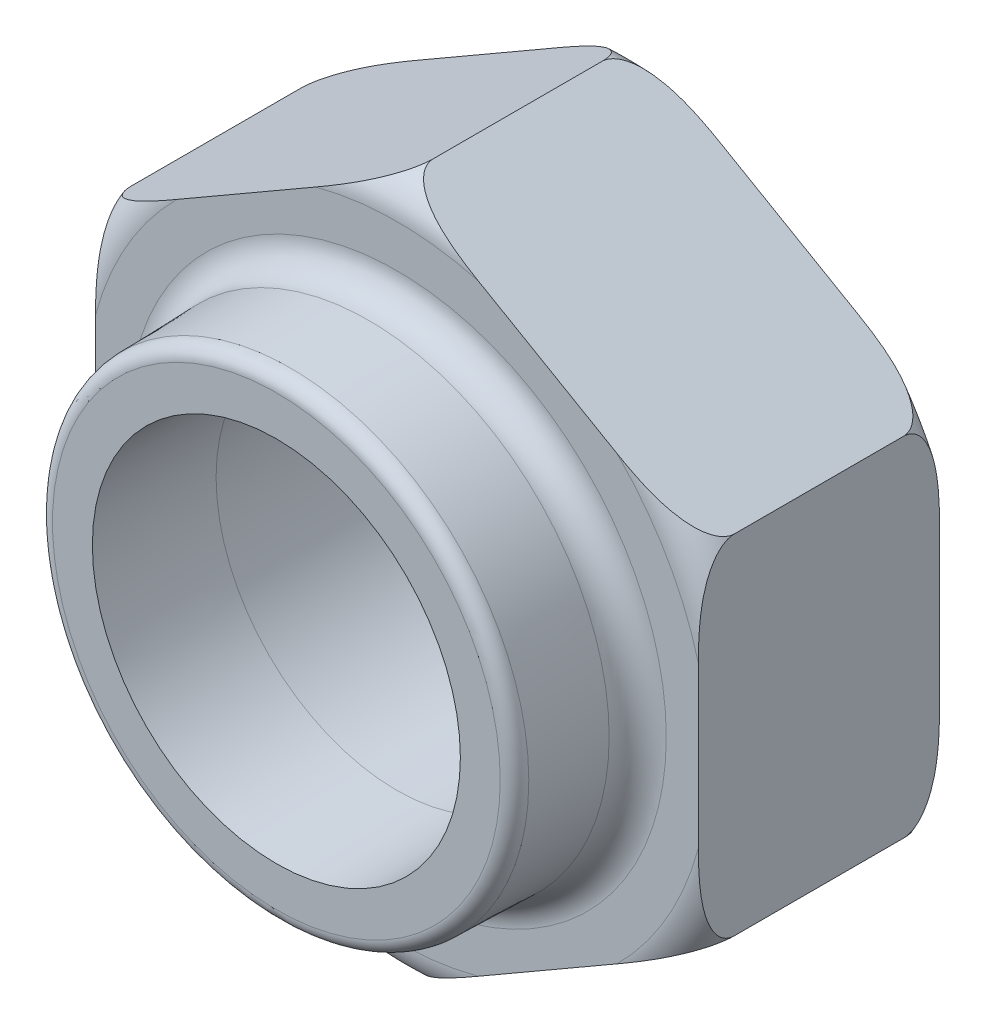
ISO-10303-21;
HEADER;
FILE_DESCRIPTION(('STEP AP214'),'2;1');
FILE_NAME('part.step','',(''),(''),'','','');
FILE_SCHEMA(('AUTOMOTIVE_DESIGN { 1 0 10303 214 1 1 1 1 }'));
ENDSEC;
DATA;
#1=APPLICATION_CONTEXT('core data for automotive mechanical design processes');
#2=APPLICATION_PROTOCOL_DEFINITION('international standard','automotive_design',2000,#1);
#3=PRODUCT_CONTEXT('',#1,'mechanical');
#4=PRODUCT('Part','Part','',(#3));
#5=PRODUCT_RELATED_PRODUCT_CATEGORY('part','',(#4));
#6=PRODUCT_DEFINITION_FORMATION('','',#4);
#7=PRODUCT_DEFINITION_CONTEXT('part definition',#1,'design');
#8=PRODUCT_DEFINITION('design','',#6,#7);
#9=PRODUCT_DEFINITION_SHAPE('','',#8);
#10=(LENGTH_UNIT() NAMED_UNIT(*) SI_UNIT(.MILLI.,.METRE.));
#11=(NAMED_UNIT(*) PLANE_ANGLE_UNIT() SI_UNIT($,.RADIAN.));
#12=(NAMED_UNIT(*) SI_UNIT($,.STERADIAN.) SOLID_ANGLE_UNIT());
#13=UNCERTAINTY_MEASURE_WITH_UNIT(LENGTH_MEASURE(1.E-05),#10,'distance_accuracy_value','');
#14=(GEOMETRIC_REPRESENTATION_CONTEXT(3) GLOBAL_UNCERTAINTY_ASSIGNED_CONTEXT((#13)) GLOBAL_UNIT_ASSIGNED_CONTEXT((#10,
#11,#12)) REPRESENTATION_CONTEXT('',''));
#15=CARTESIAN_POINT('',(0.,0.,0.));
#16=DIRECTION('',(0.,0.,1.));
#17=DIRECTION('',(1.,0.,0.));
#18=AXIS2_PLACEMENT_3D('',#15,#16,#17);
#19=CARTESIAN_POINT('',(-4.9999999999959,8.66025403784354,4.00000000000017));
#20=DIRECTION('',(0.,0.,1.));
#21=DIRECTION('',(1.00000000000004,0.,0.));
#22=AXIS2_PLACEMENT_3D('',#19,#20,#21);
#23=PLANE('',#22);
#24=CARTESIAN_POINT('',(1.64313007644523E-11,-3.21964677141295E-12,4.00000000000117));
#25=DIRECTION('',(0.,0.,1.));
#26=DIRECTION('',(1.00000000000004,0.,0.));
#27=AXIS2_PLACEMENT_3D('',#24,#25,#26);
#28=CIRCLE('',#27,4.46759529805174);
#29=CARTESIAN_POINT('',(4.46759529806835,-3.21964677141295E-12,4.00000000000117));
#30=VERTEX_POINT('',#29);
#31=EDGE_CURVE('E223',#30,#30,#28,.F.);
#32=ORIENTED_EDGE('',*,*,#31,.T.);
#33=EDGE_LOOP('',(#32));
#34=FACE_BOUND('',#33,.T.);
#35=CARTESIAN_POINT('',(1.64313007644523E-11,-3.21964677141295E-12,4.00000000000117));
#36=DIRECTION('',(0.,0.,1.));
#37=DIRECTION('',(1.00000000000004,0.,0.));
#38=AXIS2_PLACEMENT_3D('',#35,#36,#37);
#39=CIRCLE('',#38,5.17350269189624);
#40=CARTESIAN_POINT('',(5.00000000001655,-1.32858198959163,4.00000000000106));
#41=VERTEX_POINT('',#40);
#42=CARTESIAN_POINT('',(3.65058575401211,-3.66583602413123,4.00000000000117));
#43=VERTEX_POINT('',#42);
#44=EDGE_CURVE('E219',#41,#43,#39,.F.);
#45=ORIENTED_EDGE('',*,*,#44,.F.);
#46=DIRECTION('',(0.,-1.,0.));
#47=VECTOR('',#46,1.);
#48=CARTESIAN_POINT('',(5.000000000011,2.88675134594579,4.00000000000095));
#49=LINE('',#48,#47);
#50=CARTESIAN_POINT('',(5.00000000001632,1.32858198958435,4.00000000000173));
#51=VERTEX_POINT('',#50);
#52=EDGE_CURVE('E198',#51,#41,#49,.T.);
#53=ORIENTED_EDGE('',*,*,#52,.F.);
#54=CARTESIAN_POINT('',(3.65058575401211,3.66583602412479,4.00000000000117));
#55=VERTEX_POINT('',#54);
#56=EDGE_CURVE('E217',#55,#51,#39,.F.);
#57=ORIENTED_EDGE('',*,*,#56,.F.);
#58=DIRECTION('',(-0.866025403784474,0.499999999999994,0.));
#59=VECTOR('',#58,1.);
#60=CARTESIAN_POINT('',(5.000000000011,2.88675134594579,4.00000000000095));
#61=LINE('',#60,#59);
#62=CARTESIAN_POINT('',(1.34941424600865,4.9944180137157,4.00000000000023));
#63=VERTEX_POINT('',#62);
#64=EDGE_CURVE('E185',#55,#63,#61,.T.);
#65=ORIENTED_EDGE('',*,*,#64,.T.);
#66=CARTESIAN_POINT('',(-1.34941424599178,4.99441801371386,4.00000000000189));
#67=VERTEX_POINT('',#66);
#68=EDGE_CURVE('E183',#67,#63,#39,.F.);
#69=ORIENTED_EDGE('',*,*,#68,.F.);
#70=DIRECTION('',(0.866025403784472,0.499999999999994,0.));
#71=VECTOR('',#70,1.);
#72=CARTESIAN_POINT('',(-4.99999999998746,2.88675134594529,4.00000000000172));
#73=LINE('',#72,#71);
#74=CARTESIAN_POINT('',(-3.65058575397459,3.66583602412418,4.00000000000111));
#75=VERTEX_POINT('',#74);
#76=EDGE_CURVE('E176',#75,#67,#73,.T.);
#77=ORIENTED_EDGE('',*,*,#76,.F.);
#78=CARTESIAN_POINT('',(1.64313007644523E-11,-3.21964677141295E-12,4.00000000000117));
#79=DIRECTION('',(0.,0.,-1.));
#80=DIRECTION('',(-1.00000000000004,0.,0.));
#81=AXIS2_PLACEMENT_3D('',#78,#79,#80);
#82=CIRCLE('',#81,5.17350269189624);
#83=CARTESIAN_POINT('',(-4.99999999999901,1.32858198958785,4.00000000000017));
#84=VERTEX_POINT('',#83);
#85=EDGE_CURVE('E159',#84,#75,#82,.T.);
#86=ORIENTED_EDGE('',*,*,#85,.F.);
#87=DIRECTION('',(0.,-1.,0.));
#88=VECTOR('',#87,1.);
#89=CARTESIAN_POINT('',(-4.99999999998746,2.88675134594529,4.00000000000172));
#90=LINE('',#89,#88);
#91=CARTESIAN_POINT('',(-4.99999999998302,-1.32858198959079,4.00000000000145));
#92=VERTEX_POINT('',#91);
#93=EDGE_CURVE('E184',#84,#92,#90,.T.);
#94=ORIENTED_EDGE('',*,*,#93,.T.);
#95=CARTESIAN_POINT('',(-3.65058575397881,-3.66583602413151,4.000000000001));
#96=VERTEX_POINT('',#95);
#97=EDGE_CURVE('E441',#96,#92,#39,.F.);
#98=ORIENTED_EDGE('',*,*,#97,.F.);
#99=DIRECTION('',(0.866025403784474,-0.499999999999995,0.));
#100=VECTOR('',#99,1.);
#101=CARTESIAN_POINT('',(-4.9999999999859,-2.88675134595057,4.00000000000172));
#102=LINE('',#101,#100);
#103=CARTESIAN_POINT('',(-1.34941424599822,-4.99441801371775,4.00000000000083));
#104=VERTEX_POINT('',#103);
#105=EDGE_CURVE('E187',#96,#104,#102,.T.);
#106=ORIENTED_EDGE('',*,*,#105,.T.);
#107=CARTESIAN_POINT('',(1.34941424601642,-4.99441801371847,4.00000000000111));
#108=VERTEX_POINT('',#107);
#109=EDGE_CURVE('E442',#108,#104,#39,.F.);
#110=ORIENTED_EDGE('',*,*,#109,.F.);
#111=DIRECTION('',(-0.866025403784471,-0.499999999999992,0.));
#112=VECTOR('',#111,1.);
#113=CARTESIAN_POINT('',(5.00000000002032,-2.88675134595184,4.00000000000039));
#114=LINE('',#113,#112);
#115=EDGE_CURVE('E195',#43,#108,#114,.T.);
#116=ORIENTED_EDGE('',*,*,#115,.F.);
#117=EDGE_LOOP('',(#45,#53,#57,#65,#69,#77,#86,#94,#98,#106,#110,#116));
#118=FACE_BOUND('',#117,.T.);
#119=ADVANCED_FACE('F34',(#34,#118),#23,.T.);
#120=CARTESIAN_POINT('',(5.000000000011,2.88675134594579,4.00000000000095));
#121=DIRECTION('',(-0.500000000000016,-0.86602540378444,0.));
#122=DIRECTION('',(0.866025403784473,-0.499999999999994,0.));
#123=AXIS2_PLACEMENT_3D('',#120,#121,#122);
#124=PLANE('',#123);
#125=DIRECTION('',(0.,0.,-1.));
#126=VECTOR('',#125,1.);
#127=CARTESIAN_POINT('',(1.79856129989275E-11,5.77350269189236,4.00000000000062));
#128=LINE('',#127,#126);
#129=CARTESIAN_POINT('',(1.73194791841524E-11,5.77350269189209,3.40000000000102));
#130=VERTEX_POINT('',#129);
#131=CARTESIAN_POINT('',(1.15463194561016E-11,5.77350269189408,0.600000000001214));
#132=VERTEX_POINT('',#131);
#133=EDGE_CURVE('E210',#130,#132,#128,.T.);
#134=ORIENTED_EDGE('',*,*,#133,.F.);
#135=CARTESIAN_POINT('',(5.77444758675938E-08,5.77350265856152,3.3998000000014));
#136=CARTESIAN_POINT('',(-4.76242686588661E-05,5.77353018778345,3.41781357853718));
#137=CARTESIAN_POINT('',(0.00138209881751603,5.77270473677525,3.4357815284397));
#138=CARTESIAN_POINT('',(0.00687152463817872,5.76953541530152,3.47102174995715));
#139=CARTESIAN_POINT('',(0.0109085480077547,5.76720463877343,3.48829866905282));
#140=CARTESIAN_POINT('',(0.0212821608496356,5.76121543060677,3.52182780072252));
#141=CARTESIAN_POINT('',(0.0276119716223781,5.75756091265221,3.53808286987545));
#142=CARTESIAN_POINT('',(0.0421651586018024,5.74915862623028,3.56944327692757));
#143=CARTESIAN_POINT('',(0.050392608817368,5.74440850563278,3.58454604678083));
#144=CARTESIAN_POINT('',(0.0744513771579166,5.73051816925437,3.62334410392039));
#145=CARTESIAN_POINT('',(0.0916512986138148,5.72058778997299,3.64590660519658));
#146=CARTESIAN_POINT('',(0.128849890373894,5.69911117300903,3.68771991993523));
#147=CARTESIAN_POINT('',(0.148857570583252,5.68755973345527,3.70695960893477));
#148=CARTESIAN_POINT('',(0.20635067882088,5.65436607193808,3.75584901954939));
#149=CARTESIAN_POINT('',(0.245716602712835,5.63163814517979,3.78252300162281));
#150=CARTESIAN_POINT('',(0.327182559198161,5.58460375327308,3.82913872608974));
#151=CARTESIAN_POINT('',(0.369284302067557,5.56029630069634,3.84907620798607));
#152=CARTESIAN_POINT('',(0.469571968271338,5.50239518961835,3.88976964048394));
#153=CARTESIAN_POINT('',(0.528363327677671,5.46845198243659,3.90850293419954));
#154=CARTESIAN_POINT('',(0.647255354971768,5.39980963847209,3.93943741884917));
#155=CARTESIAN_POINT('',(0.707358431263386,5.36510911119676,3.95162531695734));
#156=CARTESIAN_POINT('',(0.8287439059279,5.29502717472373,3.97125967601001));
#157=CARTESIAN_POINT('',(0.890032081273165,5.25964243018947,3.97865661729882));
#158=CARTESIAN_POINT('',(1.01276635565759,5.18878176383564,3.98981440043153));
#159=CARTESIAN_POINT('',(1.07421219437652,5.15330599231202,3.99357938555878));
#160=CARTESIAN_POINT('',(1.20268971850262,5.07912945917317,3.99872548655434));
#161=CARTESIAN_POINT('',(1.26972792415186,5.04042493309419,3.99986240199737));
#162=CARTESIAN_POINT('',(1.40381044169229,4.96301235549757,4.00011392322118));
#163=CARTESIAN_POINT('',(1.47085475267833,4.92430430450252,3.99922818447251));
#164=CARTESIAN_POINT('',(1.60497218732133,4.84687156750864,3.99633036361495));
#165=CARTESIAN_POINT('',(1.67204529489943,4.80814689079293,3.99431743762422));
#166=CARTESIAN_POINT('',(1.80618291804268,4.73070249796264,3.98993094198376));
#167=CARTESIAN_POINT('',(1.8732474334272,4.69198278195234,3.98755736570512));
#168=CARTESIAN_POINT('',(2.00761510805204,4.61440556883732,3.98307558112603));
#169=CARTESIAN_POINT('',(2.07491829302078,4.5755480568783,3.98096831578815));
#170=CARTESIAN_POINT('',(2.20954050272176,4.49782388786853,3.97751116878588));
#171=CARTESIAN_POINT('',(2.2768595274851,4.45895723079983,3.97616128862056));
#172=CARTESIAN_POINT('',(2.41144797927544,4.38125255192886,3.97450758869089));
#173=CARTESIAN_POINT('',(2.47871739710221,4.34241453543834,3.97420283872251));
#174=CARTESIAN_POINT('',(2.61325297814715,4.26474038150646,3.97470024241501));
#175=CARTESIAN_POINT('',(2.6805191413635,4.22590424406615,3.97550239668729));
#176=CARTESIAN_POINT('',(2.81414037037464,4.14875799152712,3.97802845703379));
#177=CARTESIAN_POINT('',(2.88049562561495,4.11044776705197,3.97973993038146));
#178=CARTESIAN_POINT('',(3.01319524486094,4.03383360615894,3.98371281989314));
#179=CARTESIAN_POINT('',(3.07953960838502,3.9955296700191,3.9859742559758));
#180=CARTESIAN_POINT('',(3.21222267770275,3.91892506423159,3.99051514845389));
#181=CARTESIAN_POINT('',(3.27856138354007,3.88062439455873,3.99279460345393));
#182=CARTESIAN_POINT('',(3.41125271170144,3.80401502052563,3.99670254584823));
#183=CARTESIAN_POINT('',(3.47760533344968,3.76570631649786,3.99833105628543));
#184=CARTESIAN_POINT('',(3.60988230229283,3.68933617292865,4.00013783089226));
#185=CARTESIAN_POINT('',(3.67580652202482,3.65127480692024,4.00032579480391));
#186=CARTESIAN_POINT('',(3.8076606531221,3.57514878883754,3.99836467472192));
#187=CARTESIAN_POINT('',(3.87359055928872,3.5370841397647,3.99621482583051));
#188=CARTESIAN_POINT('',(4.00510848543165,3.46115222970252,3.98848989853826));
#189=CARTESIAN_POINT('',(4.07069693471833,3.42328472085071,3.98292529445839));
#190=CARTESIAN_POINT('',(4.20142655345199,3.3478079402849,3.9670167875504));
#191=CARTESIAN_POINT('',(4.26656807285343,3.31019846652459,3.95667719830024));
#192=CARTESIAN_POINT('',(4.35167201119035,3.26106368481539,3.9386828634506));
#193=CARTESIAN_POINT('',(4.3721132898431,3.24926190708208,3.93401523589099));
#194=CARTESIAN_POINT('',(4.41286985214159,3.22573109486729,3.92392642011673));
#195=CARTESIAN_POINT('',(4.43318505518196,3.21400210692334,3.91850479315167));
#196=CARTESIAN_POINT('',(4.49401503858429,3.17888189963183,3.90094272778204));
#197=CARTESIAN_POINT('',(4.53425652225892,3.15564846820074,3.88753701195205));
#198=CARTESIAN_POINT('',(4.62666603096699,3.10229581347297,3.85138693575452));
#199=CARTESIAN_POINT('',(4.67840052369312,3.07242689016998,3.82702115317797));
#200=CARTESIAN_POINT('',(4.75241620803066,3.02969391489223,3.78278864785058));
#201=CARTESIAN_POINT('',(4.77643535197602,3.01582645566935,3.76681281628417));
#202=CARTESIAN_POINT('',(4.82272024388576,2.98910386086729,3.73180595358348));
#203=CARTESIAN_POINT('',(4.84498968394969,2.97624659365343,3.71278162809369));
#204=CARTESIAN_POINT('',(4.8807773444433,2.95558457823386,3.67720505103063));
#205=CARTESIAN_POINT('',(4.89495619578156,2.94739841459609,3.66154478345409));
#206=CARTESIAN_POINT('',(4.92149057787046,2.93207878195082,3.62823531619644));
#207=CARTESIAN_POINT('',(4.93384523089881,2.92494581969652,3.61058516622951));
#208=CARTESIAN_POINT('',(4.95618931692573,2.91204545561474,3.57300947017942));
#209=CARTESIAN_POINT('',(4.96614559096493,2.90629719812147,3.55305710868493));
#210=CARTESIAN_POINT('',(4.98257637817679,2.89681087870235,3.51134649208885));
#211=CARTESIAN_POINT('',(4.98906427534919,2.89306508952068,3.48959555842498));
#212=CARTESIAN_POINT('',(4.99560029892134,2.88929151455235,3.45625741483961));
#213=CARTESIAN_POINT('',(4.99724605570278,2.88834133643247,3.44507092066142));
#214=CARTESIAN_POINT('',(4.99945280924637,2.88706726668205,3.4225266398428));
#215=CARTESIAN_POINT('',(5.00001090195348,2.88674505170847,3.41116847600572));
#216=CARTESIAN_POINT('',(4.99999994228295,2.88675137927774,3.39980000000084));
#217=B_SPLINE_CURVE_WITH_KNOTS('',3,(#135,#136,#137,#138,#139,#140,#141,#142,#143,#144,#145,
#146,#147,#148,#149,#150,#151,#152,#153,#154,#155,#156,#157,#158,#159,#160,#161,#162,#163,#164,
#165,#166,#167,#168,#169,#170,#171,#172,#173,#174,#175,#176,#177,#178,#179,#180,#181,#182,#183,
#184,#185,#186,#187,#188,#189,#190,#191,#192,#193,#194,#195,#196,#197,#198,#199,#200,#201,#202,
#203,#204,#205,#206,#207,#208,#209,#210,#211,#212,#213,#214,#215,#216),.UNSPECIFIED.,.F.,.F.,(4,
2,2,2,2,2,2,2,2,2,2,2,2,2,2,2,2,2,2,2,2,2,2,2,2,2,2,2,2,2,2,2,2,2,2,2,2,2,2,2,4),(0.,
0.0538898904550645,0.107317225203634,0.160587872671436,0.213973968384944,0.303627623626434,
0.393575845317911,0.550794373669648,0.708112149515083,0.918870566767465,1.1300554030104,
1.34338962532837,1.55648019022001,1.78869012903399,2.02093962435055,2.25336322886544,
2.48579110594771,2.71902019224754,2.95224974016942,3.18527165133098,3.41829369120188,
3.64820874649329,3.87813213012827,4.10803787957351,4.33793548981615,4.5662837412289,
4.7947067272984,5.02243253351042,5.24995302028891,5.32212552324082,5.39434020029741,
5.53932264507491,5.73202011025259,5.82789523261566,5.92356228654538,5.99138623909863,
6.05924271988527,6.12798949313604,6.19646903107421,6.23044567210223,6.26451290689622),.UNSPECIFIED.);
#218=EDGE_CURVE('E382',#130,#63,#217,.T.);
#219=ORIENTED_EDGE('',*,*,#218,.T.);
#220=ORIENTED_EDGE('',*,*,#64,.F.);
#221=CARTESIAN_POINT('',(5.00000000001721,2.88675134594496,3.40000000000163));
#222=VERTEX_POINT('',#221);
#223=EDGE_CURVE('E297',#55,#222,#217,.T.);
#224=ORIENTED_EDGE('',*,*,#223,.T.);
#225=DIRECTION('',(0.,0.,-1.));
#226=VECTOR('',#225,1.);
#227=CARTESIAN_POINT('',(5.000000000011,2.88675134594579,4.00000000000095));
#228=LINE('',#227,#226);
#229=CARTESIAN_POINT('',(5.000000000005,2.88675134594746,0.600000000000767));
#230=VERTEX_POINT('',#229);
#231=EDGE_CURVE('E201',#222,#230,#228,.T.);
#232=ORIENTED_EDGE('',*,*,#231,.T.);
#233=CARTESIAN_POINT('',(4.99999994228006,2.88675137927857,0.600200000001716));
#234=CARTESIAN_POINT('',(5.00004762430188,2.88672385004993,0.582186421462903));
#235=CARTESIAN_POINT('',(4.99861790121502,2.88754930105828,0.564218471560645));
#236=CARTESIAN_POINT('',(4.99312847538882,2.89071862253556,0.528978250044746));
#237=CARTESIAN_POINT('',(4.98909145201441,2.89304939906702,0.511701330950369));
#238=CARTESIAN_POINT('',(4.97871783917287,2.8990386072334,0.478172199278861));
#239=CARTESIAN_POINT('',(4.97238802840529,2.90269312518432,0.461917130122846));
#240=CARTESIAN_POINT('',(4.95783484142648,2.91109541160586,0.430556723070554));
#241=CARTESIAN_POINT('',(4.94960739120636,2.91584553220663,0.415453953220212));
#242=CARTESIAN_POINT('',(4.92554862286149,2.92973586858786,0.376655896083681));
#243=CARTESIAN_POINT('',(4.90834870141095,2.93966624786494,0.354093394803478));
#244=CARTESIAN_POINT('',(4.87115010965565,2.96114286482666,0.312280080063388));
#245=CARTESIAN_POINT('',(4.85114242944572,2.97269430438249,0.293040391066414));
#246=CARTESIAN_POINT('',(4.79364932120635,3.00588796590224,0.244150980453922));
#247=CARTESIAN_POINT('',(4.75428339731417,3.02861589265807,0.217476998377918));
#248=CARTESIAN_POINT('',(4.67281744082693,3.07565028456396,0.170861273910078));
#249=CARTESIAN_POINT('',(4.63071569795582,3.09995773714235,0.150923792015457));
#250=CARTESIAN_POINT('',(4.53042803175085,3.15785884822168,0.110230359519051));
#251=CARTESIAN_POINT('',(4.47163667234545,3.19180205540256,0.0914970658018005));
#252=CARTESIAN_POINT('',(4.35274464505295,3.26044439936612,0.0605625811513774));
#253=CARTESIAN_POINT('',(4.292641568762,3.2951449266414,0.0483746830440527));
#254=CARTESIAN_POINT('',(4.17125609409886,3.36522686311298,0.0287403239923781));
#255=CARTESIAN_POINT('',(4.10996791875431,3.40061160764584,0.0213433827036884));
#256=CARTESIAN_POINT('',(3.98723364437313,3.47147227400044,0.0101855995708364));
#257=CARTESIAN_POINT('',(3.92578780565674,3.50694804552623,0.00642061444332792));
#258=CARTESIAN_POINT('',(3.79731028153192,3.58112457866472,0.00127451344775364));
#259=CARTESIAN_POINT('',(3.73027207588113,3.61982910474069,0.000137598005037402));
#260=CARTESIAN_POINT('',(3.59618955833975,3.69724168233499,-0.000113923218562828));
#261=CARTESIAN_POINT('',(3.52914524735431,3.73594973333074,0.000771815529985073));
#262=CARTESIAN_POINT('',(3.39502781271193,3.81338247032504,0.00366963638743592));
#263=CARTESIAN_POINT('',(3.32795470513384,3.85210714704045,0.00568256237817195));
#264=CARTESIAN_POINT('',(3.19381708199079,3.92955153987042,0.0100690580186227));
#265=CARTESIAN_POINT('',(3.12675256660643,3.9682712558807,0.0124426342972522));
#266=CARTESIAN_POINT('',(2.99238489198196,4.04584846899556,0.0169244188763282));
#267=CARTESIAN_POINT('',(2.92508170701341,4.08470598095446,0.0190316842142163));
#268=CARTESIAN_POINT('',(2.79045949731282,4.16243014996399,0.0224888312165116));
#269=CARTESIAN_POINT('',(2.72314047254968,4.20129680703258,0.0238387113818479));
#270=CARTESIAN_POINT('',(2.58855202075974,4.27900148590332,0.0254924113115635));
#271=CARTESIAN_POINT('',(2.52128260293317,4.31783950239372,0.0257971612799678));
#272=CARTESIAN_POINT('',(2.38674702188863,4.39551365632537,0.0252997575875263));
#273=CARTESIAN_POINT('',(2.31948085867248,4.43434979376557,0.0244976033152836));
#274=CARTESIAN_POINT('',(2.18585962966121,4.51149604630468,0.0219715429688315));
#275=CARTESIAN_POINT('',(2.11950437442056,4.54980627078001,0.0202600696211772));
#276=CARTESIAN_POINT('',(1.98680475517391,4.62642043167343,0.016287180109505));
#277=CARTESIAN_POINT('',(1.92046039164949,4.66472436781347,0.0140257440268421));
#278=CARTESIAN_POINT('',(1.7877773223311,4.74132897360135,0.00948485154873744));
#279=CARTESIAN_POINT('',(1.72143861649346,4.7796296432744,0.0072053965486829));
#280=CARTESIAN_POINT('',(1.58874728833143,4.85623901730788,0.0032974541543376));
#281=CARTESIAN_POINT('',(1.52239466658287,4.89454772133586,0.00166894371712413));
#282=CARTESIAN_POINT('',(1.39011769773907,4.9709178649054,-0.000137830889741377));
#283=CARTESIAN_POINT('',(1.32419347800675,5.00897923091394,-0.000325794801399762));
#284=CARTESIAN_POINT('',(1.19233934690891,5.08510524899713,0.00163532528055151));
#285=CARTESIAN_POINT('',(1.12640944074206,5.12316989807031,0.0037851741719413));
#286=CARTESIAN_POINT('',(0.99489151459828,5.19910180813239,0.0115101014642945));
#287=CARTESIAN_POINT('',(0.929303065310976,5.23696931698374,0.0170747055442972));
#288=CARTESIAN_POINT('',(0.798573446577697,5.31244609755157,0.032983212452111));
#289=CARTESIAN_POINT('',(0.733431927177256,5.35005557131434,0.0433228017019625));
#290=CARTESIAN_POINT('',(0.648327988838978,5.39919035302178,0.0613171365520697));
#291=CARTESIAN_POINT('',(0.627886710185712,5.41099213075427,0.065984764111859));
#292=CARTESIAN_POINT('',(0.587130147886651,5.43452294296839,0.0760735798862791));
#293=CARTESIAN_POINT('',(0.566814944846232,5.44625193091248,0.0814952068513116));
#294=CARTESIAN_POINT('',(0.505984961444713,5.48137213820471,0.0990572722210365));
#295=CARTESIAN_POINT('',(0.465743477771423,5.50460556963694,0.112462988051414));
#296=CARTESIAN_POINT('',(0.373333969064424,5.55795822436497,0.148613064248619));
#297=CARTESIAN_POINT('',(0.321599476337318,5.58782714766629,0.172978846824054));
#298=CARTESIAN_POINT('',(0.24758379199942,5.63056012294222,0.217211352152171));
#299=CARTESIAN_POINT('',(0.223564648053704,5.64442758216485,0.233187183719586));
#300=CARTESIAN_POINT('',(0.17727975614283,5.67115017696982,0.268194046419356));
#301=CARTESIAN_POINT('',(0.155010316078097,5.68400744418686,0.287218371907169));
#302=CARTESIAN_POINT('',(0.119222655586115,5.70466945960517,0.322794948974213));
#303=CARTESIAN_POINT('',(0.105043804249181,5.71285562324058,0.338455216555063));
#304=CARTESIAN_POINT('',(0.0785094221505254,5.72817525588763,0.371764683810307));
#305=CARTESIAN_POINT('',(0.0661547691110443,5.7353082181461,0.389414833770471));
#306=CARTESIAN_POINT('',(0.0438106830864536,5.7482085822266,0.426990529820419));
#307=CARTESIAN_POINT('',(0.0338544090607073,5.75395683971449,0.446942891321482));
#308=CARTESIAN_POINT('',(0.0174236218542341,5.76344315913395,0.488653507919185));
#309=CARTESIAN_POINT('',(0.0109357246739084,5.76718894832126,0.510404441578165));
#310=CARTESIAN_POINT('',(0.00439970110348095,5.7709625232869,0.543742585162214));
#311=CARTESIAN_POINT('',(0.00275394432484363,5.77191270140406,0.554929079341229));
#312=CARTESIAN_POINT('',(0.000547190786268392,5.77318677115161,0.577473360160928));
#313=CARTESIAN_POINT('',(-1.09019186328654E-05,5.77350898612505,0.588831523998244));
#314=CARTESIAN_POINT('',(5.77511372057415E-08,5.77350265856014,0.600200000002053));
#315=B_SPLINE_CURVE_WITH_KNOTS('',3,(#233,#234,#235,#236,#237,#238,#239,#240,#241,#242,#243,
#244,#245,#246,#247,#248,#249,#250,#251,#252,#253,#254,#255,#256,#257,#258,#259,#260,#261,#262,
#263,#264,#265,#266,#267,#268,#269,#270,#271,#272,#273,#274,#275,#276,#277,#278,#279,#280,#281,
#282,#283,#284,#285,#286,#287,#288,#289,#290,#291,#292,#293,#294,#295,#296,#297,#298,#299,#300,
#301,#302,#303,#304,#305,#306,#307,#308,#309,#310,#311,#312,#313,#314),.UNSPECIFIED.,.F.,.F.,(4,
2,2,2,2,2,2,2,2,2,2,2,2,2,2,2,2,2,2,2,2,2,2,2,2,2,2,2,2,2,2,2,2,2,2,2,2,2,2,2,4),(0.,
0.0538898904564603,0.107317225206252,0.160587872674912,0.213973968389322,0.303627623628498,
0.393575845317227,0.550794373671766,0.708112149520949,0.918870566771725,1.13005540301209,
1.34338962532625,1.55648019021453,1.78869012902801,2.02093962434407,2.25336322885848,
2.48579110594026,2.71902019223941,2.9522497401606,3.18527165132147,3.41829369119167,
3.64820874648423,3.87813213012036,4.10803787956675,4.33793548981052,4.56628374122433,
4.79470672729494,5.02243253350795,5.24995302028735,5.32212552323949,5.39434020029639,
5.53932264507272,5.73202011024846,5.82789523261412,5.92356228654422,5.99138623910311,
6.05924271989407,6.12798949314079,6.19646903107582,6.23044567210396,6.26451290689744),.UNSPECIFIED.);
#316=CARTESIAN_POINT('',(3.65058575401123,3.66583602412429,6.69603261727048E-13));
#317=VERTEX_POINT('',#316);
#318=EDGE_CURVE('E375',#230,#317,#315,.T.);
#319=ORIENTED_EDGE('',*,*,#318,.T.);
#320=DIRECTION('',(-0.866025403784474,0.499999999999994,0.));
#321=VECTOR('',#320,1.);
#322=CARTESIAN_POINT('',(5.00000000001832,2.88675134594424,1.27675647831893E-12));
#323=LINE('',#322,#321);
#324=CARTESIAN_POINT('',(1.34941424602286,4.99441801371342,5.03069808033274E-13));
#325=VERTEX_POINT('',#324);
#326=EDGE_CURVE('E344',#317,#325,#323,.T.);
#327=ORIENTED_EDGE('',*,*,#326,.T.);
#328=EDGE_CURVE('E348',#325,#132,#315,.T.);
#329=ORIENTED_EDGE('',*,*,#328,.T.);
#330=EDGE_LOOP('',(#134,#219,#220,#224,#232,#319,#327,#329));
#331=FACE_BOUND('',#330,.T.);
#332=ADVANCED_FACE('F36',(#331),#124,.F.);
#333=CARTESIAN_POINT('',(-4.99999999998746,2.88675134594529,4.00000000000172));
#334=DIRECTION('',(-0.5,0.866025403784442,0.));
#335=DIRECTION('',(-0.866025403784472,-0.499999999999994,0.));
#336=AXIS2_PLACEMENT_3D('',#333,#334,#335);
#337=PLANE('',#336);
#338=CARTESIAN_POINT('',(-5.77344838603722E-08,5.77350265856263,3.39980000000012));
#339=CARTESIAN_POINT('',(4.76242864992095E-05,5.77353018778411,3.41781357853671));
#340=CARTESIAN_POINT('',(-0.00138209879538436,5.77270473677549,3.43578152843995));
#341=CARTESIAN_POINT('',(-0.00687152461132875,5.76953541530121,3.47102174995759));
#342=CARTESIAN_POINT('',(-0.0109085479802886,5.76720463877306,3.48829866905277));
#343=CARTESIAN_POINT('',(-0.0212821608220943,5.76121543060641,3.52182780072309));
#344=CARTESIAN_POINT('',(-0.0276119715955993,5.75756091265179,3.53808286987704));
#345=CARTESIAN_POINT('',(-0.0421651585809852,5.74915862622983,3.56944327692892));
#346=CARTESIAN_POINT('',(-0.0503926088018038,5.74440850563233,3.5845460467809));
#347=CARTESIAN_POINT('',(-0.0744513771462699,5.73051816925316,3.62334410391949));
#348=CARTESIAN_POINT('',(-0.091651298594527,5.72058778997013,3.64590660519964));
#349=CARTESIAN_POINT('',(-0.128849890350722,5.69911117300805,3.68771991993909));
#350=CARTESIAN_POINT('',(-0.148857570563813,5.68755973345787,3.70695960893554));
#351=CARTESIAN_POINT('',(-0.20635067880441,5.65436607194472,3.75584901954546));
#352=CARTESIAN_POINT('',(-0.245716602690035,5.63163814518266,3.78252300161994));
#353=CARTESIAN_POINT('',(-0.327182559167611,5.58460375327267,3.82913872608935));
#354=CARTESIAN_POINT('',(-0.369284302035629,5.5602963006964,3.84907620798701));
#355=CARTESIAN_POINT('',(-0.469571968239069,5.50239518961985,3.88976964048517));
#356=CARTESIAN_POINT('',(-0.528363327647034,5.46845198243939,3.90850293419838));
#357=CARTESIAN_POINT('',(-0.647255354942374,5.39980963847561,3.93943741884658));
#358=CARTESIAN_POINT('',(-0.7073584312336,5.36510911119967,3.95162531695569));
#359=CARTESIAN_POINT('',(-0.828743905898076,5.29502717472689,3.97125967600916));
#360=CARTESIAN_POINT('',(-0.890032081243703,5.2596424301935,3.97865661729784));
#361=CARTESIAN_POINT('',(-1.01276635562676,5.18878176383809,3.98981440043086));
#362=CARTESIAN_POINT('',(-1.07421219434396,5.15330599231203,3.99357938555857));
#363=CARTESIAN_POINT('',(-1.20268971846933,5.07912945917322,3.99872548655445));
#364=CARTESIAN_POINT('',(-1.26972792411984,5.04042493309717,3.99986240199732));
#365=CARTESIAN_POINT('',(-1.40381044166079,4.96301235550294,4.00011392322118));
#366=CARTESIAN_POINT('',(-1.47085475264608,4.92430430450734,3.99922818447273));
#367=CARTESIAN_POINT('',(-1.60497218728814,4.84687156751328,3.99633036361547));
#368=CARTESIAN_POINT('',(-1.67204529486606,4.80814689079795,3.99431743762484));
#369=CARTESIAN_POINT('',(-1.80618291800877,4.73070249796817,3.98993094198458));
#370=CARTESIAN_POINT('',(-1.87324743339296,4.69198278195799,3.98755736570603));
#371=CARTESIAN_POINT('',(-2.00761510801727,4.61440556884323,3.98307558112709));
#372=CARTESIAN_POINT('',(-2.07491829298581,4.57554805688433,3.98096831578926));
#373=CARTESIAN_POINT('',(-2.2095405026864,4.49782388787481,3.97751116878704));
#374=CARTESIAN_POINT('',(-2.27685952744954,4.45895723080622,3.97616128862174));
#375=CARTESIAN_POINT('',(-2.41144797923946,4.38125255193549,3.97450758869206));
#376=CARTESIAN_POINT('',(-2.47871739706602,4.3424145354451,3.97420283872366));
#377=CARTESIAN_POINT('',(-2.61325297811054,4.26474038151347,3.97470024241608));
#378=CARTESIAN_POINT('',(-2.68051914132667,4.22590424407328,3.9755023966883));
#379=CARTESIAN_POINT('',(-2.81414037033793,4.14875799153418,3.97802845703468));
#380=CARTESIAN_POINT('',(-2.88049562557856,4.11044776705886,3.97973993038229));
#381=CARTESIAN_POINT('',(-3.01319524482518,4.03383360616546,3.98371281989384));
#382=CARTESIAN_POINT('',(-3.07953960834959,3.99552967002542,3.98597425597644));
#383=CARTESIAN_POINT('',(-3.21222267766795,3.91892506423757,3.9905151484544));
#384=CARTESIAN_POINT('',(-3.27856138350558,3.88062439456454,3.99279460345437));
#385=CARTESIAN_POINT('',(-3.41125271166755,3.80401502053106,3.99670254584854));
#386=CARTESIAN_POINT('',(-3.47760533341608,3.76570631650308,3.99833105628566));
#387=CARTESIAN_POINT('',(-3.60988230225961,3.68933617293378,4.0001378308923));
#388=CARTESIAN_POINT('',(-3.6758065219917,3.65127480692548,4.00032579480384));
#389=CARTESIAN_POINT('',(-3.80766065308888,3.57514878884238,3.99836467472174));
#390=CARTESIAN_POINT('',(-3.87359055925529,3.53708413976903,3.99621482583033));
#391=CARTESIAN_POINT('',(-4.00510848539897,3.46115222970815,3.98848989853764));
#392=CARTESIAN_POINT('',(-4.07069693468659,3.42328472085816,3.98292529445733));
#393=CARTESIAN_POINT('',(-4.20142655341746,3.3478079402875,3.9670167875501));
#394=CARTESIAN_POINT('',(-4.26656807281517,3.31019846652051,3.95667719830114));
#395=CARTESIAN_POINT('',(-4.351672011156,3.26106368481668,3.9386828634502));
#396=CARTESIAN_POINT('',(-4.37211328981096,3.2492619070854,3.9340152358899));
#397=CARTESIAN_POINT('',(-4.4128698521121,3.22573109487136,3.92392642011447));
#398=CARTESIAN_POINT('',(-4.4331850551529,3.21400210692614,3.91850479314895));
#399=CARTESIAN_POINT('',(-4.49401503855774,3.17888189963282,3.90094272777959));
#400=CARTESIAN_POINT('',(-4.53425652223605,3.15564846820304,3.88753701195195));
#401=CARTESIAN_POINT('',(-4.62666603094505,3.1022958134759,3.851386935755));
#402=CARTESIAN_POINT('',(-4.67840052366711,3.07242689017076,3.82702115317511));
#403=CARTESIAN_POINT('',(-4.75241620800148,3.02969391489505,3.78278864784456));
#404=CARTESIAN_POINT('',(-4.77643535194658,3.01582645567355,3.76681281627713));
#405=CARTESIAN_POINT('',(-4.8227202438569,2.98910386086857,3.73180595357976));
#406=CARTESIAN_POINT('',(-4.84498968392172,2.97624659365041,3.7127816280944));
#407=CARTESIAN_POINT('',(-4.88077734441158,2.95558457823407,3.6772050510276));
#408=CARTESIAN_POINT('',(-4.89495619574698,2.94739841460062,3.66154478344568));
#409=CARTESIAN_POINT('',(-4.92149057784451,2.93207878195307,3.6282353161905));
#410=CARTESIAN_POINT('',(-4.93384523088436,2.92494581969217,3.61058516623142));
#411=CARTESIAN_POINT('',(-4.95618931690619,2.91204545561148,3.57300947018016));
#412=CARTESIAN_POINT('',(-4.96614559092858,2.90629719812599,3.55305710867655));
#413=CARTESIAN_POINT('',(-4.98257637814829,2.89681087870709,3.51134649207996));
#414=CARTESIAN_POINT('',(-4.98906427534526,2.8930650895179,3.4895955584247));
#415=CARTESIAN_POINT('',(-4.99560029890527,2.88929151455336,3.45625741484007));
#416=CARTESIAN_POINT('',(-4.99724605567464,2.88834133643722,3.44507092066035));
#417=CARTESIAN_POINT('',(-4.99945280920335,2.88706726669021,3.42252663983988));
#418=CARTESIAN_POINT('',(-5.00001090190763,2.88674505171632,3.4111684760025));
#419=CARTESIAN_POINT('',(-4.99999994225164,2.88675137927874,3.39980000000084));
#420=B_SPLINE_CURVE_WITH_KNOTS('',3,(#338,#339,#340,#341,#342,#343,#344,#345,#346,#347,#348,
#349,#350,#351,#352,#353,#354,#355,#356,#357,#358,#359,#360,#361,#362,#363,#364,#365,#366,#367,
#368,#369,#370,#371,#372,#373,#374,#375,#376,#377,#378,#379,#380,#381,#382,#383,#384,#385,#386,
#387,#388,#389,#390,#391,#392,#393,#394,#395,#396,#397,#398,#399,#400,#401,#402,#403,#404,#405,
#406,#407,#408,#409,#410,#411,#412,#413,#414,#415,#416,#417,#418,#419),.UNSPECIFIED.,.F.,.F.,(4,
2,2,2,2,2,2,2,2,2,2,2,2,2,2,2,2,2,2,2,2,2,2,2,2,2,2,2,2,2,2,2,2,2,2,2,2,2,2,2,4),(0.,
0.0538898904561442,0.107317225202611,0.16058787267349,0.213973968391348,0.303627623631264,
0.393575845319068,0.55079437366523,0.708112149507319,0.918870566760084,1.13005540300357,
1.34338962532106,1.55648019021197,1.78869012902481,2.02093962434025,2.25336322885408,
2.48579110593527,2.71902019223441,2.95224974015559,3.18527165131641,3.41829369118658,
3.64820874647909,3.87813213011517,4.10803787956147,4.33793548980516,4.56628374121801,
4.79470672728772,5.02243253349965,5.24995302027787,5.32212552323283,5.39434020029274,
5.53932264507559,5.73202011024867,5.82789523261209,5.92356228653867,5.99138623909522,
6.05924271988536,6.12798949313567,6.19646903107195,6.23044567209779,6.26451290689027),.UNSPECIFIED.);
#421=EDGE_CURVE('E179',#130,#67,#420,.T.);
#422=ORIENTED_EDGE('',*,*,#421,.F.);
#423=ORIENTED_EDGE('',*,*,#133,.T.);
#424=CARTESIAN_POINT('',(-4.99999994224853,2.88675137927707,0.600200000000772));
#425=CARTESIAN_POINT('',(-5.00004762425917,2.88672385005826,0.582186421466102));
#426=CARTESIAN_POINT('',(-4.99861790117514,2.88754930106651,0.564218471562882));
#427=CARTESIAN_POINT('',(-4.99312847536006,2.89071862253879,0.528978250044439));
#428=CARTESIAN_POINT('',(-4.98909145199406,2.89304939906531,0.511701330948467));
#429=CARTESIAN_POINT('',(-4.97871783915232,2.89903860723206,0.47817219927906));
#430=CARTESIAN_POINT('',(-4.97238802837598,2.90269312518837,0.461917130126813));
#431=CARTESIAN_POINT('',(-4.95783484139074,2.9110954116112,0.430556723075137));
#432=CARTESIAN_POINT('',(-4.94960739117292,2.91584553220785,0.415453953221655));
#433=CARTESIAN_POINT('',(-4.92554862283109,2.92973586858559,0.376655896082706));
#434=CARTESIAN_POINT('',(-4.90834870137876,2.93966624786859,0.354093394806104));
#435=CARTESIAN_POINT('',(-4.87115010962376,2.96114286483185,0.312280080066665));
#436=CARTESIAN_POINT('',(-4.85114242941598,2.97269430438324,0.293040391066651));
#437=CARTESIAN_POINT('',(-4.79364932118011,3.00588796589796,0.244150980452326));
#438=CARTESIAN_POINT('',(-4.75428339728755,3.02861589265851,0.217476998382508));
#439=CARTESIAN_POINT('',(-4.67281744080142,3.07565028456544,0.170861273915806));
#440=CARTESIAN_POINT('',(-4.63071569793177,3.09995773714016,0.150923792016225));
#441=CARTESIAN_POINT('',(-4.530428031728,3.15785884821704,0.110230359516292));
#442=CARTESIAN_POINT('',(-4.4716366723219,3.19180205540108,0.0914970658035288));
#443=CARTESIAN_POINT('',(-4.35274464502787,3.26044439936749,0.0605625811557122));
#444=CARTESIAN_POINT('',(-4.29264156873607,3.29514492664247,0.0483746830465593));
#445=CARTESIAN_POINT('',(-4.17125609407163,3.36522686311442,0.0287403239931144));
#446=CARTESIAN_POINT('',(-4.10996791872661,3.40061160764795,0.0213433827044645));
#447=CARTESIAN_POINT('',(-3.98723364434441,3.47147227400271,0.0101855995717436));
#448=CARTESIAN_POINT('',(-3.92578780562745,3.50694804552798,0.00642061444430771));
#449=CARTESIAN_POINT('',(-3.79731028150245,3.58112457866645,0.00127451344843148));
#450=CARTESIAN_POINT('',(-3.7302720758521,3.61982910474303,0.000137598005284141));
#451=CARTESIAN_POINT('',(-3.59618955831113,3.69724168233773,-0.000113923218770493));
#452=CARTESIAN_POINT('',(-3.52914524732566,3.73594973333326,0.000771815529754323));
#453=CARTESIAN_POINT('',(-3.39502781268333,3.81338247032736,0.00366963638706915));
#454=CARTESIAN_POINT('',(-3.32795470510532,3.85210714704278,0.00568256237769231));
#455=CARTESIAN_POINT('',(-3.19381708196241,3.92955153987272,0.0100690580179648));
#456=CARTESIAN_POINT('',(-3.1267525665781,3.96827125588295,0.0124426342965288));
#457=CARTESIAN_POINT('',(-2.99238489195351,4.04584846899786,0.0169244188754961));
#458=CARTESIAN_POINT('',(-2.9250817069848,4.08470598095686,0.01903168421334));
#459=CARTESIAN_POINT('',(-2.79045949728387,4.16243014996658,0.0224888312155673));
#460=CARTESIAN_POINT('',(-2.72314047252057,4.20129680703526,0.0238387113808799));
#461=CARTESIAN_POINT('',(-2.58855202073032,4.27900148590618,0.0254924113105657));
#462=CARTESIAN_POINT('',(-2.52128260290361,4.31783950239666,0.0257971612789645));
#463=CARTESIAN_POINT('',(-2.38674702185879,4.39551365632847,0.0252997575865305));
#464=CARTESIAN_POINT('',(-2.3194808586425,4.43434979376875,0.0244976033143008));
#465=CARTESIAN_POINT('',(-2.18585962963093,4.51149604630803,0.0219715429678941));
#466=CARTESIAN_POINT('',(-2.11950437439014,4.54980627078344,0.0202600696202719));
#467=CARTESIAN_POINT('',(-1.9868047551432,4.62642043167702,0.0162871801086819));
#468=CARTESIAN_POINT('',(-1.92046039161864,4.66472436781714,0.014025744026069));
#469=CARTESIAN_POINT('',(-1.78777732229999,4.74132897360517,0.00948485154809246));
#470=CARTESIAN_POINT('',(-1.72143861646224,4.77962964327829,0.00720539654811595));
#471=CARTESIAN_POINT('',(-1.58874728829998,4.85623901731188,0.0032974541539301));
#472=CARTESIAN_POINT('',(-1.5223946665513,4.8945477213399,0.001668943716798));
#473=CARTESIAN_POINT('',(-1.39011769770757,4.97091786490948,-0.000137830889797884));
#474=CARTESIAN_POINT('',(-1.32419347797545,5.00897923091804,-0.000325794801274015));
#475=CARTESIAN_POINT('',(-1.19233934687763,5.08510524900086,0.00163532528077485));
#476=CARTESIAN_POINT('',(-1.1264094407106,5.12316989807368,0.00378517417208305));
#477=CARTESIAN_POINT('',(-0.994891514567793,5.19910180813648,0.0115101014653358));
#478=CARTESIAN_POINT('',(-0.929303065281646,5.23696931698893,0.0170747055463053));
#479=CARTESIAN_POINT('',(-0.798573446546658,5.31244609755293,0.0329832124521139));
#480=CARTESIAN_POINT('',(-0.733431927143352,5.3500555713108,0.0433228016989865));
#481=CARTESIAN_POINT('',(-0.648327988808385,5.39919035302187,0.0613171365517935));
#482=CARTESIAN_POINT('',(-0.627886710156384,5.41099213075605,0.0659847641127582));
#483=CARTESIAN_POINT('',(-0.587130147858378,5.43452294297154,0.0760735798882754));
#484=CARTESIAN_POINT('',(-0.566814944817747,5.44625193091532,0.0814952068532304));
#485=CARTESIAN_POINT('',(-0.505984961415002,5.48137213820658,0.0990572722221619));
#486=CARTESIAN_POINT('',(-0.465743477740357,5.50460556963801,0.112462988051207));
#487=CARTESIAN_POINT('',(-0.37333396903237,5.55795822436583,0.14861306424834));
#488=CARTESIAN_POINT('',(-0.321599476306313,5.58782714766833,0.172978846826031));
#489=CARTESIAN_POINT('',(-0.247583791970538,5.63056012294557,0.217211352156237));
#490=CARTESIAN_POINT('',(-0.223564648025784,5.64442758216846,0.233187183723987));
#491=CARTESIAN_POINT('',(-0.177279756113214,5.67115017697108,0.268194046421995));
#492=CARTESIAN_POINT('',(-0.155010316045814,5.68400744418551,0.287218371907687));
#493=CARTESIAN_POINT('',(-0.11922265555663,5.7046694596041,0.322794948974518));
#494=CARTESIAN_POINT('',(-0.105043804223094,5.71285562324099,0.33845521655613));
#495=CARTESIAN_POINT('',(-0.0785094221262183,5.72817525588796,0.371764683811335));
#496=CARTESIAN_POINT('',(-0.066154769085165,5.73530821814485,0.389414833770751));
#497=CARTESIAN_POINT('',(-0.0438106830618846,5.74820858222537,0.426990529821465));
#498=CARTESIAN_POINT('',(-0.0338544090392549,5.75395683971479,0.44694289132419));
#499=CARTESIAN_POINT('',(-0.017423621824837,5.76344315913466,0.488653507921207));
#500=CARTESIAN_POINT('',(-0.0109357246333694,5.76718894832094,0.510404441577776));
#501=CARTESIAN_POINT('',(-0.00439970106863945,5.77096252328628,0.543742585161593));
#502=CARTESIAN_POINT('',(-0.00275394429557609,5.77191270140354,0.554929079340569));
#503=CARTESIAN_POINT('',(-0.000547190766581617,5.77318677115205,0.577473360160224));
#504=CARTESIAN_POINT('',(1.09019342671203E-05,5.77350898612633,0.58883152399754));
#505=CARTESIAN_POINT('',(-5.77344838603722E-08,5.77350265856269,0.600200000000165));
#506=B_SPLINE_CURVE_WITH_KNOTS('',3,(#424,#425,#426,#427,#428,#429,#430,#431,#432,#433,#434,
#435,#436,#437,#438,#439,#440,#441,#442,#443,#444,#445,#446,#447,#448,#449,#450,#451,#452,#453,
#454,#455,#456,#457,#458,#459,#460,#461,#462,#463,#464,#465,#466,#467,#468,#469,#470,#471,#472,
#473,#474,#475,#476,#477,#478,#479,#480,#481,#482,#483,#484,#485,#486,#487,#488,#489,#490,#491,
#492,#493,#494,#495,#496,#497,#498,#499,#500,#501,#502,#503,#504,#505),.UNSPECIFIED.,.F.,.F.,(4,
2,2,2,2,2,2,2,2,2,2,2,2,2,2,2,2,2,2,2,2,2,2,2,2,2,2,2,2,2,2,2,2,2,2,2,2,2,2,2,4),(0.,
0.0538898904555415,0.107317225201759,0.160587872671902,0.213973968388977,0.303627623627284,
0.393575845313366,0.550794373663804,0.708112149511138,0.918870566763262,1.13005540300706,
1.34338962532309,1.55648019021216,1.78869012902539,2.02093962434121,2.25336322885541,
2.48579110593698,2.7190201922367,2.95224974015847,3.18527165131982,3.41829369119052,
3.64820874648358,3.87813213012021,4.10803787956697,4.33793548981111,4.56628374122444,
4.79470672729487,5.02243253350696,5.24995302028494,5.32212552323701,5.39434020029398,
5.53932264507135,5.73202011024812,5.82789523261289,5.92356228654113,5.99138623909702,
6.05924271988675,6.12798949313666,6.19646903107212,6.23044567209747,6.2645129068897),.UNSPECIFIED.);
#507=CARTESIAN_POINT('',(-1.34941424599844,4.99441801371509,1.33226762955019E-12));
#508=VERTEX_POINT('',#507);
#509=EDGE_CURVE('E343',#508,#132,#506,.T.);
#510=ORIENTED_EDGE('',*,*,#509,.F.);
#511=DIRECTION('',(0.866025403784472,0.499999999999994,0.));
#512=VECTOR('',#511,1.);
#513=CARTESIAN_POINT('',(-4.99999999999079,2.88675134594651,7.21644966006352E-13));
#514=LINE('',#513,#512);
#515=CARTESIAN_POINT('',(-3.65058575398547,3.66583602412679,1.27675647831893E-12));
#516=VERTEX_POINT('',#515);
#517=EDGE_CURVE('E347',#516,#508,#514,.T.);
#518=ORIENTED_EDGE('',*,*,#517,.F.);
#519=CARTESIAN_POINT('',(-4.99999999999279,2.88675134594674,0.600000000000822));
#520=VERTEX_POINT('',#519);
#521=EDGE_CURVE('E338',#520,#516,#506,.T.);
#522=ORIENTED_EDGE('',*,*,#521,.F.);
#523=DIRECTION('',(0.,0.,-1.));
#524=VECTOR('',#523,1.);
#525=CARTESIAN_POINT('',(-4.99999999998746,2.88675134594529,4.00000000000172));
#526=LINE('',#525,#524);
#527=CARTESIAN_POINT('',(-4.99999999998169,2.88675134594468,3.40000000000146));
#528=VERTEX_POINT('',#527);
#529=EDGE_CURVE('E178',#528,#520,#526,.T.);
#530=ORIENTED_EDGE('',*,*,#529,.F.);
#531=EDGE_CURVE('E162',#75,#528,#420,.T.);
#532=ORIENTED_EDGE('',*,*,#531,.F.);
#533=ORIENTED_EDGE('',*,*,#76,.T.);
#534=EDGE_LOOP('',(#422,#423,#510,#518,#522,#530,#532,#533));
#535=FACE_BOUND('',#534,.T.);
#536=ADVANCED_FACE('F175',(#535),#337,.T.);
#537=CARTESIAN_POINT('',(-4.99999999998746,2.88675134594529,4.00000000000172));
#538=DIRECTION('',(1.00000000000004,0.,0.));
#539=DIRECTION('',(0.,1.,0.));
#540=AXIS2_PLACEMENT_3D('',#537,#538,#539);
#541=PLANE('',#540);
#542=ORIENTED_EDGE('',*,*,#93,.F.);
#543=CARTESIAN_POINT('',(-4.9999999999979,-6.10622663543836E-13,3.97436644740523));
#544=CARTESIAN_POINT('',(-4.99999999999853,0.0997140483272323,3.97436814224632));
#545=CARTESIAN_POINT('',(-4.99999999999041,0.199428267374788,3.97529438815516));
#546=CARTESIAN_POINT('',(-4.99999999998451,0.398832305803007,3.97868843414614));
#547=CARTESIAN_POINT('',(-4.99999999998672,0.498522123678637,3.98115631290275));
#548=CARTESIAN_POINT('',(-4.9999999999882,0.69852036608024,3.98676343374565));
#549=CARTESIAN_POINT('',(-4.99999999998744,0.798828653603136,3.98990688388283));
#550=CARTESIAN_POINT('',(-4.99999999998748,0.999417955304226,3.99549505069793));
#551=CARTESIAN_POINT('',(-4.99999999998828,1.09969895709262,3.99794012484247));
#552=CARTESIAN_POINT('',(-4.99999999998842,1.30175029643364,4.00042081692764));
#553=CARTESIAN_POINT('',(-4.99999999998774,1.40352121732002,4.00042111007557));
#554=CARTESIAN_POINT('',(-4.99999999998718,1.60719087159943,3.99570183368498));
#555=CARTESIAN_POINT('',(-4.99999999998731,1.70908951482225,3.99097395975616));
#556=CARTESIAN_POINT('',(-4.99999999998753,1.86085566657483,3.97816572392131));
#557=CARTESIAN_POINT('',(-4.99999999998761,1.91096305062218,3.97299193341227));
#558=CARTESIAN_POINT('',(-4.99999999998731,2.01087381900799,3.96029440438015));
#559=CARTESIAN_POINT('',(-4.99999999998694,2.0606772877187,3.95277135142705));
#560=CARTESIAN_POINT('',(-4.99999999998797,2.15960557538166,3.93483506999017));
#561=CARTESIAN_POINT('',(-4.99999999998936,2.20873206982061,3.92443128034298));
#562=CARTESIAN_POINT('',(-4.99999999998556,2.30606017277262,3.900001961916));
#563=CARTESIAN_POINT('',(-4.99999999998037,2.35426258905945,3.88597976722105));
#564=CARTESIAN_POINT('',(-4.99999999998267,2.43705701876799,3.85747703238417));
#565=CARTESIAN_POINT('',(-4.99999999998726,2.47199692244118,3.84401709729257));
#566=CARTESIAN_POINT('',(-4.99999999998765,2.54062673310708,3.81394738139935));
#567=CARTESIAN_POINT('',(-4.99999999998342,2.57431338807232,3.7973300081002));
#568=CARTESIAN_POINT('',(-4.99999999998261,2.63987732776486,3.76010185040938));
#569=CARTESIAN_POINT('',(-4.99999999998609,2.67173383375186,3.73945380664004));
#570=CARTESIAN_POINT('',(-4.99999999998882,2.73182528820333,3.69342018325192));
#571=CARTESIAN_POINT('',(-4.99999999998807,2.7600728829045,3.66805195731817));
#572=CARTESIAN_POINT('',(-4.9999999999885,2.79922740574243,3.62437205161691));
#573=CARTESIAN_POINT('',(-4.99999999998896,2.81224732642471,3.60796335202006));
#574=CARTESIAN_POINT('',(-4.99999999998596,2.8357917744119,3.57341792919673));
#575=CARTESIAN_POINT('',(-4.99999999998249,2.84631720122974,3.55528183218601));
#576=CARTESIAN_POINT('',(-4.99999999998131,2.86422814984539,3.51721820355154));
#577=CARTESIAN_POINT('',(-4.99999999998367,2.87157437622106,3.49727174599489));
#578=CARTESIAN_POINT('',(-4.99999999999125,2.88216341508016,3.45631863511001));
#579=CARTESIAN_POINT('',(-4.99999999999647,2.88541296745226,3.43531378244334));
#580=CARTESIAN_POINT('',(-4.99999999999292,2.88728000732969,3.39598204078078));
#581=CARTESIAN_POINT('',(-4.99999999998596,2.88646906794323,3.37768084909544));
#582=CARTESIAN_POINT('',(-4.99999999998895,2.88158508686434,3.34151992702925));
#583=CARTESIAN_POINT('',(-4.99999999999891,2.87751102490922,3.32366033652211));
#584=CARTESIAN_POINT('',(-4.99999999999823,2.8667704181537,3.28982683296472));
#585=CARTESIAN_POINT('',(-4.9999999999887,2.8602569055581,3.2738031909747));
#586=CARTESIAN_POINT('',(-4.99999999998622,2.84506870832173,3.24282883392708));
#587=CARTESIAN_POINT('',(-4.99999999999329,2.83639338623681,3.2278784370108));
#588=CARTESIAN_POINT('',(-5.0000000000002,2.8110983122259,3.18980790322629));
#589=CARTESIAN_POINT('',(-4.99999999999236,2.79297756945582,3.1676857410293));
#590=CARTESIAN_POINT('',(-4.99999999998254,2.75353180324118,3.12651230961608));
#591=CARTESIAN_POINT('',(-4.99999999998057,2.73219742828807,3.10747035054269));
#592=CARTESIAN_POINT('',(-4.99999999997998,2.6714597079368,3.05954318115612));
#593=CARTESIAN_POINT('',(-4.99999999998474,2.62999761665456,3.03329018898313));
#594=CARTESIAN_POINT('',(-4.99999999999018,2.54380083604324,2.98695733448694));
#595=CARTESIAN_POINT('',(-4.99999999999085,2.49905741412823,2.96689474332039));
#596=CARTESIAN_POINT('',(-4.99999999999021,2.39472181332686,2.92651786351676));
#597=CARTESIAN_POINT('',(-4.99999999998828,2.33453517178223,2.90776472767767));
#598=CARTESIAN_POINT('',(-4.99999999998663,2.21261507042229,2.8760689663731));
#599=CARTESIAN_POINT('',(-4.99999999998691,2.15087889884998,2.86313740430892));
#600=CARTESIAN_POINT('',(-4.99999999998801,2.02651579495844,2.84166840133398));
#601=CARTESIAN_POINT('',(-4.99999999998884,1.96388705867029,2.83314174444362));
#602=CARTESIAN_POINT('',(-4.99999999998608,1.83825689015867,2.81946807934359));
#603=CARTESIAN_POINT('',(-4.9999999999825,1.7752553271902,2.81432233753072));
#604=CARTESIAN_POINT('',(-4.99999999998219,1.64468291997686,2.8063201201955));
#605=CARTESIAN_POINT('',(-4.99999999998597,1.57710135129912,2.80364940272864));
#606=CARTESIAN_POINT('',(-4.99999999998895,1.44187899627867,2.80042237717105));
#607=CARTESIAN_POINT('',(-4.99999999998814,1.37423819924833,2.79986660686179));
#608=CARTESIAN_POINT('',(-4.99999999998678,1.23904449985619,2.80018549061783));
#609=CARTESIAN_POINT('',(-4.99999999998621,1.1714915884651,2.80105844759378));
#610=CARTESIAN_POINT('',(-4.99999999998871,1.03643025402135,2.80364656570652));
#611=CARTESIAN_POINT('',(-4.99999999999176,0.968921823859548,2.80536140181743));
#612=CARTESIAN_POINT('',(-4.99999999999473,0.773546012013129,2.81078461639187));
#613=CARTESIAN_POINT('',(-4.99999999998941,0.64569119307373,2.81490433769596));
#614=CARTESIAN_POINT('',(-4.99999999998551,0.389937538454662,2.8215472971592));
#615=CARTESIAN_POINT('',(-4.99999999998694,0.262038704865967,2.82407060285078));
#616=CARTESIAN_POINT('',(-4.99999999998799,0.00583734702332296,2.82611898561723));
#617=CARTESIAN_POINT('',(-4.9999999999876,-0.122465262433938,2.8256352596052));
#618=CARTESIAN_POINT('',(-4.99999999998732,-0.37900258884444,2.82191082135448));
#619=CARTESIAN_POINT('',(-4.99999999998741,-0.507237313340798,2.81867054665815));
#620=CARTESIAN_POINT('',(-4.99999999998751,-0.762366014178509,2.81134927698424));
#621=CARTESIAN_POINT('',(-4.9999999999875,-0.88926034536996,2.80727717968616));
#622=CARTESIAN_POINT('',(-4.99999999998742,-1.14327748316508,2.80121801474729));
#623=CARTESIAN_POINT('',(-4.99999999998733,-1.27040038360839,2.79923338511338));
#624=CARTESIAN_POINT('',(-4.99999999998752,-1.46060965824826,2.80079047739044));
#625=CARTESIAN_POINT('',(-4.99999999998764,-1.52370577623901,2.8020525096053));
#626=CARTESIAN_POINT('',(-4.99999999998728,-1.64981683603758,2.80667682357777));
#627=CARTESIAN_POINT('',(-4.99999999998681,-1.71283179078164,2.8100387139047));
#628=CARTESIAN_POINT('',(-4.9999999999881,-1.83852487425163,2.81956049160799));
#629=CARTESIAN_POINT('',(-4.99999999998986,-1.90120343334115,2.82571445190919));
#630=CARTESIAN_POINT('',(-4.99999999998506,-2.02608001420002,2.84169389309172));
#631=CARTESIAN_POINT('',(-4.99999999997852,-2.08827832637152,2.85151694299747));
#632=CARTESIAN_POINT('',(-4.99999999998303,-2.17629715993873,2.86897179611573));
#633=CARTESIAN_POINT('',(-4.99999999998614,-2.20251110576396,2.87462632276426));
#634=CARTESIAN_POINT('',(-4.99999999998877,-2.25471939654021,2.88693484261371));
#635=CARTESIAN_POINT('',(-4.99999999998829,-2.28071358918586,2.8935894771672));
#636=CARTESIAN_POINT('',(-4.99999999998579,-2.35838822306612,2.91528242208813));
#637=CARTESIAN_POINT('',(-4.99999999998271,-2.40962070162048,2.93202350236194));
#638=CARTESIAN_POINT('',(-4.99999999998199,-2.51047830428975,2.97161369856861));
#639=CARTESIAN_POINT('',(-4.99999999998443,-2.56007392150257,2.99453929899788));
#640=CARTESIAN_POINT('',(-4.99999999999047,-2.65472327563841,3.04837360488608));
#641=CARTESIAN_POINT('',(-4.99999999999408,-2.69980292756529,3.07923264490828));
#642=CARTESIAN_POINT('',(-4.99999999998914,-2.75675691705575,3.13003989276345));
#643=CARTESIAN_POINT('',(-4.99999999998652,-2.77249435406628,3.14563785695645));
#644=CARTESIAN_POINT('',(-4.9999999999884,-2.80185629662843,3.17875086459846));
#645=CARTESIAN_POINT('',(-4.9999999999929,-2.81548028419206,3.19626637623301));
#646=CARTESIAN_POINT('',(-4.99999999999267,-2.83999895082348,3.23345264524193));
#647=CARTESIAN_POINT('',(-4.99999999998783,-2.85085931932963,3.25314651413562));
#648=CARTESIAN_POINT('',(-4.99999999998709,-2.8686711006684,3.29423516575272));
#649=CARTESIAN_POINT('',(-4.99999999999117,-2.87562984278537,3.31562667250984));
#650=CARTESIAN_POINT('',(-4.99999999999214,-2.88438412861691,3.35736478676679));
#651=CARTESIAN_POINT('',(-4.99999999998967,-2.88660272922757,3.37762121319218));
#652=CARTESIAN_POINT('',(-4.99999999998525,-2.88688514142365,3.41816145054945));
#653=CARTESIAN_POINT('',(-4.99999999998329,-2.88495049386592,3.43844524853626));
#654=CARTESIAN_POINT('',(-4.99999999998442,-2.87779198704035,3.47506170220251));
#655=CARTESIAN_POINT('',(-4.99999999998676,-2.87313828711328,3.49151090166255));
#656=CARTESIAN_POINT('',(-4.99999999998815,-2.86142067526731,3.5235166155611));
#657=CARTESIAN_POINT('',(-4.9999999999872,-2.85435617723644,3.53907291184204));
#658=CARTESIAN_POINT('',(-4.99999999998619,-2.83437466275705,3.57627366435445));
#659=CARTESIAN_POINT('',(-4.99999999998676,-2.82027359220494,3.59728050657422));
#660=CARTESIAN_POINT('',(-4.99999999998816,-2.78893349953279,3.63680687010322));
#661=CARTESIAN_POINT('',(-4.999999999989,-2.77168621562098,3.65531961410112));
#662=CARTESIAN_POINT('',(-4.99999999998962,-2.72357447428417,3.7008176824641));
#663=CARTESIAN_POINT('',(-4.99999999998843,-2.69092114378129,3.72589524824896));
#664=CARTESIAN_POINT('',(-4.99999999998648,-2.62234970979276,3.77100157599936));
#665=CARTESIAN_POINT('',(-4.99999999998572,-2.58642470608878,3.79101931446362));
#666=CARTESIAN_POINT('',(-4.99999999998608,-2.51322316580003,3.82670512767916));
#667=CARTESIAN_POINT('',(-4.99999999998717,-2.47597754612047,3.84243781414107));
#668=CARTESIAN_POINT('',(-4.99999999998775,-2.40027905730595,3.8707254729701));
#669=CARTESIAN_POINT('',(-4.99999999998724,-2.36182493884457,3.88327702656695));
#670=CARTESIAN_POINT('',(-4.99999999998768,-2.28407133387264,3.9057866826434));
#671=CARTESIAN_POINT('',(-4.99999999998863,-2.24476994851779,3.91573811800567));
#672=CARTESIAN_POINT('',(-4.99999999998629,-2.16571677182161,3.93344445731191));
#673=CARTESIAN_POINT('',(-4.999999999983,-2.12596535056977,3.94120104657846));
#674=CARTESIAN_POINT('',(-4.99999999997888,-2.00064129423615,3.962713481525));
#675=CARTESIAN_POINT('',(-4.99999999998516,-1.91451362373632,3.97322274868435));
#676=CARTESIAN_POINT('',(-4.99999999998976,-1.74173440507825,3.98855787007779));
#677=CARTESIAN_POINT('',(-4.99999999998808,-1.6550823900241,3.99337754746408));
#678=CARTESIAN_POINT('',(-4.99999999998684,-1.48136099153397,3.9991932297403));
#679=CARTESIAN_POINT('',(-4.99999999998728,-1.39429121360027,4.00017569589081));
#680=CARTESIAN_POINT('',(-4.99999999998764,-1.22015415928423,3.99977490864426));
#681=CARTESIAN_POINT('',(-4.99999999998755,-1.13308688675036,3.99839119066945));
#682=CARTESIAN_POINT('',(-4.99999999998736,-0.958774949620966,3.99448589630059));
#683=CARTESIAN_POINT('',(-4.99999999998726,-0.871530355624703,3.99196162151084));
#684=CARTESIAN_POINT('',(-4.99999999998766,-0.697037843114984,3.98680691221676));
#685=CARTESIAN_POINT('',(-4.99999999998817,-0.609789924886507,3.98417646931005));
#686=CARTESIAN_POINT('',(-4.99999999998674,-0.43545922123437,3.97962258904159));
#687=CARTESIAN_POINT('',(-4.99999999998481,-0.348376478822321,3.97769766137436));
#688=CARTESIAN_POINT('',(-4.99999999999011,-0.174195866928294,3.97506888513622));
#689=CARTESIAN_POINT('',(-4.99999999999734,-0.0870979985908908,3.97436496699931));
#690=CARTESIAN_POINT('',(-4.9999999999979,-6.10622663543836E-13,3.97436644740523));
#691=B_SPLINE_CURVE_WITH_KNOTS('',3,(#543,#544,#545,#546,#547,#548,#549,#550,#551,#552,#553,
#554,#555,#556,#557,#558,#559,#560,#561,#562,#563,#564,#565,#566,#567,#568,#569,#570,#571,#572,
#573,#574,#575,#576,#577,#578,#579,#580,#581,#582,#583,#584,#585,#586,#587,#588,#589,#590,#591,
#592,#593,#594,#595,#596,#597,#598,#599,#600,#601,#602,#603,#604,#605,#606,#607,#608,#609,#610,
#611,#612,#613,#614,#615,#616,#617,#618,#619,#620,#621,#622,#623,#624,#625,#626,#627,#628,#629,
#630,#631,#632,#633,#634,#635,#636,#637,#638,#639,#640,#641,#642,#643,#644,#645,#646,#647,#648,
#649,#650,#651,#652,#653,#654,#655,#656,#657,#658,#659,#660,#661,#662,#663,#664,#665,#666,#667,
#668,#669,#670,#671,#672,#673,#674,#675,#676,#677,#678,#679,#680,#681,#682,#683,#684,#685,#686,
#687,#688,#689,#690),.UNSPECIFIED.,.T.,.F.,(4,2,2,2,2,2,2,2,2,2,2,2,2,2,2,2,2,2,2,2,2,2,2,2,2,2,
2,2,2,2,2,2,2,2,2,2,2,2,2,2,2,2,2,2,2,2,2,2,2,2,2,2,2,2,2,2,2,2,2,2,2,2,2,2,2,2,2,2,2,2,2,2,2,
4),(0.,0.299139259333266,0.598293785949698,0.89936870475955,1.20028923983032,1.50555778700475,
1.81136344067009,1.96244246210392,2.11347743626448,2.2640232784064,2.41443089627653,
2.52664431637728,2.6391310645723,2.75271159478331,2.86588251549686,2.92854975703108,
2.99119436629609,3.05459257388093,3.11788634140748,3.17254316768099,3.22721708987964,
3.27891774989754,3.33063367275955,3.41592709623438,3.50147369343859,3.64786704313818,
3.79466521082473,3.98334418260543,4.17238022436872,4.36187689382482,4.55144450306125,
4.75430044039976,4.95720795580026,5.15987462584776,5.36246311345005,5.74622711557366,
6.12997488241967,6.51484659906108,6.89965723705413,7.28054908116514,7.66188528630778,
7.85118632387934,8.04045208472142,8.22931793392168,8.41805887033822,8.49849174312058,
8.57897641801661,8.74037199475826,8.90386313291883,9.06635469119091,9.13268629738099,
9.1990341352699,9.26616939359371,9.33317811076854,9.39390184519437,9.45460305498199,
9.50567975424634,9.55676888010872,9.63224010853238,9.70791245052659,9.83073303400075,
9.95381893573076,10.0749307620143,10.1961722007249,10.3177215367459,10.4391772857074,
10.6991473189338,10.9593993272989,11.2205687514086,11.4817894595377,11.7436314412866,
12.0054941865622,12.2668005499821,12.5280920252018),.UNSPECIFIED.);
#692=EDGE_CURVE('E164',#84,#528,#691,.T.);
#693=ORIENTED_EDGE('',*,*,#692,.T.);
#694=ORIENTED_EDGE('',*,*,#529,.T.);
#695=CARTESIAN_POINT('',(-4.99999999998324,-3.21964677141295E-12,0.025633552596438));
#696=CARTESIAN_POINT('',(-4.99999999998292,-0.099714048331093,0.0256318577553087));
#697=CARTESIAN_POINT('',(-4.99999999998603,-0.19942826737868,0.0247056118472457));
#698=CARTESIAN_POINT('',(-4.99999999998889,-0.398832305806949,0.021311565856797));
#699=CARTESIAN_POINT('',(-4.99999999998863,-0.4985221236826,0.0188436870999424));
#700=CARTESIAN_POINT('',(-4.99999999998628,-0.698520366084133,0.0132365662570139));
#701=CARTESIAN_POINT('',(-4.99999999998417,-0.798828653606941,0.0100931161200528));
#702=CARTESIAN_POINT('',(-4.99999999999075,-0.999417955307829,0.0045049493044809));
#703=CARTESIAN_POINT('',(-4.99999999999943,-1.09969895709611,0.0020598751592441));
#704=CARTESIAN_POINT('',(-4.99999999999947,-1.30175029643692,-0.000420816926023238));
#705=CARTESIAN_POINT('',(-4.99999999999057,-1.4035212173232,-0.000421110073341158));
#706=CARTESIAN_POINT('',(-4.99999999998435,-1.60719087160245,0.00429816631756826));
#707=CARTESIAN_POINT('',(-4.99999999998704,-1.7090895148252,0.00902604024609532));
#708=CARTESIAN_POINT('',(-4.99999999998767,-1.86085566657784,0.0218342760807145));
#709=CARTESIAN_POINT('',(-4.99999999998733,-1.9109630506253,0.0270080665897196));
#710=CARTESIAN_POINT('',(-4.99999999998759,-2.01087381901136,0.0397055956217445));
#711=CARTESIAN_POINT('',(-4.9999999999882,-2.06067728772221,0.0472286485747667));
#712=CARTESIAN_POINT('',(-4.99999999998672,-2.15960557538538,0.0651649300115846));
#713=CARTESIAN_POINT('',(-4.99999999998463,-2.20873206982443,0.0755687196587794));
#714=CARTESIAN_POINT('',(-4.99999999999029,-2.30606017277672,0.099998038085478));
#715=CARTESIAN_POINT('',(-4.99999999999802,-2.35426258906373,0.114020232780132));
#716=CARTESIAN_POINT('',(-4.99999999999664,-2.43705701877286,0.142522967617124));
#717=CARTESIAN_POINT('',(-4.99999999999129,-2.47199692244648,0.155982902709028));
#718=CARTESIAN_POINT('',(-4.99999999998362,-2.54062673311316,0.18605261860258));
#719=CARTESIAN_POINT('',(-4.99999999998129,-2.57431338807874,0.202669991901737));
#720=CARTESIAN_POINT('',(-4.99999999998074,-2.6398773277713,0.239898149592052));
#721=CARTESIAN_POINT('',(-4.99999999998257,-2.67173383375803,0.260546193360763));
#722=CARTESIAN_POINT('',(-4.99999999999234,-2.73182528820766,0.306579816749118));
#723=CARTESIAN_POINT('',(-5.00000000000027,-2.76007288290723,0.331948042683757));
#724=CARTESIAN_POINT('',(-4.99999999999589,-2.79922740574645,0.375627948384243));
#725=CARTESIAN_POINT('',(-4.99999999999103,-2.8122473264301,0.392036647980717));
#726=CARTESIAN_POINT('',(-4.99999999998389,-2.83579177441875,0.426582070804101));
#727=CARTESIAN_POINT('',(-4.9999999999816,-2.84631720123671,0.444718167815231));
#728=CARTESIAN_POINT('',(-4.99999999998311,-2.86422814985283,0.482781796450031));
#729=CARTESIAN_POINT('',(-4.99999999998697,-2.87157437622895,0.502728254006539));
#730=CARTESIAN_POINT('',(-4.99999999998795,-2.88216341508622,0.543681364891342));
#731=CARTESIAN_POINT('',(-4.99999999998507,-2.88541296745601,0.564686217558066));
#732=CARTESIAN_POINT('',(-4.99999999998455,-2.88728000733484,0.604017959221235));
#733=CARTESIAN_POINT('',(-4.99999999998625,-2.88646906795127,0.622319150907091));
#734=CARTESIAN_POINT('',(-4.99999999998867,-2.88158508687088,0.658480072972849));
#735=CARTESIAN_POINT('',(-4.99999999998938,-2.8775110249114,0.676339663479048));
#736=CARTESIAN_POINT('',(-4.99999999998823,-2.86677041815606,0.710173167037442));
#737=CARTESIAN_POINT('',(-4.99999999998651,-2.86025690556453,0.726196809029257));
#738=CARTESIAN_POINT('',(-4.99999999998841,-2.84506870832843,0.757171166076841));
#739=CARTESIAN_POINT('',(-4.99999999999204,-2.8363933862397,0.772121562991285));
#740=CARTESIAN_POINT('',(-4.99999999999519,-2.81109831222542,0.810192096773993));
#741=CARTESIAN_POINT('',(-4.99999999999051,-2.79297756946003,0.832314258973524));
#742=CARTESIAN_POINT('',(-4.99999999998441,-2.75353180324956,0.873487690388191));
#743=CARTESIAN_POINT('',(-4.999999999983,-2.73219742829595,0.892529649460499));
#744=CARTESIAN_POINT('',(-4.99999999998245,-2.67145970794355,0.940456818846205));
#745=CARTESIAN_POINT('',(-4.99999999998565,-2.6299976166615,0.966709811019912));
#746=CARTESIAN_POINT('',(-4.99999999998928,-2.54380083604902,1.01304266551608));
#747=CARTESIAN_POINT('',(-4.9999999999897,-2.49905741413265,1.03310525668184));
#748=CARTESIAN_POINT('',(-4.99999999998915,-2.39472181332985,1.07348213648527));
#749=CARTESIAN_POINT('',(-4.99999999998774,-2.33453517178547,1.09223527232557));
#750=CARTESIAN_POINT('',(-4.99999999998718,-2.21261507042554,1.12393103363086));
#751=CARTESIAN_POINT('',(-4.99999999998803,-2.15087889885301,1.13686259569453));
#752=CARTESIAN_POINT('',(-4.99999999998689,-2.02651579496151,1.15833159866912));
#753=CARTESIAN_POINT('',(-4.9999999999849,-1.96388705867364,1.16685825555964));
#754=CARTESIAN_POINT('',(-4.99999999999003,-1.83825689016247,1.18053192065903));
#755=CARTESIAN_POINT('',(-4.99999999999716,-1.77525532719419,1.18567766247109));
#756=CARTESIAN_POINT('',(-4.99999999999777,-1.64468291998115,1.19367987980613));
#757=CARTESIAN_POINT('',(-4.99999999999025,-1.57710135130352,1.19635059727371));
#758=CARTESIAN_POINT('',(-4.99999999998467,-1.44187899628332,1.19957762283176));
#759=CARTESIAN_POINT('',(-4.99999999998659,-1.37423819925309,1.20013339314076));
#760=CARTESIAN_POINT('',(-4.99999999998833,-1.23904449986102,1.19981450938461));
#761=CARTESIAN_POINT('',(-4.99999999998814,-1.17149158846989,1.1989415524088));
#762=CARTESIAN_POINT('',(-4.99999999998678,-1.03643025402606,1.19635343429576));
#763=CARTESIAN_POINT('',(-4.99999999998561,-0.96892182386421,1.1946385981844));
#764=CARTESIAN_POINT('',(-4.99999999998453,-0.773546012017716,1.18921538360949));
#765=CARTESIAN_POINT('',(-4.99999999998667,-0.645691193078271,1.18509566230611));
#766=CARTESIAN_POINT('',(-4.99999999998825,-0.389937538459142,1.1784527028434));
#767=CARTESIAN_POINT('',(-4.99999999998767,-0.262038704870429,1.17592939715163));
#768=CARTESIAN_POINT('',(-4.99999999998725,-0.00583734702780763,1.17388101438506));
#769=CARTESIAN_POINT('',(-4.9999999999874,0.122465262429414,1.17436474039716));
#770=CARTESIAN_POINT('',(-4.99999999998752,0.37900258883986,1.17808917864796));
#771=CARTESIAN_POINT('',(-4.99999999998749,0.5072373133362,1.18132945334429));
#772=CARTESIAN_POINT('',(-4.99999999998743,0.762366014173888,1.18865072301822));
#773=CARTESIAN_POINT('',(-4.99999999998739,0.889260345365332,1.19272282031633));
#774=CARTESIAN_POINT('',(-4.99999999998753,1.14327748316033,1.1987819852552));
#775=CARTESIAN_POINT('',(-4.99999999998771,1.27040038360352,1.20076661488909));
#776=CARTESIAN_POINT('',(-4.99999999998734,1.4606096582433,1.19920952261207));
#777=CARTESIAN_POINT('',(-4.99999999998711,1.52370577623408,1.19794749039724));
#778=CARTESIAN_POINT('',(-4.99999999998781,1.64981683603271,1.19332317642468));
#779=CARTESIAN_POINT('',(-4.99999999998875,1.71283179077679,1.18996128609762));
#780=CARTESIAN_POINT('',(-4.99999999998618,1.83852487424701,1.18043950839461));
#781=CARTESIAN_POINT('',(-4.99999999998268,1.90120343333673,1.17428554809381));
#782=CARTESIAN_POINT('',(-4.99999999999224,2.02608001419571,1.15830610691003));
#783=CARTESIAN_POINT('',(-5.00000000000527,2.08827832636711,1.14848305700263));
#784=CARTESIAN_POINT('',(-4.99999999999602,2.17629715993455,1.1310282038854));
#785=CARTESIAN_POINT('',(-4.99999999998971,2.20251110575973,1.12537367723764));
#786=CARTESIAN_POINT('',(-4.99999999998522,2.25471939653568,1.11306515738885));
#787=CARTESIAN_POINT('',(-4.99999999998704,2.28071358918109,1.10641052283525));
#788=CARTESIAN_POINT('',(-4.9999999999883,2.35838822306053,1.08471757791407));
#789=CARTESIAN_POINT('',(-4.99999999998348,2.40962070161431,1.06797649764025));
#790=CARTESIAN_POINT('',(-4.99999999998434,2.51047830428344,1.02838630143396));
#791=CARTESIAN_POINT('',(-4.99999999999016,2.56007392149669,1.00546070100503));
#792=CARTESIAN_POINT('',(-4.99999999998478,2.65472327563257,0.951626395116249));
#793=CARTESIAN_POINT('',(-4.99999999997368,2.69980292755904,0.920767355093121));
#794=CARTESIAN_POINT('',(-4.99999999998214,2.75675691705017,0.869960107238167));
#795=CARTESIAN_POINT('',(-4.99999999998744,2.77249435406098,0.854362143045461));
#796=CARTESIAN_POINT('',(-4.99999999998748,2.80185629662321,0.821249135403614));
#797=CARTESIAN_POINT('',(-4.9999999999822,2.81548028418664,0.803733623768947));
#798=CARTESIAN_POINT('',(-4.99999999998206,2.83999895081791,0.766547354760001));
#799=CARTESIAN_POINT('',(-4.99999999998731,2.85085931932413,0.746853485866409));
#800=CARTESIAN_POINT('',(-4.99999999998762,2.86867110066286,0.705764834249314));
#801=CARTESIAN_POINT('',(-4.99999999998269,2.8756298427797,0.684373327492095));
#802=CARTESIAN_POINT('',(-4.99999999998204,2.88438412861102,0.642635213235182));
#803=CARTESIAN_POINT('',(-4.9999999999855,2.88660272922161,0.622378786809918));
#804=CARTESIAN_POINT('',(-4.99999999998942,2.88688514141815,0.581838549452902));
#805=CARTESIAN_POINT('',(-4.99999999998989,2.88495049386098,0.561554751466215));
#806=CARTESIAN_POINT('',(-4.99999999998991,2.87779198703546,0.524938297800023));
#807=CARTESIAN_POINT('',(-4.99999999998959,2.87313828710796,0.508489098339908));
#808=CARTESIAN_POINT('',(-4.99999999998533,2.86142067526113,0.476483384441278));
#809=CARTESIAN_POINT('',(-4.99999999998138,2.85435617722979,0.460927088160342));
#810=CARTESIAN_POINT('',(-4.99999999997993,2.83437466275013,0.423726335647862));
#811=CARTESIAN_POINT('',(-4.9999999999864,2.82027359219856,0.40271949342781));
#812=CARTESIAN_POINT('',(-4.99999999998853,2.78893349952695,0.363193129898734));
#813=CARTESIAN_POINT('',(-4.99999999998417,2.77168621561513,0.344680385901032));
#814=CARTESIAN_POINT('',(-4.99999999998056,2.72357447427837,0.299182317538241));
#815=CARTESIAN_POINT('',(-4.99999999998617,2.69092114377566,0.27410475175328));
#816=CARTESIAN_POINT('',(-4.99999999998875,2.62234970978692,0.228998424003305));
#817=CARTESIAN_POINT('',(-4.99999999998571,2.58642470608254,0.208980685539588));
#818=CARTESIAN_POINT('',(-4.99999999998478,2.51322316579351,0.173294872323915));
#819=CARTESIAN_POINT('',(-4.99999999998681,2.47597754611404,0.157562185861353));
#820=CARTESIAN_POINT('',(-4.99999999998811,2.40027905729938,0.129274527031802));
#821=CARTESIAN_POINT('',(-4.99999999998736,2.36182493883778,0.116722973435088));
#822=CARTESIAN_POINT('',(-4.99999999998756,2.2840713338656,0.0942133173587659));
#823=CARTESIAN_POINT('',(-4.99999999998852,2.24476994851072,0.0842618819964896));
#824=CARTESIAN_POINT('',(-4.99999999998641,2.16571677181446,0.0665555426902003));
#825=CARTESIAN_POINT('',(-4.99999999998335,2.12596535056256,0.0587989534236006));
#826=CARTESIAN_POINT('',(-4.99999999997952,2.00064129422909,0.0372865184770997));
#827=CARTESIAN_POINT('',(-4.99999999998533,1.91451362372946,0.0267772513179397));
#828=CARTESIAN_POINT('',(-4.99999999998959,1.74173440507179,0.0114421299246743));
#829=CARTESIAN_POINT('',(-4.99999999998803,1.65508239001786,0.00662245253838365));
#830=CARTESIAN_POINT('',(-4.99999999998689,1.48136099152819,0.000806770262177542));
#831=CARTESIAN_POINT('',(-4.99999999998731,1.39429121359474,-0.000175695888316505));
#832=CARTESIAN_POINT('',(-4.99999999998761,1.22015415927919,0.0002250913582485));
#833=CARTESIAN_POINT('',(-4.99999999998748,1.13308688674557,0.00160880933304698));
#834=CARTESIAN_POINT('',(-4.99999999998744,0.95877494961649,0.00551410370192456));
#835=CARTESIAN_POINT('',(-4.99999999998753,0.871530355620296,0.00803837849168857));
#836=CARTESIAN_POINT('',(-4.9999999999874,0.697037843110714,0.013193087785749));
#837=CARTESIAN_POINT('',(-4.99999999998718,0.609789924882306,0.0158235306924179));
#838=CARTESIAN_POINT('',(-4.99999999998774,0.435459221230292,0.0203774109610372));
#839=CARTESIAN_POINT('',(-4.99999999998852,0.348376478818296,0.0223023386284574));
#840=CARTESIAN_POINT('',(-4.9999999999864,0.17419586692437,0.0249311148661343));
#841=CARTESIAN_POINT('',(-4.99999999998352,0.0870979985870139,0.0256350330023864));
#842=CARTESIAN_POINT('',(-4.99999999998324,-3.21964677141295E-12,0.025633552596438));
#843=B_SPLINE_CURVE_WITH_KNOTS('',3,(#695,#696,#697,#698,#699,#700,#701,#702,#703,#704,#705,
#706,#707,#708,#709,#710,#711,#712,#713,#714,#715,#716,#717,#718,#719,#720,#721,#722,#723,#724,
#725,#726,#727,#728,#729,#730,#731,#732,#733,#734,#735,#736,#737,#738,#739,#740,#741,#742,#743,
#744,#745,#746,#747,#748,#749,#750,#751,#752,#753,#754,#755,#756,#757,#758,#759,#760,#761,#762,
#763,#764,#765,#766,#767,#768,#769,#770,#771,#772,#773,#774,#775,#776,#777,#778,#779,#780,#781,
#782,#783,#784,#785,#786,#787,#788,#789,#790,#791,#792,#793,#794,#795,#796,#797,#798,#799,#800,
#801,#802,#803,#804,#805,#806,#807,#808,#809,#810,#811,#812,#813,#814,#815,#816,#817,#818,#819,
#820,#821,#822,#823,#824,#825,#826,#827,#828,#829,#830,#831,#832,#833,#834,#835,#836,#837,#838,
#839,#840,#841,#842),.UNSPECIFIED.,.T.,.F.,(4,2,2,2,2,2,2,2,2,2,2,2,2,2,2,2,2,2,2,2,2,2,2,2,2,2,
2,2,2,2,2,2,2,2,2,2,2,2,2,2,2,2,2,2,2,2,2,2,2,2,2,2,2,2,2,2,2,2,2,2,2,2,2,2,2,2,2,2,2,2,2,2,2,
4),(0.,0.299139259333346,0.598293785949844,0.899368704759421,1.20028923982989,1.50555778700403,
1.81136344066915,1.96244246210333,2.11347743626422,2.26402327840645,2.41443089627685,
2.5266443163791,2.6391310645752,2.75271159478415,2.86588251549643,2.92854975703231,
2.9911943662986,3.05459257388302,3.11788634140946,3.17254316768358,3.22721708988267,
3.27891774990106,3.33063367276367,3.41592709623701,3.50147369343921,3.64786704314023,
3.79466521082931,3.98334418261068,4.17238022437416,4.36187689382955,4.55144450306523,
4.75430044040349,4.95720795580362,5.15987462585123,5.3624631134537,5.74622711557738,
6.12997488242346,6.51484659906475,6.89965723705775,7.28054908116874,7.66188528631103,
7.85118632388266,8.04045208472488,8.22931793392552,8.41805887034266,8.4984917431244,
8.57897641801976,8.74037199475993,8.90386313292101,9.06635469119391,9.132686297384,
9.19903413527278,9.26616939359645,9.33317811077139,9.39390184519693,9.45460305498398,
9.50567975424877,9.55676888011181,9.63224010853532,9.70791245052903,9.83073303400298,
9.95381893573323,10.0749307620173,10.1961722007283,10.3177215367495,10.4391772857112,
10.699147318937,10.9593993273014,11.2205687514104,11.4817894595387,11.7436314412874,
12.0054941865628,12.2668005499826,12.5280920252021),.UNSPECIFIED.);
#844=CARTESIAN_POINT('',(-4.99999999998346,1.32858198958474,1.66533453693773E-12));
#845=VERTEX_POINT('',#844);
#846=EDGE_CURVE('E331',#520,#845,#843,.T.);
#847=ORIENTED_EDGE('',*,*,#846,.T.);
#848=DIRECTION('',(0.,-1.,0.));
#849=VECTOR('',#848,1.);
#850=CARTESIAN_POINT('',(-4.99999999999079,2.88675134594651,7.21644966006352E-13));
#851=LINE('',#850,#849);
#852=CARTESIAN_POINT('',(-4.99999999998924,-1.32858198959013,6.10622663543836E-13));
#853=VERTEX_POINT('',#852);
#854=EDGE_CURVE('E351',#845,#853,#851,.T.);
#855=ORIENTED_EDGE('',*,*,#854,.T.);
#856=CARTESIAN_POINT('',(-4.99999999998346,-2.88675134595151,0.600000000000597));
#857=VERTEX_POINT('',#856);
#858=EDGE_CURVE('E325',#853,#857,#843,.T.);
#859=ORIENTED_EDGE('',*,*,#858,.T.);
#860=DIRECTION('',(0.,0.,-1.));
#861=VECTOR('',#860,1.);
#862=CARTESIAN_POINT('',(-4.9999999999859,-2.88675134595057,4.00000000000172));
#863=LINE('',#862,#861);
#864=CARTESIAN_POINT('',(-4.99999999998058,-2.8867513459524,3.40000000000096));
#865=VERTEX_POINT('',#864);
#866=EDGE_CURVE('E207',#865,#857,#863,.T.);
#867=ORIENTED_EDGE('',*,*,#866,.F.);
#868=EDGE_CURVE('E307',#865,#92,#691,.T.);
#869=ORIENTED_EDGE('',*,*,#868,.T.);
#870=EDGE_LOOP('',(#542,#693,#694,#847,#855,#859,#867,#869));
#871=FACE_BOUND('',#870,.T.);
#872=ADVANCED_FACE('F316',(#871),#541,.F.);
#873=CARTESIAN_POINT('',(-4.9999999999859,-2.88675134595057,4.00000000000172));
#874=DIRECTION('',(0.500000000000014,0.866025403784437,0.));
#875=DIRECTION('',(-0.866025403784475,0.499999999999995,0.));
#876=AXIS2_PLACEMENT_3D('',#873,#874,#875);
#877=PLANE('',#876);
#878=DIRECTION('',(0.,0.,-1.));
#879=VECTOR('',#878,1.);
#880=CARTESIAN_POINT('',(5.32907051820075E-12,-5.77350269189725,4.00000000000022));
#881=LINE('',#880,#879);
#882=CARTESIAN_POINT('',(1.68753899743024E-11,-5.77350269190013,3.4000000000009));
#883=VERTEX_POINT('',#882);
#884=CARTESIAN_POINT('',(7.32747196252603E-12,-5.77350269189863,0.600000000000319));
#885=VERTEX_POINT('',#884);
#886=EDGE_CURVE('E205',#883,#885,#881,.T.);
#887=ORIENTED_EDGE('',*,*,#886,.F.);
#888=CARTESIAN_POINT('',(-5.77211611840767E-08,-5.77350265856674,3.39980000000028));
#889=CARTESIAN_POINT('',(4.76242934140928E-05,-5.7735301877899,3.41781357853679));
#890=CARTESIAN_POINT('',(-0.00138209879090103,-5.77270473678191,3.43578152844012));
#891=CARTESIAN_POINT('',(-0.00687152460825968,-5.76953541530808,3.47102174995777));
#892=CARTESIAN_POINT('',(-0.0109085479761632,-5.76720463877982,3.48829866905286));
#893=CARTESIAN_POINT('',(-0.0212821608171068,-5.7612154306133,3.52182780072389));
#894=CARTESIAN_POINT('',(-0.0276119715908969,-5.75756091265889,3.53808286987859));
#895=CARTESIAN_POINT('',(-0.0421651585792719,-5.74915862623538,3.56944327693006));
#896=CARTESIAN_POINT('',(-0.0503926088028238,-5.74440850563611,3.58454604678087));
#897=CARTESIAN_POINT('',(-0.0744513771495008,-5.73051816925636,3.6233441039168));
#898=CARTESIAN_POINT('',(-0.0916512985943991,-5.72058778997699,3.64590660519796));
#899=CARTESIAN_POINT('',(-0.128849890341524,-5.6991111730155,3.68771991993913));
#900=CARTESIAN_POINT('',(-0.148857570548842,-5.68755973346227,3.70695960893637));
#901=CARTESIAN_POINT('',(-0.206350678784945,-5.65436607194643,3.75584901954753));
#902=CARTESIAN_POINT('',(-0.245716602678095,-5.63163814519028,3.78252300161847));
#903=CARTESIAN_POINT('',(-0.327182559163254,-5.58460375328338,3.82913872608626));
#904=CARTESIAN_POINT('',(-0.369284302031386,-5.56029630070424,3.84907620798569));
#905=CARTESIAN_POINT('',(-0.469571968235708,-5.5023951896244,3.88976964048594));
#906=CARTESIAN_POINT('',(-0.528363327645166,-5.46845198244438,3.9085029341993));
#907=CARTESIAN_POINT('',(-0.647255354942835,-5.39980963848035,3.93943741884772));
#908=CARTESIAN_POINT('',(-0.707358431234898,-5.36510911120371,3.9516253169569));
#909=CARTESIAN_POINT('',(-0.828743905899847,-5.29502717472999,3.97125967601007));
#910=CARTESIAN_POINT('',(-0.890032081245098,-5.25964243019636,3.97865661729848));
#911=CARTESIAN_POINT('',(-1.01276635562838,-5.18878176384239,3.9898144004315));
#912=CARTESIAN_POINT('',(-1.07421219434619,-5.15330599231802,3.99357938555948));
#913=CARTESIAN_POINT('',(-1.20268971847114,-5.07912945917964,3.99872548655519));
#914=CARTESIAN_POINT('',(-1.26972792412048,-5.04042493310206,3.99986240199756));
#915=CARTESIAN_POINT('',(-1.40381044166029,-4.96301235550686,4.00011392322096));
#916=CARTESIAN_POINT('',(-1.47085475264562,-4.92430430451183,3.99922818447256));
#917=CARTESIAN_POINT('',(-1.60497218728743,-4.84687156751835,3.99633036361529));
#918=CARTESIAN_POINT('',(-1.67204529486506,-4.80814689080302,3.99431743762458));
#919=CARTESIAN_POINT('',(-1.8061829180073,-4.73070249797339,3.98993094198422));
#920=CARTESIAN_POINT('',(-1.87324743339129,-4.69198278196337,3.98755736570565));
#921=CARTESIAN_POINT('',(-2.00761510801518,-4.61440556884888,3.98307558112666));
#922=CARTESIAN_POINT('',(-2.07491829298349,-4.57554805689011,3.98096831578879));
#923=CARTESIAN_POINT('',(-2.20954050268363,-4.49782388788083,3.97751116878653));
#924=CARTESIAN_POINT('',(-2.27685952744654,-4.45895723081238,3.97616128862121));
#925=CARTESIAN_POINT('',(-2.41144797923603,-4.3812525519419,3.97450758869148));
#926=CARTESIAN_POINT('',(-2.47871739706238,-4.34241453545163,3.97420283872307));
#927=CARTESIAN_POINT('',(-2.61325297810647,-4.26474038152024,3.97470024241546));
#928=CARTESIAN_POINT('',(-2.68051914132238,-4.22590424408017,3.97550239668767));
#929=CARTESIAN_POINT('',(-2.8141403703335,-4.14875799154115,3.97802845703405));
#930=CARTESIAN_POINT('',(-2.88049562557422,-4.11044776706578,3.97973993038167));
#931=CARTESIAN_POINT('',(-3.01319524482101,-4.03383360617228,3.98371281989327));
#932=CARTESIAN_POINT('',(-3.0795396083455,-3.9955296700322,3.9859742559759));
#933=CARTESIAN_POINT('',(-3.21222267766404,-3.91892506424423,3.99051514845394));
#934=CARTESIAN_POINT('',(-3.27856138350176,-3.88062439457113,3.99279460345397));
#935=CARTESIAN_POINT('',(-3.41125271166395,-3.80401502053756,3.99670254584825));
#936=CARTESIAN_POINT('',(-3.4776053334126,-3.76570631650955,3.99833105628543));
#937=CARTESIAN_POINT('',(-3.60988230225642,-3.68933617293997,4.00013783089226));
#938=CARTESIAN_POINT('',(-3.67580652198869,-3.65127480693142,4.00032579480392));
#939=CARTESIAN_POINT('',(-3.80766065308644,-3.57514878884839,3.99836467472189));
#940=CARTESIAN_POINT('',(-3.87359055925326,-3.53708413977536,3.99621482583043));
#941=CARTESIAN_POINT('',(-4.00510848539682,-3.46115222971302,3.98848989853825));
#942=CARTESIAN_POINT('',(-4.07069693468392,-3.42328472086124,3.98292529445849));
#943=CARTESIAN_POINT('',(-4.20142655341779,-3.34780794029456,3.96701678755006));
#944=CARTESIAN_POINT('',(-4.26656807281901,-3.31019846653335,3.95667719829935));
#945=CARTESIAN_POINT('',(-4.35167201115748,-3.26106368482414,3.93868286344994));
#946=CARTESIAN_POINT('',(-4.37211328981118,-3.24926190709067,3.93401523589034));
#947=CARTESIAN_POINT('',(-4.41286985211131,-3.22573109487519,3.92392642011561));
#948=CARTESIAN_POINT('',(-4.43318505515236,-3.21400210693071,3.91850479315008));
#949=CARTESIAN_POINT('',(-4.49401503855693,-3.17888189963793,3.90094272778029));
#950=CARTESIAN_POINT('',(-4.53425652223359,-3.15564846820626,3.88753701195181));
#951=CARTESIAN_POINT('',(-4.62666603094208,-3.10229581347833,3.85138693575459));
#952=CARTESIAN_POINT('',(-4.67840052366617,-3.07242689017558,3.8270211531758));
#953=CARTESIAN_POINT('',(-4.7524162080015,-3.02969391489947,3.78278864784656));
#954=CARTESIAN_POINT('',(-4.77643535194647,-3.01582645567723,3.76681281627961));
#955=CARTESIAN_POINT('',(-4.82272024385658,-2.9891038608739,3.731805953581));
#956=CARTESIAN_POINT('',(-4.84498968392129,-2.97624659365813,3.71278162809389));
#957=CARTESIAN_POINT('',(-4.88077734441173,-2.95558457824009,3.67720505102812));
#958=CARTESIAN_POINT('',(-4.89495619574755,-2.94739841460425,3.66154478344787));
#959=CARTESIAN_POINT('',(-4.92149057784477,-2.93207878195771,3.62823531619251));
#960=CARTESIAN_POINT('',(-4.93384523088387,-2.92494581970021,3.61058516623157));
#961=CARTESIAN_POINT('',(-4.95618931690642,-2.91204545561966,3.5730094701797));
#962=CARTESIAN_POINT('',(-4.96614559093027,-2.90629719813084,3.55305710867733));
#963=CARTESIAN_POINT('',(-4.98257637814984,-2.89681087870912,3.51134649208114));
#964=CARTESIAN_POINT('',(-4.98906427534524,-2.89306508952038,3.48959555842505));
#965=CARTESIAN_POINT('',(-4.99560029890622,-2.88929151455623,3.45625741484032));
#966=CARTESIAN_POINT('',(-4.99724605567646,-2.88834133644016,3.44507092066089));
#967=CARTESIAN_POINT('',(-4.99945280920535,-2.88706726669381,3.42252663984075));
#968=CARTESIAN_POINT('',(-5.00001090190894,-2.88674505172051,3.4111684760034));
#969=CARTESIAN_POINT('',(-4.99999994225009,-2.88675137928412,3.39980000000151));
#970=B_SPLINE_CURVE_WITH_KNOTS('',3,(#888,#889,#890,#891,#892,#893,#894,#895,#896,#897,#898,
#899,#900,#901,#902,#903,#904,#905,#906,#907,#908,#909,#910,#911,#912,#913,#914,#915,#916,#917,
#918,#919,#920,#921,#922,#923,#924,#925,#926,#927,#928,#929,#930,#931,#932,#933,#934,#935,#936,
#937,#938,#939,#940,#941,#942,#943,#944,#945,#946,#947,#948,#949,#950,#951,#952,#953,#954,#955,
#956,#957,#958,#959,#960,#961,#962,#963,#964,#965,#966,#967,#968,#969),.UNSPECIFIED.,.F.,.F.,(4,
2,2,2,2,2,2,2,2,2,2,2,2,2,2,2,2,2,2,2,2,2,2,2,2,2,2,2,2,2,2,2,2,2,2,2,2,2,2,2,4),(0.,
0.0538898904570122,0.107317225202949,0.160587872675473,0.213973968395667,0.303627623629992,
0.39357584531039,0.550794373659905,0.708112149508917,0.918870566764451,1.13005540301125,
1.34338962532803,1.55648019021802,1.78869012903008,2.02093962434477,2.25336322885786,
2.48579110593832,2.71902019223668,2.95224974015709,3.18527165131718,3.41829369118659,
3.6482087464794,3.87813213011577,4.10803787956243,4.33793548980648,4.56628374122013,
4.79470672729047,5.02243253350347,5.24995302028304,5.32212552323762,5.39434020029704,
5.53932264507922,5.73202011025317,5.82789523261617,5.92356228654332,5.9913862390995,
6.05924271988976,6.12798949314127,6.19646903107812,6.23044567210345,6.2645129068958),.UNSPECIFIED.);
#971=EDGE_CURVE('E302',#883,#104,#970,.T.);
#972=ORIENTED_EDGE('',*,*,#971,.T.);
#973=ORIENTED_EDGE('',*,*,#105,.F.);
#974=EDGE_CURVE('E312',#96,#865,#970,.T.);
#975=ORIENTED_EDGE('',*,*,#974,.T.);
#976=ORIENTED_EDGE('',*,*,#866,.T.);
#977=CARTESIAN_POINT('',(-4.99999994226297,-2.88675137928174,0.600200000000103));
#978=CARTESIAN_POINT('',(-5.00004762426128,-2.8867238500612,0.582186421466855));
#979=CARTESIAN_POINT('',(-4.99861790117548,-2.8875493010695,0.564218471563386));
#980=CARTESIAN_POINT('',(-4.99312847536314,-2.89071862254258,0.528978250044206));
#981=CARTESIAN_POINT('',(-4.98909145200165,-2.89304939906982,0.511701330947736));
#982=CARTESIAN_POINT('',(-4.97871783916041,-2.89903860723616,0.478172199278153));
#983=CARTESIAN_POINT('',(-4.97238802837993,-2.90269312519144,0.461917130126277));
#984=CARTESIAN_POINT('',(-4.95783484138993,-2.91109541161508,0.430556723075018));
#985=CARTESIAN_POINT('',(-4.94960739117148,-2.91584553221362,0.415453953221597));
#986=CARTESIAN_POINT('',(-4.92554862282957,-2.92973586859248,0.376655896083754));
#987=CARTESIAN_POINT('',(-4.90834870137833,-2.93966624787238,0.354093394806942));
#988=CARTESIAN_POINT('',(-4.8711501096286,-2.96114286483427,0.312280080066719));
#989=CARTESIAN_POINT('',(-4.85114242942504,-2.97269430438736,0.293040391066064));
#990=CARTESIAN_POINT('',(-4.79364932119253,-3.00588796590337,0.244150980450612));
#991=CARTESIAN_POINT('',(-4.75428339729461,-3.02861589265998,0.217476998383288));
#992=CARTESIAN_POINT('',(-4.67281744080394,-3.07565028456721,0.170861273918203));
#993=CARTESIAN_POINT('',(-4.63071569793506,-3.09995773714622,0.150923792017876));
#994=CARTESIAN_POINT('',(-4.53042803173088,-3.15785884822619,0.110230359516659));
#995=CARTESIAN_POINT('',(-4.4716366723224,-3.19180205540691,0.0914970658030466));
#996=CARTESIAN_POINT('',(-4.35274464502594,-3.26044439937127,0.0605625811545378));
#997=CARTESIAN_POINT('',(-4.29264156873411,-3.29514492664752,0.0483746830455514));
#998=CARTESIAN_POINT('',(-4.17125609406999,-3.36522686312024,0.0287403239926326));
#999=CARTESIAN_POINT('',(-4.10996791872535,-3.40061160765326,0.0213433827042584));
#1000=CARTESIAN_POINT('',(-3.98723364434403,-3.47147227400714,0.0101855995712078));
#1001=CARTESIAN_POINT('',(-3.92578780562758,-3.50694804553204,0.00642061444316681));
#1002=CARTESIAN_POINT('',(-3.79731028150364,-3.58112457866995,0.00127451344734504));
#1003=CARTESIAN_POINT('',(-3.73027207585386,-3.61982910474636,0.000137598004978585));
#1004=CARTESIAN_POINT('',(-3.59618955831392,-3.69724168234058,-0.000113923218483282));
#1005=CARTESIAN_POINT('',(-3.52914524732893,-3.7359497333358,0.000771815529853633));
#1006=CARTESIAN_POINT('',(-3.39502781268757,-3.8133824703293,0.00366963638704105));
#1007=CARTESIAN_POINT('',(-3.32795470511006,-3.85210714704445,0.00568256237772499));
#1008=CARTESIAN_POINT('',(-3.19381708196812,-3.92955153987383,0.0100690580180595));
#1009=CARTESIAN_POINT('',(-3.12675256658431,-3.96827125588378,0.0124426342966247));
#1010=CARTESIAN_POINT('',(-2.99238489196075,-4.0458484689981,0.0169244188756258));
#1011=CARTESIAN_POINT('',(-2.9250817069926,-4.08470598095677,0.0190316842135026));
#1012=CARTESIAN_POINT('',(-2.79045949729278,-4.16243014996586,0.0224888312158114));
#1013=CARTESIAN_POINT('',(-2.72314047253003,-4.20129680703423,0.0238387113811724));
#1014=CARTESIAN_POINT('',(-2.58855202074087,-4.27900148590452,0.0254924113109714));
#1015=CARTESIAN_POINT('',(-2.52128260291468,-4.31783950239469,0.0257971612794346));
#1016=CARTESIAN_POINT('',(-2.38674702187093,-4.39551365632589,0.0252997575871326));
#1017=CARTESIAN_POINT('',(-2.31948085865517,-4.43434979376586,0.0244976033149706));
#1018=CARTESIAN_POINT('',(-2.18585962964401,-4.51149604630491,0.0219715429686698));
#1019=CARTESIAN_POINT('',(-2.1195043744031,-4.5498062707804,0.0202600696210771));
#1020=CARTESIAN_POINT('',(-1.9868047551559,-4.62642043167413,0.0162871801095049));
#1021=CARTESIAN_POINT('',(-1.92046039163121,-4.66472436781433,0.0140257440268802));
#1022=CARTESIAN_POINT('',(-1.78777732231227,-4.74132897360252,0.00948485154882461));
#1023=CARTESIAN_POINT('',(-1.72143861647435,-4.77962964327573,0.00720539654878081));
#1024=CARTESIAN_POINT('',(-1.58874728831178,-4.85623901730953,0.00329745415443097));
#1025=CARTESIAN_POINT('',(-1.52239466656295,-4.89454772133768,0.00166894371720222));
#1026=CARTESIAN_POINT('',(-1.39011769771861,-4.9709178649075,-0.000137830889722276));
#1027=CARTESIAN_POINT('',(-1.32419347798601,-5.00897923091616,-0.000325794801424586));
#1028=CARTESIAN_POINT('',(-1.19233934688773,-5.08510524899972,0.00163532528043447));
#1029=CARTESIAN_POINT('',(-1.12640944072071,-5.12316989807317,0.0037851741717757));
#1030=CARTESIAN_POINT('',(-0.994891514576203,-5.19910180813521,0.011510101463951));
#1031=CARTESIAN_POINT('',(-0.92930306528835,-5.23696931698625,0.0170747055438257));
#1032=CARTESIAN_POINT('',(-0.798573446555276,-5.31244609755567,0.0329832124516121));
#1033=CARTESIAN_POINT('',(-0.733431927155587,-5.35005557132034,0.0433228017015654));
#1034=CARTESIAN_POINT('',(-0.648327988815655,-5.39919035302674,0.061317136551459));
#1035=CARTESIAN_POINT('',(-0.627886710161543,-5.41099213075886,0.0659847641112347));
#1036=CARTESIAN_POINT('',(-0.587130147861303,-5.434522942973,0.0760735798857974));
#1037=CARTESIAN_POINT('',(-0.566814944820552,-5.44625193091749,0.0814952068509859));
#1038=CARTESIAN_POINT('',(-0.505984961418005,-5.48137213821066,0.0990572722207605));
#1039=CARTESIAN_POINT('',(-0.465743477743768,-5.50460556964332,0.112462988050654));
#1040=CARTESIAN_POINT('',(-0.373333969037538,-5.55795822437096,0.148613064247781));
#1041=CARTESIAN_POINT('',(-0.32159947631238,-5.58782714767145,0.172978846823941));
#1042=CARTESIAN_POINT('',(-0.247583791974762,-5.63056012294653,0.217211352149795));
#1043=CARTESIAN_POINT('',(-0.223564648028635,-5.64442758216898,0.233187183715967));
#1044=CARTESIAN_POINT('',(-0.177279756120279,-5.67115017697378,0.268194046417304));
#1045=CARTESIAN_POINT('',(-0.155010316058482,-5.68400744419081,0.287218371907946));
#1046=CARTESIAN_POINT('',(-0.11922265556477,-5.70466945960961,0.322794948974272));
#1047=CARTESIAN_POINT('',(-0.105043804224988,-5.71285562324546,0.338455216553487));
#1048=CARTESIAN_POINT('',(-0.078509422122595,-5.72817525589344,0.37176468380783));
#1049=CARTESIAN_POINT('',(-0.0661547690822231,-5.7353082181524,0.38941483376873));
#1050=CARTESIAN_POINT('',(-0.0438106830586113,-5.7482085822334,0.426990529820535));
#1051=CARTESIAN_POINT('',(-0.0338544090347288,-5.75395683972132,0.446942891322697));
#1052=CARTESIAN_POINT('',(-0.0174236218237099,-5.76344315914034,0.488653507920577));
#1053=CARTESIAN_POINT('',(-0.010935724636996,-5.76718894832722,0.510404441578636));
#1054=CARTESIAN_POINT('',(-0.00439970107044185,-5.770962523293,0.543742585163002));
#1055=CARTESIAN_POINT('',(-0.00275394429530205,-5.77191270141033,0.554929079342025));
#1056=CARTESIAN_POINT('',(-0.00054719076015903,-5.77318677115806,0.5774733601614));
#1057=CARTESIAN_POINT('',(1.09019448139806E-05,-5.77350898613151,0.588831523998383));
#1058=CARTESIAN_POINT('',(-5.77191627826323E-08,-5.77350265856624,0.600200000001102));
#1059=B_SPLINE_CURVE_WITH_KNOTS('',3,(#977,#978,#979,#980,#981,#982,#983,#984,#985,#986,#987,
#988,#989,#990,#991,#992,#993,#994,#995,#996,#997,#998,#999,#1000,#1001,#1002,#1003,#1004,#1005,
#1006,#1007,#1008,#1009,#1010,#1011,#1012,#1013,#1014,#1015,#1016,#1017,#1018,#1019,#1020,#1021,
#1022,#1023,#1024,#1025,#1026,#1027,#1028,#1029,#1030,#1031,#1032,#1033,#1034,#1035,#1036,#1037,
#1038,#1039,#1040,#1041,#1042,#1043,#1044,#1045,#1046,#1047,#1048,#1049,#1050,#1051,#1052,#1053,
#1054,#1055,#1056,#1057,#1058),.UNSPECIFIED.,.F.,.F.,(4,2,2,2,2,2,2,2,2,2,2,2,2,2,2,2,2,2,2,2,2,
2,2,2,2,2,2,2,2,2,2,2,2,2,2,2,2,2,2,2,4),(0.,0.0538898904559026,0.107317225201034,
0.160587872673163,0.213973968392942,0.30362762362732,0.393575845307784,0.550794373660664,
0.708112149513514,0.918870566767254,1.13005540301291,1.34338962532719,1.55648019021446,
1.78869012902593,2.02093962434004,2.25336322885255,2.48579110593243,2.71902019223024,
2.9522497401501,3.18527165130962,3.41829369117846,3.64820874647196,3.87813213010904,
4.10803787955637,4.33793548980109,4.56628374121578,4.79470672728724,5.02243253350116,
5.24995302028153,5.32212552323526,5.39434020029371,5.53932264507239,5.73202011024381,
5.82789523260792,5.9235622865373,5.99138623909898,6.05924271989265,6.12798949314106,
6.19646903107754,6.23044567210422,6.26451290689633),.UNSPECIFIED.);
#1060=CARTESIAN_POINT('',(-3.6505857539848,-3.66583602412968,6.6266436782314E-13));
#1061=VERTEX_POINT('',#1060);
#1062=EDGE_CURVE('E332',#857,#1061,#1059,.T.);
#1063=ORIENTED_EDGE('',*,*,#1062,.T.);
#1064=DIRECTION('',(0.866025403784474,-0.499999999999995,0.));
#1065=VECTOR('',#1064,1.);
#1066=CARTESIAN_POINT('',(-4.99999999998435,-2.88675134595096,1.38430933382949E-12));
#1067=LINE('',#1066,#1065);
#1068=CARTESIAN_POINT('',(-1.34941424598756,-4.99441801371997,7.18175519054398E-13));
#1069=VERTEX_POINT('',#1068);
#1070=EDGE_CURVE('E354',#1061,#1069,#1067,.T.);
#1071=ORIENTED_EDGE('',*,*,#1070,.T.);
#1072=EDGE_CURVE('E333',#1069,#885,#1059,.T.);
#1073=ORIENTED_EDGE('',*,*,#1072,.T.);
#1074=EDGE_LOOP('',(#887,#972,#973,#975,#976,#1063,#1071,#1073));
#1075=FACE_BOUND('',#1074,.T.);
#1076=ADVANCED_FACE('F319',(#1075),#877,.F.);
#1077=CARTESIAN_POINT('',(5.00000000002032,-2.88675134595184,4.00000000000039));
#1078=DIRECTION('',(0.5,-0.866025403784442,0.));
#1079=DIRECTION('',(0.866025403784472,0.499999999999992,0.));
#1080=AXIS2_PLACEMENT_3D('',#1077,#1078,#1079);
#1081=PLANE('',#1080);
#1082=CARTESIAN_POINT('',(5.77449199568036E-08,-5.7735026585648,3.39980000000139));
#1083=CARTESIAN_POINT('',(-4.76242509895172E-05,-5.77353018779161,3.41781357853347));
#1084=CARTESIAN_POINT('',(0.00138209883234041,-5.77270473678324,3.43578152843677));
#1085=CARTESIAN_POINT('',(0.00687152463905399,-5.76953541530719,3.47102174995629));
#1086=CARTESIAN_POINT('',(0.0109085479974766,-5.76720463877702,3.48829866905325));
#1087=CARTESIAN_POINT('',(0.0212821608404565,-5.76121543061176,3.52182780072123));
#1088=CARTESIAN_POINT('',(0.0276119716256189,-5.75756091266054,3.53808286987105));
#1089=CARTESIAN_POINT('',(0.0421651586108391,-5.74915862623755,3.56944327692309));
#1090=CARTESIAN_POINT('',(0.0503926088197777,-5.74440850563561,3.58454604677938));
#1091=CARTESIAN_POINT('',(0.0744513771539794,-5.73051816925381,3.62334410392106));
#1092=CARTESIAN_POINT('',(0.0916512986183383,-5.720587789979,3.64590660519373));
#1093=CARTESIAN_POINT('',(0.128849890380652,-5.6991111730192,3.68771991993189));
#1094=CARTESIAN_POINT('',(0.148857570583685,-5.68755973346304,3.70695960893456));
#1095=CARTESIAN_POINT('',(0.206350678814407,-5.65436607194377,3.75584901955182));
#1096=CARTESIAN_POINT('',(0.245716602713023,-5.63163814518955,3.78252300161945));
#1097=CARTESIAN_POINT('',(0.327182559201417,-5.58460375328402,3.82913872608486));
#1098=CARTESIAN_POINT('',(0.369284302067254,-5.56029630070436,3.84907620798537));
#1099=CARTESIAN_POINT('',(0.469571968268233,-5.50239518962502,3.88976964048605));
#1100=CARTESIAN_POINT('',(0.528363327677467,-5.46845198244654,3.90850293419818));
#1101=CARTESIAN_POINT('',(0.647255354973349,-5.39980963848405,3.93943741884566));
#1102=CARTESIAN_POINT('',(0.707358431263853,-5.36510911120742,3.95162531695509));
#1103=CARTESIAN_POINT('',(0.828743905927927,-5.29502717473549,3.97125967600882));
#1104=CARTESIAN_POINT('',(0.890032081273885,-5.25964243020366,3.97865661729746));
#1105=CARTESIAN_POINT('',(1.01276635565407,-5.18878176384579,3.98981440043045));
#1106=CARTESIAN_POINT('',(1.07421219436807,-5.1533059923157,3.99357938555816));
#1107=CARTESIAN_POINT('',(1.20268971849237,-5.07912945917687,3.99872548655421));
#1108=CARTESIAN_POINT('',(1.26972792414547,-5.0404249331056,3.99986240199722));
#1109=CARTESIAN_POINT('',(1.40381044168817,-4.96301235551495,4.00011392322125));
#1110=CARTESIAN_POINT('',(1.47085475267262,-4.92430430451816,3.99922818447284));
#1111=CARTESIAN_POINT('',(1.60497218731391,-4.84687156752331,3.99633036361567));
#1112=CARTESIAN_POINT('',(1.6720452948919,-4.80814689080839,3.99431743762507));
#1113=CARTESIAN_POINT('',(1.80618291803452,-4.73070249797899,3.98993094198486));
#1114=CARTESIAN_POINT('',(1.87324743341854,-4.69198278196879,3.98755736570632));
#1115=CARTESIAN_POINT('',(2.00761510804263,-4.61440556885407,3.98307558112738));
#1116=CARTESIAN_POINT('',(2.07491829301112,-4.57554805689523,3.98096831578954));
#1117=CARTESIAN_POINT('',(2.20954050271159,-4.4978238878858,3.97751116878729));
#1118=CARTESIAN_POINT('',(2.27685952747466,-4.45895723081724,3.97616128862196));
#1119=CARTESIAN_POINT('',(2.41144797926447,-4.38125255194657,3.97450758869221));
#1120=CARTESIAN_POINT('',(2.47871739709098,-4.34241453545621,3.97420283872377));
#1121=CARTESIAN_POINT('',(2.61325297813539,-4.26474038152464,3.97470024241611));
#1122=CARTESIAN_POINT('',(2.68051914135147,-4.22590424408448,3.97550239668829));
#1123=CARTESIAN_POINT('',(2.81414037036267,-4.14875799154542,3.9780284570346));
#1124=CARTESIAN_POINT('',(2.8804956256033,-4.1104477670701,3.97973993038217));
#1125=CARTESIAN_POINT('',(3.01319524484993,-4.03383360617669,3.98371281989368));
#1126=CARTESIAN_POINT('',(3.07953960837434,-3.99552967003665,3.98597425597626));
#1127=CARTESIAN_POINT('',(3.21222267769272,-3.91892506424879,3.9905151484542));
#1128=CARTESIAN_POINT('',(3.27856138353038,-3.88062439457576,3.99279460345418));
#1129=CARTESIAN_POINT('',(3.41125271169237,-3.80401502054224,3.99670254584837));
#1130=CARTESIAN_POINT('',(3.4776053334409,-3.7657063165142,3.99833105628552));
#1131=CARTESIAN_POINT('',(3.60988230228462,-3.68933617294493,4.00013783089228));
#1132=CARTESIAN_POINT('',(3.6758065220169,-3.65127480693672,4.0003257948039));
#1133=CARTESIAN_POINT('',(3.80766065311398,-3.57514878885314,3.99836467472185));
#1134=CARTESIAN_POINT('',(3.87359055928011,-3.53708413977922,3.99621482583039));
#1135=CARTESIAN_POINT('',(4.00510848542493,-3.46115222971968,3.98848989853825));
#1136=CARTESIAN_POINT('',(4.07069693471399,-3.4232847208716,3.98292529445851));
#1137=CARTESIAN_POINT('',(4.20142655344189,-3.34780794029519,3.96701678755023));
#1138=CARTESIAN_POINT('',(4.26656807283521,-3.31019846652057,3.95667719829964));
#1139=CARTESIAN_POINT('',(4.35167201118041,-3.26106368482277,3.9386828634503));
#1140=CARTESIAN_POINT('',(4.37211328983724,-3.24926190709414,3.93401523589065));
#1141=CARTESIAN_POINT('',(4.41286985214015,-3.22573109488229,3.92392642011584));
#1142=CARTESIAN_POINT('',(4.43318505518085,-3.21400210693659,3.91850479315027));
#1143=CARTESIAN_POINT('',(4.4940150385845,-3.17888189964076,3.90094272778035));
#1144=CARTESIAN_POINT('',(4.53425652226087,-3.15564846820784,3.88753701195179));
#1145=CARTESIAN_POINT('',(4.62666603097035,-3.10229581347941,3.85138693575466));
#1146=CARTESIAN_POINT('',(4.67840052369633,-3.07242689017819,3.82702115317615));
#1147=CARTESIAN_POINT('',(4.7524162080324,-3.02969391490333,3.78278864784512));
#1148=CARTESIAN_POINT('',(4.77643535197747,-3.01582645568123,3.76681281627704));
#1149=CARTESIAN_POINT('',(4.82272024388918,-2.98910386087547,3.73180595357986));
#1150=CARTESIAN_POINT('',(4.84498968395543,-2.97624659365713,3.71278162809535));
#1151=CARTESIAN_POINT('',(4.88077734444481,-2.95558457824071,3.67720505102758));
#1152=CARTESIAN_POINT('',(4.89495619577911,-2.94739841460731,3.66154478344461));
#1153=CARTESIAN_POINT('',(4.92149057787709,-2.93207878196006,3.6282353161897));
#1154=CARTESIAN_POINT('',(4.9338452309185,-2.92494581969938,3.61058516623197));
#1155=CARTESIAN_POINT('',(4.95618931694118,-2.91204545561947,3.57300947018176));
#1156=CARTESIAN_POINT('',(4.96614559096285,-2.90629719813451,3.55305710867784));
#1157=CARTESIAN_POINT('',(4.98257637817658,-2.8968108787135,3.51134649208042));
#1158=CARTESIAN_POINT('',(4.98906427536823,-2.89306508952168,3.48959555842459));
#1159=CARTESIAN_POINT('',(4.9956002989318,-2.88929151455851,3.45625741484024));
#1160=CARTESIAN_POINT('',(4.99724605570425,-2.88834133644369,3.44507092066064));
#1161=CARTESIAN_POINT('',(4.99945280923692,-2.88706726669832,3.42252663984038));
#1162=CARTESIAN_POINT('',(5.0000109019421,-2.88674505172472,3.41116847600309));
#1163=CARTESIAN_POINT('',(4.99999994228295,-2.88675137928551,3.39980000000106));
#1164=B_SPLINE_CURVE_WITH_KNOTS('',3,(#1082,#1083,#1084,#1085,#1086,#1087,#1088,#1089,#1090,
#1091,#1092,#1093,#1094,#1095,#1096,#1097,#1098,#1099,#1100,#1101,#1102,#1103,#1104,#1105,#1106,
#1107,#1108,#1109,#1110,#1111,#1112,#1113,#1114,#1115,#1116,#1117,#1118,#1119,#1120,#1121,#1122,
#1123,#1124,#1125,#1126,#1127,#1128,#1129,#1130,#1131,#1132,#1133,#1134,#1135,#1136,#1137,#1138,
#1139,#1140,#1141,#1142,#1143,#1144,#1145,#1146,#1147,#1148,#1149,#1150,#1151,#1152,#1153,#1154,
#1155,#1156,#1157,#1158,#1159,#1160,#1161,#1162,#1163),.UNSPECIFIED.,.F.,.F.,(4,2,2,2,2,2,2,2,2,
2,2,2,2,2,2,2,2,2,2,2,2,2,2,2,2,2,2,2,2,2,2,2,2,2,2,2,2,2,2,2,4),(0.,0.0538898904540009,
0.107317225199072,0.160587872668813,0.213973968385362,0.303627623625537,0.393575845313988,
0.55079437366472,0.708112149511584,0.918870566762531,1.13005540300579,1.34338962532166,
1.55648019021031,1.78869012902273,2.02093962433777,2.25336322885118,2.48579110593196,
2.71902019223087,2.95224974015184,3.18527165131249,3.41829369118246,3.64820874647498,
3.87813213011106,4.10803787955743,4.33793548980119,4.56628374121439,4.79470672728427,
5.0224325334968,5.24995302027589,5.32212552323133,5.39434020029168,5.53932264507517,
5.73202011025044,5.82789523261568,5.92356228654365,5.99138623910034,6.05924271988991,
6.12798949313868,6.19646903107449,6.23044567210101,6.26451290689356),.UNSPECIFIED.);
#1165=EDGE_CURVE('E58',#883,#108,#1164,.T.);
#1166=ORIENTED_EDGE('',*,*,#1165,.F.);
#1167=ORIENTED_EDGE('',*,*,#886,.T.);
#1168=CARTESIAN_POINT('',(4.99999994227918,-2.88675137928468,0.600200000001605));
#1169=CARTESIAN_POINT('',(5.00004762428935,-2.88672385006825,0.5821864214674));
#1170=CARTESIAN_POINT('',(4.99861790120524,-2.88754930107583,0.564218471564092));
#1171=CARTESIAN_POINT('',(4.99312847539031,-2.89071862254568,0.528978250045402));
#1172=CARTESIAN_POINT('',(4.98909145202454,-2.89304939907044,0.511701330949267));
#1173=CARTESIAN_POINT('',(4.97871783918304,-2.89903860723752,0.478172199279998));
#1174=CARTESIAN_POINT('',(4.97238802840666,-2.90269312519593,0.461917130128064));
#1175=CARTESIAN_POINT('',(4.95783484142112,-2.91109541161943,0.430556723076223));
#1176=CARTESIAN_POINT('',(4.94960739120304,-2.91584553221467,0.415453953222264));
#1177=CARTESIAN_POINT('',(4.92554862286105,-2.92973586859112,0.376655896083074));
#1178=CARTESIAN_POINT('',(4.90834870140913,-2.93966624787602,0.354093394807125));
#1179=CARTESIAN_POINT('',(4.87115010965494,-2.96114286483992,0.312280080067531));
#1180=CARTESIAN_POINT('',(4.85114242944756,-2.97269430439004,0.293040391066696));
#1181=CARTESIAN_POINT('',(4.79364932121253,-3.00588796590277,0.244150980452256));
#1182=CARTESIAN_POINT('',(4.75428339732,-3.02861589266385,0.217476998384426));
#1183=CARTESIAN_POINT('',(4.67281744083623,-3.07565028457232,0.170861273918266));
#1184=CARTESIAN_POINT('',(4.63071569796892,-3.09995773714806,0.150923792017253));
#1185=CARTESIAN_POINT('',(4.53042803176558,-3.15785884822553,0.110230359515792));
#1186=CARTESIAN_POINT('',(4.47163667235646,-3.19180205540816,0.0914970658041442));
#1187=CARTESIAN_POINT('',(4.35274464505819,-3.260444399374,0.0605625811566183));
#1188=CARTESIAN_POINT('',(4.29264156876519,-3.29514492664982,0.0483746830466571));
#1189=CARTESIAN_POINT('',(4.17125609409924,-3.36522686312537,0.0287403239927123));
#1190=CARTESIAN_POINT('',(4.10996791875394,-3.40061160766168,0.0213433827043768));
#1191=CARTESIAN_POINT('',(3.98723364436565,-3.47147227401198,0.0101855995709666));
#1192=CARTESIAN_POINT('',(3.9257878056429,-3.50694804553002,0.00642061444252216));
#1193=CARTESIAN_POINT('',(3.79731028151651,-3.58112457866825,0.00127451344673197));
#1194=CARTESIAN_POINT('',(3.73027207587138,-3.61982910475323,0.000137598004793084));
#1195=CARTESIAN_POINT('',(3.59618955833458,-3.69724168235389,-0.000113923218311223));
#1196=CARTESIAN_POINT('',(3.52914524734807,-3.73594973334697,0.000771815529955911));
#1197=CARTESIAN_POINT('',(3.3950278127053,-3.81338247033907,0.0036696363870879));
#1198=CARTESIAN_POINT('',(3.32795470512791,-3.85210714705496,0.00568256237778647));
#1199=CARTESIAN_POINT('',(3.19381708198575,-3.92955153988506,0.0100690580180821));
#1200=CARTESIAN_POINT('',(3.12675256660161,-3.96827125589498,0.0124426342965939));
#1201=CARTESIAN_POINT('',(2.99238489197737,-4.04584846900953,0.0169244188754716));
#1202=CARTESIAN_POINT('',(2.92508170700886,-4.08470598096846,0.0190316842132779));
#1203=CARTESIAN_POINT('',(2.7904594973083,-4.16243014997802,0.02248883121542));
#1204=CARTESIAN_POINT('',(2.72314047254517,-4.20129680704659,0.023838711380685));
#1205=CARTESIAN_POINT('',(2.58855202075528,-4.27900148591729,0.0254924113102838));
#1206=CARTESIAN_POINT('',(2.52128260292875,-4.31783950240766,0.0257971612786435));
#1207=CARTESIAN_POINT('',(2.3867470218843,-4.39551365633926,0.0252997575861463));
#1208=CARTESIAN_POINT('',(2.31948085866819,-4.43434979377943,0.0244976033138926));
#1209=CARTESIAN_POINT('',(2.18585962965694,-4.51149604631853,0.0219715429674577));
#1210=CARTESIAN_POINT('',(2.11950437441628,-4.54980627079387,0.0202600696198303));
#1211=CARTESIAN_POINT('',(1.9868047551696,-4.6264204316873,0.0162871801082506));
#1212=CARTESIAN_POINT('',(1.92046039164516,-4.66472436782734,0.0140257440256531));
#1213=CARTESIAN_POINT('',(1.78777732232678,-4.74132897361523,0.00948485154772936));
#1214=CARTESIAN_POINT('',(1.72143861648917,-4.77962964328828,0.00720539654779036));
#1215=CARTESIAN_POINT('',(1.58874728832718,-4.85623901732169,0.00329745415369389));
#1216=CARTESIAN_POINT('',(1.52239466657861,-4.89454772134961,0.00166894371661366));
#1217=CARTESIAN_POINT('',(1.39011769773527,-4.97091786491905,-0.000137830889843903));
#1218=CARTESIAN_POINT('',(1.32419347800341,-5.00897923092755,-0.00032579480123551));
#1219=CARTESIAN_POINT('',(1.19233934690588,-5.08510524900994,0.00163532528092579));
#1220=CARTESIAN_POINT('',(1.12640944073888,-5.12316989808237,0.00378517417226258));
#1221=CARTESIAN_POINT('',(0.994891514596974,-5.19910180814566,0.0115101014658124));
#1222=CARTESIAN_POINT('',(0.9293030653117,-5.23696931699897,0.0170747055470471));
#1223=CARTESIAN_POINT('',(0.798573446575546,-5.31244609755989,0.0329832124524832));
#1224=CARTESIAN_POINT('',(0.733431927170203,-5.35005557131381,0.0433228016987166));
#1225=CARTESIAN_POINT('',(0.648327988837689,-5.39919035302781,0.0613171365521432));
#1226=CARTESIAN_POINT('',(0.627886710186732,-5.41099213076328,0.0659847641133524));
#1227=CARTESIAN_POINT('',(0.587130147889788,-5.43452294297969,0.0760735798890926));
#1228=CARTESIAN_POINT('',(0.566814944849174,-5.4462519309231,0.0814952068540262));
#1229=CARTESIAN_POINT('',(0.505984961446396,-5.48137213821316,0.0990572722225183));
#1230=CARTESIAN_POINT('',(0.465743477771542,-5.50460556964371,0.112462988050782));
#1231=CARTESIAN_POINT('',(0.373333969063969,-5.55795822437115,0.148613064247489));
#1232=CARTESIAN_POINT('',(0.321599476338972,-5.5878271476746,0.172978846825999));
#1233=CARTESIAN_POINT('',(0.24758379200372,-5.63056012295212,0.217211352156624));
#1234=CARTESIAN_POINT('',(0.223564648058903,-5.64442758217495,0.233187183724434));
#1235=CARTESIAN_POINT('',(0.177279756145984,-5.67115017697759,0.268194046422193));
#1236=CARTESIAN_POINT('',(0.155010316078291,-5.68400744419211,0.287218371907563));
#1237=CARTESIAN_POINT('',(0.119222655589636,-5.70466945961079,0.322794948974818));
#1238=CARTESIAN_POINT('',(0.105043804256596,-5.7128556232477,0.338455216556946));
#1239=CARTESIAN_POINT('',(0.0785094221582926,-5.72817525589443,0.371764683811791));
#1240=CARTESIAN_POINT('',(0.0661547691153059,-5.73530821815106,0.389414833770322));
#1241=CARTESIAN_POINT('',(0.043810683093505,-5.7482085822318,0.426990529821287));
#1242=CARTESIAN_POINT('',(0.033854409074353,-5.75395683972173,0.446942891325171));
#1243=CARTESIAN_POINT('',(0.0174236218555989,-5.76344315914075,0.488653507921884));
#1244=CARTESIAN_POINT('',(0.0109357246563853,-5.76718894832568,0.510404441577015));
#1245=CARTESIAN_POINT('',(0.00439970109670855,-5.77096252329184,0.543742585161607));
#1246=CARTESIAN_POINT('',(0.00275394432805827,-5.77191270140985,0.554929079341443));
#1247=CARTESIAN_POINT('',(0.00054719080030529,-5.77318677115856,0.57747336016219));
#1248=CARTESIAN_POINT('',(-1.09019037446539E-05,-5.77350898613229,0.588831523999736));
#1249=CARTESIAN_POINT('',(5.77513592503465E-08,-5.77350265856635,0.600200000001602));
#1250=B_SPLINE_CURVE_WITH_KNOTS('',3,(#1168,#1169,#1170,#1171,#1172,#1173,#1174,#1175,#1176,
#1177,#1178,#1179,#1180,#1181,#1182,#1183,#1184,#1185,#1186,#1187,#1188,#1189,#1190,#1191,#1192,
#1193,#1194,#1195,#1196,#1197,#1198,#1199,#1200,#1201,#1202,#1203,#1204,#1205,#1206,#1207,#1208,
#1209,#1210,#1211,#1212,#1213,#1214,#1215,#1216,#1217,#1218,#1219,#1220,#1221,#1222,#1223,#1224,
#1225,#1226,#1227,#1228,#1229,#1230,#1231,#1232,#1233,#1234,#1235,#1236,#1237,#1238,#1239,#1240,
#1241,#1242,#1243,#1244,#1245,#1246,#1247,#1248,#1249),.UNSPECIFIED.,.F.,.F.,(4,2,2,2,2,2,2,2,2,
2,2,2,2,2,2,2,2,2,2,2,2,2,2,2,2,2,2,2,2,2,2,2,2,2,2,2,2,2,2,2,4),(0.,0.0538898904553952,
0.107317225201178,0.160587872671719,0.213973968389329,0.30362762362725,0.393575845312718,
0.550794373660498,0.708112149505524,0.9188705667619,1.13005540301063,1.34338962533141,
1.55648019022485,1.78869012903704,2.02093962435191,2.25336322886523,2.48579110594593,
2.71902019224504,2.9522497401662,3.1852716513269,3.41829369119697,3.64820874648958,
3.87813213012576,4.10803787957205,4.33793548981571,4.5662837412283,4.79470672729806,
5.0224325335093,5.24995302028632,5.32212552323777,5.39434020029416,5.5393226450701,
5.73202011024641,5.82789523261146,5.92356228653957,5.99138623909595,6.05924271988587,
6.12798949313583,6.19646903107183,6.23044567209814,6.26451290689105),.UNSPECIFIED.);
#1251=CARTESIAN_POINT('',(1.34941424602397,-4.99441801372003,1.16226472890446E-12));
#1252=VERTEX_POINT('',#1251);
#1253=EDGE_CURVE('E376',#1252,#885,#1250,.T.);
#1254=ORIENTED_EDGE('',*,*,#1253,.F.);
#1255=DIRECTION('',(-0.866025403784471,-0.499999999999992,0.));
#1256=VECTOR('',#1255,1.);
#1257=CARTESIAN_POINT('',(5.00000000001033,-2.88675134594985,1.4432899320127E-12));
#1258=LINE('',#1257,#1256);
#1259=CARTESIAN_POINT('',(3.65058575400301,-3.66583602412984,6.10622663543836E-13));
#1260=VERTEX_POINT('',#1259);
#1261=EDGE_CURVE('E357',#1260,#1252,#1258,.T.);
#1262=ORIENTED_EDGE('',*,*,#1261,.F.);
#1263=CARTESIAN_POINT('',(5.0000000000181,-2.88675134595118,0.600000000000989));
#1264=VERTEX_POINT('',#1263);
#1265=EDGE_CURVE('E374',#1264,#1260,#1250,.T.);
#1266=ORIENTED_EDGE('',*,*,#1265,.F.);
#1267=DIRECTION('',(0.,0.,-1.));
#1268=VECTOR('',#1267,1.);
#1269=CARTESIAN_POINT('',(5.00000000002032,-2.88675134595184,4.00000000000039));
#1270=LINE('',#1269,#1268);
#1271=CARTESIAN_POINT('',(5.00000000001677,-2.88675134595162,3.40000000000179));
#1272=VERTEX_POINT('',#1271);
#1273=EDGE_CURVE('E203',#1272,#1264,#1270,.T.);
#1274=ORIENTED_EDGE('',*,*,#1273,.F.);
#1275=EDGE_CURVE('E274',#43,#1272,#1164,.T.);
#1276=ORIENTED_EDGE('',*,*,#1275,.F.);
#1277=ORIENTED_EDGE('',*,*,#115,.T.);
#1278=EDGE_LOOP('',(#1166,#1167,#1254,#1262,#1266,#1274,#1276,#1277));
#1279=FACE_BOUND('',#1278,.T.);
#1280=ADVANCED_FACE('F258',(#1279),#1081,.T.);
#1281=CARTESIAN_POINT('',(5.000000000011,2.88675134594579,4.00000000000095));
#1282=DIRECTION('',(1.00000000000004,0.,0.));
#1283=DIRECTION('',(0.,1.,0.));
#1284=AXIS2_PLACEMENT_3D('',#1281,#1282,#1283);
#1285=PLANE('',#1284);
#1286=CARTESIAN_POINT('',(5.00000000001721,-3.38618022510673E-12,3.97436644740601));
#1287=CARTESIAN_POINT('',(5.00000000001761,0.0997140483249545,3.97436814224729));
#1288=CARTESIAN_POINT('',(5.00000000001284,0.199428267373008,3.97529438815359));
#1289=CARTESIAN_POINT('',(5.00000000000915,0.398832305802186,3.97868843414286));
#1290=CARTESIAN_POINT('',(5.00000000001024,0.498522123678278,3.98115631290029));
#1291=CARTESIAN_POINT('',(5.00000000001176,0.698520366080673,3.98676343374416));
#1292=CARTESIAN_POINT('',(5.00000000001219,0.798828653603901,3.98990688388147));
#1293=CARTESIAN_POINT('',(5.0000000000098,0.999417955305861,3.99549505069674));
#1294=CARTESIAN_POINT('',(5.00000000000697,1.09969895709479,3.99794012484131));
#1295=CARTESIAN_POINT('',(5.00000000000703,1.30175029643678,4.00042081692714));
#1296=CARTESIAN_POINT('',(5.00000000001,1.40352121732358,4.00042111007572));
#1297=CARTESIAN_POINT('',(5.000000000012,1.60719087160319,3.99570183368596));
#1298=CARTESIAN_POINT('',(5.00000000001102,1.70908951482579,3.99097395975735));
#1299=CARTESIAN_POINT('',(5.00000000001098,1.86085566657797,3.97816572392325));
#1300=CARTESIAN_POINT('',(5.0000000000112,1.91096305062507,3.97299193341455));
#1301=CARTESIAN_POINT('',(5.00000000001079,2.01087381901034,3.96029440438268));
#1302=CARTESIAN_POINT('',(5.00000000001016,2.06067728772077,3.95277135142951));
#1303=CARTESIAN_POINT('',(5.00000000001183,2.15960557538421,3.93483506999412));
#1304=CARTESIAN_POINT('',(5.00000000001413,2.20873206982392,3.92443128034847));
#1305=CARTESIAN_POINT('',(5.00000000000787,2.30606017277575,3.90000196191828));
#1306=CARTESIAN_POINT('',(4.99999999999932,2.35426258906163,3.88597976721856));
#1307=CARTESIAN_POINT('',(5.0000000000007,2.43705701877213,3.8574770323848));
#1308=CARTESIAN_POINT('',(5.00000000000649,2.4719969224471,3.84401709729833));
#1309=CARTESIAN_POINT('',(5.00000000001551,2.54062673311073,3.81394738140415));
#1310=CARTESIAN_POINT('',(5.00000000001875,2.57431338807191,3.79733000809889));
#1311=CARTESIAN_POINT('',(5.00000000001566,2.63987732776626,3.76010185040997));
#1312=CARTESIAN_POINT('',(5.00000000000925,2.67173383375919,3.73945380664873));
#1313=CARTESIAN_POINT('',(5.00000000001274,2.73182528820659,3.69342018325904));
#1314=CARTESIAN_POINT('',(5.00000000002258,2.76007288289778,3.66805195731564));
#1315=CARTESIAN_POINT('',(5.00000000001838,2.79922740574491,3.62437205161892));
#1316=CARTESIAN_POINT('',(5.00000000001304,2.81224732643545,3.60796335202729));
#1317=CARTESIAN_POINT('',(5.00000000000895,2.83579177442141,3.57341792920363));
#1318=CARTESIAN_POINT('',(5.00000000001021,2.84631720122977,3.55528183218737));
#1319=CARTESIAN_POINT('',(5.00000000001,2.86422814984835,3.51721820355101));
#1320=CARTESIAN_POINT('',(5.0000000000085,2.87157437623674,3.49727174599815));
#1321=CARTESIAN_POINT('',(5.00000000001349,2.8821634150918,3.45631863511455));
#1322=CARTESIAN_POINT('',(5.00000000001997,2.88541296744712,3.43531378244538));
#1323=CARTESIAN_POINT('',(5.00000000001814,2.88728000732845,3.39598204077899));
#1324=CARTESIAN_POINT('',(5.00000000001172,2.88646906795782,3.37768084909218));
#1325=CARTESIAN_POINT('',(5.00000000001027,2.88158508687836,3.34151992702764));
#1326=CARTESIAN_POINT('',(5.00000000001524,2.87751102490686,3.32366033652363));
#1327=CARTESIAN_POINT('',(5.00000000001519,2.86677041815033,3.28982683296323));
#1328=CARTESIAN_POINT('',(5.00000000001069,2.86025690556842,3.27380319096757));
#1329=CARTESIAN_POINT('',(5.0000000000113,2.84506870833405,3.24282883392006));
#1330=CARTESIAN_POINT('',(5.00000000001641,2.83639338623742,3.22787843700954));
#1331=CARTESIAN_POINT('',(5.00000000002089,2.81109831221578,3.18980790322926));
#1332=CARTESIAN_POINT('',(5.00000000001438,2.79297756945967,3.16768574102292));
#1333=CARTESIAN_POINT('',(5.0000000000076,2.75353180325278,3.12651230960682));
#1334=CARTESIAN_POINT('',(5.00000000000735,2.73219742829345,3.10747035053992));
#1335=CARTESIAN_POINT('',(5.00000000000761,2.6714597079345,3.05954318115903));
#1336=CARTESIAN_POINT('',(5.00000000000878,2.62999761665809,3.03329018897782));
#1337=CARTESIAN_POINT('',(5.00000000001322,2.54380083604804,2.98695733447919));
#1338=CARTESIAN_POINT('',(5.00000000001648,2.49905741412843,2.9668947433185));
#1339=CARTESIAN_POINT('',(5.00000000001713,2.39472181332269,2.9265178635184));
#1340=CARTESIAN_POINT('',(5.00000000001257,2.33453517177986,2.90776472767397));
#1341=CARTESIAN_POINT('',(5.00000000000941,2.21261507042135,2.87606896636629));
#1342=CARTESIAN_POINT('',(5.00000000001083,2.15087889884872,2.86313740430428));
#1343=CARTESIAN_POINT('',(5.00000000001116,2.02651579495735,2.84166840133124));
#1344=CARTESIAN_POINT('',(5.00000000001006,1.96388705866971,2.83314174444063));
#1345=CARTESIAN_POINT('',(5.00000000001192,1.83825689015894,2.81946807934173));
#1346=CARTESIAN_POINT('',(5.00000000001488,1.77525532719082,2.81432233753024));
#1347=CARTESIAN_POINT('',(5.00000000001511,1.64468291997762,2.80632012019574));
#1348=CARTESIAN_POINT('',(5.00000000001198,1.57710135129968,2.80364940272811));
#1349=CARTESIAN_POINT('',(5.00000000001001,1.44187899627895,2.80042237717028));
#1350=CARTESIAN_POINT('',(5.00000000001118,1.37423819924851,2.79986660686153));
#1351=CARTESIAN_POINT('',(5.00000000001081,1.23904449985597,2.80018549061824));
#1352=CARTESIAN_POINT('',(5.00000000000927,1.17149158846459,2.80105844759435));
#1353=CARTESIAN_POINT('',(5.00000000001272,1.0364302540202,2.80364656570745));
#1354=CARTESIAN_POINT('',(5.00000000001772,0.968921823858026,2.80536140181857));
#1355=CARTESIAN_POINT('',(5.00000000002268,0.773546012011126,2.81078461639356));
#1356=CARTESIAN_POINT('',(5.00000000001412,0.645691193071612,2.81490433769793));
#1357=CARTESIAN_POINT('',(5.00000000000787,0.389937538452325,2.82154729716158));
#1358=CARTESIAN_POINT('',(5.00000000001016,0.262038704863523,2.82407060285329));
#1359=CARTESIAN_POINT('',(5.00000000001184,0.00583734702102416,2.82611898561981));
#1360=CARTESIAN_POINT('',(5.00000000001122,-0.122465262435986,2.82563525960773));
#1361=CARTESIAN_POINT('',(5.00000000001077,-0.379002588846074,2.82191082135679));
#1362=CARTESIAN_POINT('',(5.00000000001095,-0.507237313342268,2.81867054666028));
#1363=CARTESIAN_POINT('',(5.00000000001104,-0.762366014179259,2.81134927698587));
#1364=CARTESIAN_POINT('',(5.00000000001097,-0.889260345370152,2.80727717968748));
#1365=CARTESIAN_POINT('',(5.00000000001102,-1.14327748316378,2.80121801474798));
#1366=CARTESIAN_POINT('',(5.00000000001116,-1.27040038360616,2.79923338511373));
#1367=CARTESIAN_POINT('',(5.00000000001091,-1.46060965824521,2.80079047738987));
#1368=CARTESIAN_POINT('',(5.00000000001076,-1.52370577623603,2.80205250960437));
#1369=CARTESIAN_POINT('',(5.00000000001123,-1.64981683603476,2.80667682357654));
#1370=CARTESIAN_POINT('',(5.00000000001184,-1.71283179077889,2.81003871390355));
#1371=CARTESIAN_POINT('',(5.00000000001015,-1.83852487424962,2.81956049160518));
#1372=CARTESIAN_POINT('',(5.00000000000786,-1.9012034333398,2.82571445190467));
#1373=CARTESIAN_POINT('',(5.00000000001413,-2.02608001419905,2.84169389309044));
#1374=CARTESIAN_POINT('',(5.00000000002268,-2.08827832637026,2.85151694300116));
#1375=CARTESIAN_POINT('',(5.00000000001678,-2.17629715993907,2.86897179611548));
#1376=CARTESIAN_POINT('',(5.00000000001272,-2.20251110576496,2.87462632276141));
#1377=CARTESIAN_POINT('',(5.00000000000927,-2.25471939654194,2.88693484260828));
#1378=CARTESIAN_POINT('',(5.0000000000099,-2.28071358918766,2.89358947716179));
#1379=CARTESIAN_POINT('',(5.00000000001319,-2.35838822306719,2.91528242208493));
#1380=CARTESIAN_POINT('',(5.00000000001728,-2.40962070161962,2.932023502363));
#1381=CARTESIAN_POINT('',(5.00000000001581,-2.51047830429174,2.97161369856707));
#1382=CARTESIAN_POINT('',(5.00000000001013,-2.56007392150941,2.99453929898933));
#1383=CARTESIAN_POINT('',(5.00000000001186,-2.65472327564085,3.04837360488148));
#1384=CARTESIAN_POINT('',(5.00000000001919,-2.69980292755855,3.07923264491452));
#1385=CARTESIAN_POINT('',(5.00000000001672,-2.75675691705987,3.13003989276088));
#1386=CARTESIAN_POINT('',(5.00000000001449,-2.77249435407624,3.14563785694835));
#1387=CARTESIAN_POINT('',(5.0000000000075,-2.80185629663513,3.17875086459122));
#1388=CARTESIAN_POINT('',(5.00000000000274,-2.81548028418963,3.19626637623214));
#1389=CARTESIAN_POINT('',(5.00000000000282,-2.8399989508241,3.23345264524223));
#1390=CARTESIAN_POINT('',(5.00000000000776,-2.85085931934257,3.25314651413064));
#1391=CARTESIAN_POINT('',(5.00000000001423,-2.86867110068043,3.29423516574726));
#1392=CARTESIAN_POINT('',(5.00000000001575,-2.87562984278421,3.31562667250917));
#1393=CARTESIAN_POINT('',(5.00000000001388,-2.88438412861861,3.35736478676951));
#1394=CARTESIAN_POINT('',(5.00000000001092,-2.88660272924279,3.37762121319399));
#1395=CARTESIAN_POINT('',(5.00000000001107,-2.88688514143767,3.41816145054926));
#1396=CARTESIAN_POINT('',(5.00000000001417,-2.88495049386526,3.43844524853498));
#1397=CARTESIAN_POINT('',(5.00000000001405,-2.87779198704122,3.47506170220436));
#1398=CARTESIAN_POINT('',(5.00000000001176,-2.87313828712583,3.4915109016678));
#1399=CARTESIAN_POINT('',(5.00000000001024,-2.8614206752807,3.52351661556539));
#1400=CARTESIAN_POINT('',(5.00000000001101,-2.85435617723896,3.53907291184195));
#1401=CARTESIAN_POINT('',(5.00000000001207,-2.83437466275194,3.57627366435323));
#1402=CARTESIAN_POINT('',(5.00000000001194,-2.82027359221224,3.59728050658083));
#1403=CARTESIAN_POINT('',(5.00000000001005,-2.7889334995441,3.63680687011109));
#1404=CARTESIAN_POINT('',(5.00000000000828,-2.77168621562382,3.65531961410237));
#1405=CARTESIAN_POINT('',(5.00000000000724,-2.72357447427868,3.70081768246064));
#1406=CARTESIAN_POINT('',(5.00000000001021,-2.69092114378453,3.72589524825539));
#1407=CARTESIAN_POINT('',(5.00000000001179,-2.62234970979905,3.77100157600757));
#1408=CARTESIAN_POINT('',(5.00000000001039,-2.58642470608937,3.79101931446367));
#1409=CARTESIAN_POINT('',(5.00000000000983,-2.51322316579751,3.82670512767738));
#1410=CARTESIAN_POINT('',(5.00000000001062,-2.47597754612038,3.84243781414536));
#1411=CARTESIAN_POINT('',(5.00000000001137,-2.40027905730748,3.87072547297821));
#1412=CARTESIAN_POINT('',(5.00000000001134,-2.36182493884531,3.88327702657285));
#1413=CARTESIAN_POINT('',(5.00000000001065,-2.28407133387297,3.90578668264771));
#1414=CARTESIAN_POINT('',(5.00000000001,-2.2447699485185,3.91573811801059));
#1415=CARTESIAN_POINT('',(5.00000000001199,-2.16571677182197,3.93344445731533));
#1416=CARTESIAN_POINT('',(5.00000000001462,-2.1259653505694,3.94120104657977));
#1417=CARTESIAN_POINT('',(5.00000000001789,-2.00064129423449,3.96271348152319));
#1418=CARTESIAN_POINT('',(5.00000000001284,-1.9145136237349,3.97322274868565));
#1419=CARTESIAN_POINT('',(5.00000000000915,-1.74173440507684,3.98855787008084));
#1420=CARTESIAN_POINT('',(5.0000000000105,-1.65508239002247,3.99337754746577));
#1421=CARTESIAN_POINT('',(5.00000000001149,-1.48136099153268,3.99919322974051));
#1422=CARTESIAN_POINT('',(5.00000000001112,-1.39429121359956,4.00017569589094));
#1423=CARTESIAN_POINT('',(5.00000000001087,-1.22015415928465,3.99977490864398));
#1424=CARTESIAN_POINT('',(5.00000000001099,-1.13308688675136,3.99839119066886));
#1425=CARTESIAN_POINT('',(5.000000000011,-0.958774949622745,3.99448589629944));
#1426=CARTESIAN_POINT('',(5.00000000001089,-0.871530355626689,3.99196162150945));
#1427=CARTESIAN_POINT('',(5.0000000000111,-0.697037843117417,3.98680691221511));
#1428=CARTESIAN_POINT('',(5.00000000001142,-0.609789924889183,3.98417646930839));
#1429=CARTESIAN_POINT('',(5.00000000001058,-0.435459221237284,3.97962258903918));
#1430=CARTESIAN_POINT('',(5.00000000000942,-0.348376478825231,3.97769766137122));
#1431=CARTESIAN_POINT('',(5.00000000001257,-0.174195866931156,3.97506888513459));
#1432=CARTESIAN_POINT('',(5.00000000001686,-0.08709799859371,3.97436496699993));
#1433=CARTESIAN_POINT('',(5.00000000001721,-3.38618022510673E-12,3.97436644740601));
#1434=B_SPLINE_CURVE_WITH_KNOTS('',3,(#1286,#1287,#1288,#1289,#1290,#1291,#1292,#1293,#1294,
#1295,#1296,#1297,#1298,#1299,#1300,#1301,#1302,#1303,#1304,#1305,#1306,#1307,#1308,#1309,#1310,
#1311,#1312,#1313,#1314,#1315,#1316,#1317,#1318,#1319,#1320,#1321,#1322,#1323,#1324,#1325,#1326,
#1327,#1328,#1329,#1330,#1331,#1332,#1333,#1334,#1335,#1336,#1337,#1338,#1339,#1340,#1341,#1342,
#1343,#1344,#1345,#1346,#1347,#1348,#1349,#1350,#1351,#1352,#1353,#1354,#1355,#1356,#1357,#1358,
#1359,#1360,#1361,#1362,#1363,#1364,#1365,#1366,#1367,#1368,#1369,#1370,#1371,#1372,#1373,#1374,
#1375,#1376,#1377,#1378,#1379,#1380,#1381,#1382,#1383,#1384,#1385,#1386,#1387,#1388,#1389,#1390,
#1391,#1392,#1393,#1394,#1395,#1396,#1397,#1398,#1399,#1400,#1401,#1402,#1403,#1404,#1405,#1406,
#1407,#1408,#1409,#1410,#1411,#1412,#1413,#1414,#1415,#1416,#1417,#1418,#1419,#1420,#1421,#1422,
#1423,#1424,#1425,#1426,#1427,#1428,#1429,#1430,#1431,#1432,#1433),.UNSPECIFIED.,.T.,.F.,(4,2,2,
2,2,2,2,2,2,2,2,2,2,2,2,2,2,2,2,2,2,2,2,2,2,2,2,2,2,2,2,2,2,2,2,2,2,2,2,2,2,2,2,2,2,2,2,2,2,2,2,
2,2,2,2,2,2,2,2,2,2,2,2,2,2,2,2,2,2,2,2,2,2,4),(0.,0.299139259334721,0.598293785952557,
0.899368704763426,1.20028923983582,1.50555778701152,1.81136344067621,1.96244246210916,
2.1134774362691,2.26402327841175,2.41443089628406,2.5266443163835,2.63913106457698,
2.7527115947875,2.8658825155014,2.92854975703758,2.99119436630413,3.05459257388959,
3.11788634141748,3.17254316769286,3.22721708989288,3.27891774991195,3.33063367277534,
3.41592709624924,3.50147369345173,3.64786704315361,3.79466521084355,3.98334418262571,
4.17238022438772,4.36187689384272,4.5514445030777,4.75430044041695,4.95720795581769,
5.15987462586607,5.36246311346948,5.74622711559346,6.12997488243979,6.51484659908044,
6.89965723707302,7.28054908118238,7.66188528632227,7.85118632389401,8.04045208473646,
8.22931793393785,8.41805887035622,8.49849174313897,8.5789764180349,8.74037199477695,
8.90386313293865,9.06635469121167,9.13268629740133,9.19903413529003,9.26616939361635,
9.33317811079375,9.39390184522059,9.45460305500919,9.50567975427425,9.55676888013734,
9.63224010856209,9.70791245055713,9.83073303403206,9.95381893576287,10.0749307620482,
10.1961722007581,10.3177215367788,10.4391772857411,10.6991473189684,10.9593993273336,
11.2205687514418,11.4817894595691,11.7436314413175,12.0054941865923,12.2668005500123,
12.528092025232),.UNSPECIFIED.);
#1435=EDGE_CURVE('E275',#51,#222,#1434,.T.);
#1436=ORIENTED_EDGE('',*,*,#1435,.F.);
#1437=ORIENTED_EDGE('',*,*,#52,.T.);
#1438=EDGE_CURVE('E50',#1272,#41,#1434,.T.);
#1439=ORIENTED_EDGE('',*,*,#1438,.F.);
#1440=ORIENTED_EDGE('',*,*,#1273,.T.);
#1441=CARTESIAN_POINT('',(4.9999999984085,-1.77635683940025E-12,0.0256335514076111));
#1442=CARTESIAN_POINT('',(4.99999999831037,-0.099714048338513,0.0256318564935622));
#1443=CARTESIAN_POINT('',(4.99999999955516,-0.199428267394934,0.0247056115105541));
#1444=CARTESIAN_POINT('',(5.00000000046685,-0.398832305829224,0.0213115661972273));
#1445=CARTESIAN_POINT('',(5.00000000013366,-0.498522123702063,0.0188436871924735));
#1446=CARTESIAN_POINT('',(4.99999999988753,-0.698520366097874,0.0132365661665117));
#1447=CARTESIAN_POINT('',(4.9999999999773,-0.798828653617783,0.0100931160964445));
#1448=CARTESIAN_POINT('',(5.00000000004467,-0.999417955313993,0.00450494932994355));
#1449=CARTESIAN_POINT('',(5.00000000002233,-1.09969895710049,0.00205987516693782));
#1450=CARTESIAN_POINT('',(5.00000000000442,-1.3017502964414,-0.000420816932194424));
#1451=CARTESIAN_POINT('',(5.00000000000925,-1.40352121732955,-0.000421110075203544));
#1452=CARTESIAN_POINT('',(5.00000000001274,-1.60719087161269,0.00429816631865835));
#1453=CARTESIAN_POINT('',(5.00000000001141,-1.70908951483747,0.00902604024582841));
#1454=CARTESIAN_POINT('',(5.00000000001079,-1.86085566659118,0.0218342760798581));
#1455=CARTESIAN_POINT('',(5.00000000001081,-1.91096305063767,0.0270080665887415));
#1456=CARTESIAN_POINT('',(5.00000000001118,-2.01087381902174,0.0397055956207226));
#1457=CARTESIAN_POINT('',(5.00000000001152,-2.06067728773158,0.0472286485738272));
#1458=CARTESIAN_POINT('',(5.00000000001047,-2.15960557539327,0.0651649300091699));
#1459=CARTESIAN_POINT('',(5.00000000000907,-2.20873206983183,0.0755687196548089));
#1460=CARTESIAN_POINT('',(5.00000000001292,-2.30606017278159,0.0999980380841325));
#1461=CARTESIAN_POINT('',(5.00000000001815,-2.35426258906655,0.114020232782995));
#1462=CARTESIAN_POINT('',(5.00000000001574,-2.4370570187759,0.142522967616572));
#1463=CARTESIAN_POINT('',(5.00000000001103,-2.47199692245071,0.155982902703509));
#1464=CARTESIAN_POINT('',(5.00000000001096,-2.54062673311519,0.186052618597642));
#1465=CARTESIAN_POINT('',(5.00000000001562,-2.57431338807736,0.202669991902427));
#1466=CARTESIAN_POINT('',(5.0000000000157,-2.63987732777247,0.239898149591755));
#1467=CARTESIAN_POINT('',(5.00000000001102,-2.67173383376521,0.26054619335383));
#1468=CARTESIAN_POINT('',(5.00000000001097,-2.73182528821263,0.306579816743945));
#1469=CARTESIAN_POINT('',(5.00000000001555,-2.76007288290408,0.331948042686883));
#1470=CARTESIAN_POINT('',(5.00000000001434,-2.79922740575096,0.375627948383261));
#1471=CARTESIAN_POINT('',(5.00000000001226,-2.81224732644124,0.392036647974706));
#1472=CARTESIAN_POINT('',(5.00000000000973,-2.8357917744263,0.426582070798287));
#1473=CARTESIAN_POINT('',(5.00000000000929,-2.84631720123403,0.44471816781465));
#1474=CARTESIAN_POINT('',(5.00000000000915,-2.86422814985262,0.48278179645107));
#1475=CARTESIAN_POINT('',(5.00000000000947,-2.8715743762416,0.502728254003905));
#1476=CARTESIAN_POINT('',(5.00000000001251,-2.88216341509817,0.543681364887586));
#1477=CARTESIAN_POINT('',(5.00000000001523,-2.88541296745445,0.564686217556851));
#1478=CARTESIAN_POINT('',(5.00000000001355,-2.88728000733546,0.604017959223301));
#1479=CARTESIAN_POINT('',(5.00000000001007,-2.88646906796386,0.622319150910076));
#1480=CARTESIAN_POINT('',(5.00000000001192,-2.88158508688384,0.658480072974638));
#1481=CARTESIAN_POINT('',(5.00000000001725,-2.87751102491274,0.676339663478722));
#1482=CARTESIAN_POINT('',(5.00000000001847,-2.86677041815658,0.710173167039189));
#1483=CARTESIAN_POINT('',(5.00000000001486,-2.86025690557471,0.726196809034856));
#1484=CARTESIAN_POINT('',(5.00000000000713,-2.84506870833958,0.757171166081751));
#1485=CARTESIAN_POINT('',(5.00000000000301,-2.83639338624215,0.77212156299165));
#1486=CARTESIAN_POINT('',(5.00000000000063,-2.81109831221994,0.810192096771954));
#1487=CARTESIAN_POINT('',(5.0000000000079,-2.79297756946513,0.832314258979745));
#1488=CARTESIAN_POINT('',(5.0000000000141,-2.75353180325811,0.873487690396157));
#1489=CARTESIAN_POINT('',(5.00000000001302,-2.73219742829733,0.892529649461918));
#1490=CARTESIAN_POINT('',(5.00000000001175,-2.67145970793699,0.940456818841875));
#1491=CARTESIAN_POINT('',(5.00000000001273,-2.62999761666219,0.966709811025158));
#1492=CARTESIAN_POINT('',(5.00000000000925,-2.54380083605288,1.01304266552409));
#1493=CARTESIAN_POINT('',(5.00000000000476,-2.49905741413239,1.033105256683));
#1494=CARTESIAN_POINT('',(5.00000000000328,-2.39472181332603,1.07348213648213));
#1495=CARTESIAN_POINT('',(5.00000000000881,-2.33453517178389,1.09223527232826));
#1496=CARTESIAN_POINT('',(5.00000000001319,-2.2126150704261,1.12393103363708));
#1497=CARTESIAN_POINT('',(5.00000000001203,-2.1508788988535,1.13686259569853));
#1498=CARTESIAN_POINT('',(5.00000000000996,-2.02651579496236,1.15833159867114));
#1499=CARTESIAN_POINT('',(5.00000000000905,-1.96388705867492,1.16685825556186));
#1500=CARTESIAN_POINT('',(5.00000000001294,-1.83825689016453,1.18053192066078));
#1501=CARTESIAN_POINT('',(5.00000000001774,-1.77525532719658,1.18567766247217));
#1502=CARTESIAN_POINT('',(5.00000000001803,-1.64468291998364,1.19367987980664));
#1503=CARTESIAN_POINT('',(5.00000000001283,-1.57710135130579,1.19635059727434));
#1504=CARTESIAN_POINT('',(5.00000000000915,-1.44187899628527,1.19957762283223));
#1505=CARTESIAN_POINT('',(5.00000000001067,-1.37423819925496,1.20013339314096));
#1506=CARTESIAN_POINT('',(5.00000000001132,-1.23904449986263,1.19981450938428));
#1507=CARTESIAN_POINT('',(5.00000000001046,-1.17149158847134,1.19894155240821));
#1508=CARTESIAN_POINT('',(5.00000000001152,-1.0364302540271,1.19635343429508));
#1509=CARTESIAN_POINT('',(5.00000000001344,-0.968921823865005,1.19463859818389));
#1510=CARTESIAN_POINT('',(5.00000000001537,-0.773546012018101,1.18921538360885));
#1511=CARTESIAN_POINT('',(5.00000000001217,-0.645691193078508,1.18509566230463));
#1512=CARTESIAN_POINT('',(5.00000000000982,-0.389937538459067,1.1784527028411));
#1513=CARTESIAN_POINT('',(5.00000000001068,-0.262038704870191,1.17592939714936));
#1514=CARTESIAN_POINT('',(5.00000000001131,-0.00583734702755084,1.17388101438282));
#1515=CARTESIAN_POINT('',(5.00000000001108,0.122465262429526,1.1743647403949));
#1516=CARTESIAN_POINT('',(5.00000000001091,0.379002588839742,1.17808917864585));
#1517=CARTESIAN_POINT('',(5.00000000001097,0.507237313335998,1.18132945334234));
#1518=CARTESIAN_POINT('',(5.00000000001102,0.762366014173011,1.18865072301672));
#1519=CARTESIAN_POINT('',(5.00000000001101,0.889260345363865,1.1927228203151));
#1520=CARTESIAN_POINT('',(5.00000000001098,1.14327748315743,1.19878198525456));
#1521=CARTESIAN_POINT('',(5.00000000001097,1.27040038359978,1.20076661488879));
#1522=CARTESIAN_POINT('',(5.00000000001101,1.4606096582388,1.19920952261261));
#1523=CARTESIAN_POINT('',(5.00000000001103,1.52370577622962,1.19794749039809));
#1524=CARTESIAN_POINT('',(5.00000000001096,1.64981683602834,1.1933231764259));
#1525=CARTESIAN_POINT('',(5.00000000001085,1.71283179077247,1.18996128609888));
#1526=CARTESIAN_POINT('',(5.00000000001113,1.83852487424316,1.18043950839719));
#1527=CARTESIAN_POINT('',(5.00000000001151,1.90120343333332,1.17428554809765));
#1528=CARTESIAN_POINT('',(5.00000000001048,2.02608001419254,1.15830610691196));
#1529=CARTESIAN_POINT('',(5.00000000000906,2.08827832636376,1.14848305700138));
#1530=CARTESIAN_POINT('',(5.00000000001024,2.17629715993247,1.13102820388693));
#1531=CARTESIAN_POINT('',(5.000000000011,2.2025111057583,1.12537367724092));
#1532=CARTESIAN_POINT('',(5.00000000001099,2.25471939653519,1.11306515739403));
#1533=CARTESIAN_POINT('',(5.00000000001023,2.28071358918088,1.10641052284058));
#1534=CARTESIAN_POINT('',(5.00000000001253,2.35838822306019,1.08471757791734));
#1535=CARTESIAN_POINT('',(5.00000000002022,2.40962070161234,1.06797649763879));
#1536=CARTESIAN_POINT('',(5.00000000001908,2.5104783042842,1.02838630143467));
#1537=CARTESIAN_POINT('',(5.00000000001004,2.5600739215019,1.00546070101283));
#1538=CARTESIAN_POINT('',(5.00000000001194,2.65472327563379,0.951626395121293));
#1539=CARTESIAN_POINT('',(5.00000000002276,2.69980292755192,0.920767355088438));
#1540=CARTESIAN_POINT('',(5.00000000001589,2.75675691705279,0.869960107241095));
#1541=CARTESIAN_POINT('',(5.00000000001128,2.77249435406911,0.854362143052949));
#1542=CARTESIAN_POINT('',(5.00000000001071,2.80185629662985,0.82124913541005));
#1543=CARTESIAN_POINT('',(5.00000000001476,2.81548028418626,0.803733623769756));
#1544=CARTESIAN_POINT('',(5.00000000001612,2.83999895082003,0.766547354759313));
#1545=CARTESIAN_POINT('',(5.00000000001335,2.85085931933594,0.746853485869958));
#1546=CARTESIAN_POINT('',(5.00000000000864,2.86867110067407,0.705764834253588));
#1547=CARTESIAN_POINT('',(5.00000000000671,2.87562984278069,0.684373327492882));
#1548=CARTESIAN_POINT('',(5.00000000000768,2.88438412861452,0.642635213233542));
#1549=CARTESIAN_POINT('',(5.00000000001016,2.88660272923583,0.622378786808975));
#1550=CARTESIAN_POINT('',(5.00000000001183,2.88688514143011,0.581838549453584));
#1551=CARTESIAN_POINT('',(5.00000000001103,2.88495049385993,0.561554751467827));
#1552=CARTESIAN_POINT('',(5.00000000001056,2.87779198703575,0.524938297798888));
#1553=CARTESIAN_POINT('',(5.00000000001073,2.87313828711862,0.508489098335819));
#1554=CARTESIAN_POINT('',(5.00000000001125,2.86142067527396,0.476483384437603));
#1555=CARTESIAN_POINT('',(5.0000000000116,2.85435617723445,0.460927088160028));
#1556=CARTESIAN_POINT('',(5.0000000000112,2.83437466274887,0.423726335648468));
#1557=CARTESIAN_POINT('',(5.00000000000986,2.82027359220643,0.4027194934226));
#1558=CARTESIAN_POINT('',(5.00000000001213,2.78893349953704,0.363193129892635));
#1559=CARTESIAN_POINT('',(5.00000000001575,2.77168621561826,0.344680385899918));
#1560=CARTESIAN_POINT('',(5.00000000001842,2.72357447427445,0.299182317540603));
#1561=CARTESIAN_POINT('',(5.0000000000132,2.69092114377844,0.274104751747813));
#1562=CARTESIAN_POINT('',(5.00000000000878,2.62234970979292,0.228998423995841));
#1563=CARTESIAN_POINT('',(5.00000000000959,2.58642470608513,0.208980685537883));
#1564=CARTESIAN_POINT('',(5.00000000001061,2.51322316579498,0.173294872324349));
#1565=CARTESIAN_POINT('',(5.00000000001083,2.47597754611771,0.157562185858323));
#1566=CARTESIAN_POINT('',(5.00000000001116,2.40027905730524,0.129274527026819));
#1567=CARTESIAN_POINT('',(5.00000000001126,2.36182493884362,0.1167229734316));
#1568=CARTESIAN_POINT('',(5.00000000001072,2.28407133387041,0.0942133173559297));
#1569=CARTESIAN_POINT('',(5.00000000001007,2.24476994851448,0.0842618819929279));
#1570=CARTESIAN_POINT('',(5.00000000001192,2.16571677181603,0.0665555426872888));
#1571=CARTESIAN_POINT('',(5.00000000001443,2.125965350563,0.0587989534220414));
#1572=CARTESIAN_POINT('',(5.0000000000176,2.00064129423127,0.037286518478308));
#1573=CARTESIAN_POINT('',(5.0000000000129,1.91451362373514,0.0267772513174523));
#1574=CARTESIAN_POINT('',(5.00000000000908,1.7417344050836,0.011442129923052));
#1575=CARTESIAN_POINT('',(5.00000000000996,1.6550823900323,0.00662245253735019));
#1576=CARTESIAN_POINT('',(5.00000000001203,1.48136099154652,0.000806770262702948));
#1577=CARTESIAN_POINT('',(5.00000000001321,1.39429121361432,-0.000175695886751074));
#1578=CARTESIAN_POINT('',(5.00000000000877,1.22015415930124,0.000225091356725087));
#1579=CARTESIAN_POINT('',(5.00000000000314,1.13308688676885,0.00160880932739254));
#1580=CARTESIAN_POINT('',(5.00000000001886,0.958774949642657,0.00551410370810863));
#1581=CARTESIAN_POINT('',(5.00000000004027,0.87153035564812,0.00803837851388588));
#1582=CARTESIAN_POINT('',(4.99999999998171,0.697037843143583,0.0131930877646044));
#1583=CARTESIAN_POINT('',(4.99999999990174,0.609789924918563,0.0158235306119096));
#1584=CARTESIAN_POINT('',(5.00000000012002,0.435459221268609,0.0203774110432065));
#1585=CARTESIAN_POINT('',(5.00000000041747,0.348376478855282,0.022302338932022));
#1586=CARTESIAN_POINT('',(4.99999999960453,0.174195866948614,0.0249311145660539));
#1587=CARTESIAN_POINT('',(4.99999999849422,0.0870979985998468,0.0256350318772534));
#1588=CARTESIAN_POINT('',(4.9999999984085,-1.77635683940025E-12,0.0256335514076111));
#1589=B_SPLINE_CURVE_WITH_KNOTS('',3,(#1441,#1442,#1443,#1444,#1445,#1446,#1447,#1448,#1449,
#1450,#1451,#1452,#1453,#1454,#1455,#1456,#1457,#1458,#1459,#1460,#1461,#1462,#1463,#1464,#1465,
#1466,#1467,#1468,#1469,#1470,#1471,#1472,#1473,#1474,#1475,#1476,#1477,#1478,#1479,#1480,#1481,
#1482,#1483,#1484,#1485,#1486,#1487,#1488,#1489,#1490,#1491,#1492,#1493,#1494,#1495,#1496,#1497,
#1498,#1499,#1500,#1501,#1502,#1503,#1504,#1505,#1506,#1507,#1508,#1509,#1510,#1511,#1512,#1513,
#1514,#1515,#1516,#1517,#1518,#1519,#1520,#1521,#1522,#1523,#1524,#1525,#1526,#1527,#1528,#1529,
#1530,#1531,#1532,#1533,#1534,#1535,#1536,#1537,#1538,#1539,#1540,#1541,#1542,#1543,#1544,#1545,
#1546,#1547,#1548,#1549,#1550,#1551,#1552,#1553,#1554,#1555,#1556,#1557,#1558,#1559,#1560,#1561,
#1562,#1563,#1564,#1565,#1566,#1567,#1568,#1569,#1570,#1571,#1572,#1573,#1574,#1575,#1576,#1577,
#1578,#1579,#1580,#1581,#1582,#1583,#1584,#1585,#1586,#1587,#1588),.UNSPECIFIED.,.T.,.F.,(4,2,2,
2,2,2,2,2,2,2,2,2,2,2,2,2,2,2,2,2,2,2,2,2,2,2,2,2,2,2,2,2,2,2,2,2,2,2,2,2,2,2,2,2,2,2,2,2,2,2,2,
2,2,2,2,2,2,2,2,2,2,2,2,2,2,2,2,2,2,2,2,2,2,4),(0.,0.299139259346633,0.598293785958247,
0.899368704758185,1.20028923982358,1.50555778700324,1.81136344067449,1.96244246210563,
2.11347743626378,2.26402327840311,2.41443089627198,2.52664431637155,2.639131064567,
2.75271159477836,2.86588251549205,2.92854975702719,2.99119436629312,3.05459257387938,
3.11788634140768,3.17254316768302,3.22721708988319,3.27891774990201,3.33063367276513,
3.41592709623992,3.5014736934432,3.64786704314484,3.79466521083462,3.98334418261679,
4.1723802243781,4.36187689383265,4.55144450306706,4.75430044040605,4.95720795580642,
5.15987462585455,5.36246311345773,5.74622711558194,6.1299748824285,6.51484659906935,
6.89965723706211,7.28054908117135,7.66188528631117,7.8511863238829,8.04045208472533,
8.22931793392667,8.41805887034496,8.49849174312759,8.57897641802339,8.74037199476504,
8.90386313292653,9.06635469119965,9.13268629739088,9.19903413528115,9.26616939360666,
9.33317811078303,9.39390184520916,9.45460305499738,9.50567975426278,9.55676888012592,
9.63224010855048,9.70791245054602,9.83073303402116,9.95381893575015,10.0749307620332,
10.1961722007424,10.3177215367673,10.4391772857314,10.6991473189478,10.959399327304,
11.2205687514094,11.4817894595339,11.7436314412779,12.0054941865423,12.2668005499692,
12.5280920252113),.UNSPECIFIED.);
#1590=CARTESIAN_POINT('',(5.00000000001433,-1.32858198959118,7.7715611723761E-13));
#1591=VERTEX_POINT('',#1590);
#1592=EDGE_CURVE('E370',#1591,#1264,#1589,.T.);
#1593=ORIENTED_EDGE('',*,*,#1592,.F.);
#1594=DIRECTION('',(0.,-1.,0.));
#1595=VECTOR('',#1594,1.);
#1596=CARTESIAN_POINT('',(5.00000000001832,2.88675134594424,1.27675647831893E-12));
#1597=LINE('',#1596,#1595);
#1598=CARTESIAN_POINT('',(5.000000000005,1.32858198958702,5.55111512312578E-13));
#1599=VERTEX_POINT('',#1598);
#1600=EDGE_CURVE('E189',#1599,#1591,#1597,.T.);
#1601=ORIENTED_EDGE('',*,*,#1600,.F.);
#1602=EDGE_CURVE('E264',#230,#1599,#1589,.T.);
#1603=ORIENTED_EDGE('',*,*,#1602,.F.);
#1604=ORIENTED_EDGE('',*,*,#231,.F.);
#1605=EDGE_LOOP('',(#1436,#1437,#1439,#1440,#1593,#1601,#1603,#1604));
#1606=FACE_BOUND('',#1605,.T.);
#1607=ADVANCED_FACE('F254',(#1606),#1285,.T.);
#1608=CARTESIAN_POINT('',(-4.99999999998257,8.66025403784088,7.80625564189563E-13));
#1609=DIRECTION('',(0.,0.,1.));
#1610=DIRECTION('',(1.00000000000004,0.,0.));
#1611=AXIS2_PLACEMENT_3D('',#1608,#1609,#1610);
#1612=PLANE('',#1611);
#1613=CARTESIAN_POINT('',(0.,0.,0.));
#1614=DIRECTION('',(0.,0.,-1.));
#1615=DIRECTION('',(-1.00000000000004,0.,0.));
#1616=AXIS2_PLACEMENT_3D('',#1613,#1614,#1615);
#1617=CIRCLE('',#1616,3.);
#1618=CARTESIAN_POINT('',(-3.00000000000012,0.,0.));
#1619=VERTEX_POINT('',#1618);
#1620=EDGE_CURVE('E621',#1619,#1619,#1617,.T.);
#1621=ORIENTED_EDGE('',*,*,#1620,.F.);
#1622=EDGE_LOOP('',(#1621));
#1623=FACE_BOUND('',#1622,.T.);
#1624=ORIENTED_EDGE('',*,*,#1600,.T.);
#1625=CARTESIAN_POINT('',(0.,0.,0.));
#1626=DIRECTION('',(0.,0.,1.));
#1627=DIRECTION('',(1.00000000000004,0.,0.));
#1628=AXIS2_PLACEMENT_3D('',#1625,#1626,#1627);
#1629=CIRCLE('',#1628,5.17350269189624);
#1630=EDGE_CURVE('E216',#1591,#1260,#1629,.F.);
#1631=ORIENTED_EDGE('',*,*,#1630,.T.);
#1632=ORIENTED_EDGE('',*,*,#1261,.T.);
#1633=EDGE_CURVE('E395',#1252,#1069,#1629,.F.);
#1634=ORIENTED_EDGE('',*,*,#1633,.T.);
#1635=ORIENTED_EDGE('',*,*,#1070,.F.);
#1636=EDGE_CURVE('E397',#1061,#853,#1629,.F.);
#1637=ORIENTED_EDGE('',*,*,#1636,.T.);
#1638=ORIENTED_EDGE('',*,*,#854,.F.);
#1639=CARTESIAN_POINT('',(0.,0.,0.));
#1640=DIRECTION('',(0.,0.,-1.));
#1641=DIRECTION('',(-1.00000000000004,0.,0.));
#1642=AXIS2_PLACEMENT_3D('',#1639,#1640,#1641);
#1643=CIRCLE('',#1642,5.17350269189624);
#1644=EDGE_CURVE('E378',#845,#516,#1643,.T.);
#1645=ORIENTED_EDGE('',*,*,#1644,.T.);
#1646=ORIENTED_EDGE('',*,*,#517,.T.);
#1647=EDGE_CURVE('E215',#508,#325,#1629,.F.);
#1648=ORIENTED_EDGE('',*,*,#1647,.T.);
#1649=ORIENTED_EDGE('',*,*,#326,.F.);
#1650=EDGE_CURVE('E212',#317,#1599,#1629,.F.);
#1651=ORIENTED_EDGE('',*,*,#1650,.T.);
#1652=EDGE_LOOP('',(#1624,#1631,#1632,#1634,#1635,#1637,#1638,#1645,#1646,#1648,#1649,#1651));
#1653=FACE_BOUND('',#1652,.T.);
#1654=ADVANCED_FACE('F252',(#1623,#1653),#1612,.F.);
#1655=CARTESIAN_POINT('',(1.55431223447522E-11,-3.1641356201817E-12,0.600000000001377));
#1656=DIRECTION('',(0.,0.,-1.));
#1657=DIRECTION('',(-1.00000000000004,0.,0.));
#1658=AXIS2_PLACEMENT_3D('',#1655,#1656,#1657);
#1659=TOROIDAL_SURFACE('',#1658,5.17350269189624,0.6);
#1660=ORIENTED_EDGE('',*,*,#1602,.T.);
#1661=ORIENTED_EDGE('',*,*,#1650,.F.);
#1662=ORIENTED_EDGE('',*,*,#318,.F.);
#1663=EDGE_LOOP('',(#1660,#1661,#1662));
#1664=FACE_BOUND('',#1663,.T.);
#1665=ADVANCED_FACE('F405',(#1664),#1659,.T.);
#1666=ORIENTED_EDGE('',*,*,#1647,.F.);
#1667=ORIENTED_EDGE('',*,*,#509,.T.);
#1668=ORIENTED_EDGE('',*,*,#328,.F.);
#1669=EDGE_LOOP('',(#1666,#1667,#1668));
#1670=FACE_BOUND('',#1669,.T.);
#1671=ADVANCED_FACE('F407',(#1670),#1659,.T.);
#1672=ORIENTED_EDGE('',*,*,#521,.T.);
#1673=ORIENTED_EDGE('',*,*,#1644,.F.);
#1674=ORIENTED_EDGE('',*,*,#846,.F.);
#1675=EDGE_LOOP('',(#1672,#1673,#1674));
#1676=FACE_BOUND('',#1675,.T.);
#1677=ADVANCED_FACE('F413',(#1676),#1659,.T.);
#1678=ORIENTED_EDGE('',*,*,#1636,.F.);
#1679=ORIENTED_EDGE('',*,*,#1062,.F.);
#1680=ORIENTED_EDGE('',*,*,#858,.F.);
#1681=EDGE_LOOP('',(#1678,#1679,#1680));
#1682=FACE_BOUND('',#1681,.T.);
#1683=ADVANCED_FACE('F417',(#1682),#1659,.T.);
#1684=ORIENTED_EDGE('',*,*,#1633,.F.);
#1685=ORIENTED_EDGE('',*,*,#1253,.T.);
#1686=ORIENTED_EDGE('',*,*,#1072,.F.);
#1687=EDGE_LOOP('',(#1684,#1685,#1686));
#1688=FACE_BOUND('',#1687,.T.);
#1689=ADVANCED_FACE('F408',(#1688),#1659,.T.);
#1690=ORIENTED_EDGE('',*,*,#1265,.T.);
#1691=ORIENTED_EDGE('',*,*,#1630,.F.);
#1692=ORIENTED_EDGE('',*,*,#1592,.T.);
#1693=EDGE_LOOP('',(#1690,#1691,#1692));
#1694=FACE_BOUND('',#1693,.T.);
#1695=ADVANCED_FACE('F290',(#1694),#1659,.T.);
#1696=CARTESIAN_POINT('',(1.59872115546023E-11,-3.33066907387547E-12,3.40000000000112));
#1697=DIRECTION('',(0.,0.,1.));
#1698=DIRECTION('',(-1.00000000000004,0.,0.));
#1699=AXIS2_PLACEMENT_3D('',#1696,#1697,#1698);
#1700=TOROIDAL_SURFACE('',#1699,5.17350269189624,0.6);
#1701=ORIENTED_EDGE('',*,*,#56,.T.);
#1702=ORIENTED_EDGE('',*,*,#1435,.T.);
#1703=ORIENTED_EDGE('',*,*,#223,.F.);
#1704=EDGE_LOOP('',(#1701,#1702,#1703));
#1705=FACE_BOUND('',#1704,.T.);
#1706=ADVANCED_FACE('F288',(#1705),#1700,.T.);
#1707=ORIENTED_EDGE('',*,*,#421,.T.);
#1708=ORIENTED_EDGE('',*,*,#68,.T.);
#1709=ORIENTED_EDGE('',*,*,#218,.F.);
#1710=EDGE_LOOP('',(#1707,#1708,#1709));
#1711=FACE_BOUND('',#1710,.T.);
#1712=ADVANCED_FACE('F287',(#1711),#1700,.T.);
#1713=ORIENTED_EDGE('',*,*,#531,.T.);
#1714=ORIENTED_EDGE('',*,*,#692,.F.);
#1715=ORIENTED_EDGE('',*,*,#85,.T.);
#1716=EDGE_LOOP('',(#1713,#1714,#1715));
#1717=FACE_BOUND('',#1716,.T.);
#1718=ADVANCED_FACE('F161',(#1717),#1700,.T.);
#1719=ORIENTED_EDGE('',*,*,#974,.F.);
#1720=ORIENTED_EDGE('',*,*,#97,.T.);
#1721=ORIENTED_EDGE('',*,*,#868,.F.);
#1722=EDGE_LOOP('',(#1719,#1720,#1721));
#1723=FACE_BOUND('',#1722,.T.);
#1724=ADVANCED_FACE('F447',(#1723),#1700,.T.);
#1725=ORIENTED_EDGE('',*,*,#1165,.T.);
#1726=ORIENTED_EDGE('',*,*,#109,.T.);
#1727=ORIENTED_EDGE('',*,*,#971,.F.);
#1728=EDGE_LOOP('',(#1725,#1726,#1727));
#1729=FACE_BOUND('',#1728,.T.);
#1730=ADVANCED_FACE('F286',(#1729),#1700,.T.);
#1731=ORIENTED_EDGE('',*,*,#1275,.T.);
#1732=ORIENTED_EDGE('',*,*,#1438,.T.);
#1733=ORIENTED_EDGE('',*,*,#44,.T.);
#1734=EDGE_LOOP('',(#1731,#1732,#1733));
#1735=FACE_BOUND('',#1734,.T.);
#1736=ADVANCED_FACE('F281',(#1735),#1700,.T.);
#1737=CARTESIAN_POINT('',(1.64313007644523E-11,-3.21964677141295E-12,4.00000000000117));
#1738=DIRECTION('',(0.,0.,-1.));
#1739=DIRECTION('',(-1.00000000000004,0.,0.));
#1740=AXIS2_PLACEMENT_3D('',#1737,#1738,#1739);
#1741=CYLINDRICAL_SURFACE('',#1740,3.);
#1742=CARTESIAN_POINT('',(1.64313007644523E-11,-3.21964677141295E-12,4.00000000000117));
#1743=DIRECTION('',(0.,0.,-1.));
#1744=DIRECTION('',(-1.00000000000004,0.,0.));
#1745=AXIS2_PLACEMENT_3D('',#1742,#1743,#1744);
#1746=CIRCLE('',#1745,3.);
#1747=CARTESIAN_POINT('',(-2.99999999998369,-3.21964677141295E-12,4.00000000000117));
#1748=VERTEX_POINT('',#1747);
#1749=EDGE_CURVE('E169',#1748,#1748,#1746,.T.);
#1750=ORIENTED_EDGE('',*,*,#1749,.F.);
#1751=EDGE_LOOP('',(#1750));
#1752=FACE_BOUND('',#1751,.T.);
#1753=ORIENTED_EDGE('',*,*,#1620,.T.);
#1754=EDGE_LOOP('',(#1753));
#1755=FACE_BOUND('',#1754,.T.);
#1756=ADVANCED_FACE('F285',(#1752,#1755),#1741,.F.);
#1757=CARTESIAN_POINT('',(1.55431223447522E-11,-3.05311331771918E-12,6.00000000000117));
#1758=DIRECTION('',(0.,0.,1.));
#1759=DIRECTION('',(1.00000000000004,0.,0.));
#1760=AXIS2_PLACEMENT_3D('',#1757,#1758,#1759);
#1761=PLANE('',#1760);
#1762=CARTESIAN_POINT('',(1.55431223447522E-11,-3.05311331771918E-12,6.00000000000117));
#1763=DIRECTION('',(0.,0.,1.));
#1764=DIRECTION('',(1.00000000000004,0.,0.));
#1765=AXIS2_PLACEMENT_3D('',#1762,#1763,#1764);
#1766=CIRCLE('',#1765,3.71383050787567);
#1767=CARTESIAN_POINT('',(3.71383050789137,-3.05311331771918E-12,6.00000000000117));
#1768=VERTEX_POINT('',#1767);
#1769=EDGE_CURVE('E43',#1768,#1768,#1766,.T.);
#1770=ORIENTED_EDGE('',*,*,#1769,.T.);
#1771=EDGE_LOOP('',(#1770));
#1772=FACE_BOUND('',#1771,.T.);
#1773=CARTESIAN_POINT('',(1.55431223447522E-11,-3.05311331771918E-12,6.00000000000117));
#1774=DIRECTION('',(0.,0.,1.));
#1775=DIRECTION('',(1.00000000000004,0.,0.));
#1776=AXIS2_PLACEMENT_3D('',#1773,#1774,#1775);
#1777=CIRCLE('',#1776,3.05237184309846);
#1778=CARTESIAN_POINT('',(3.05237184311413,-3.05311331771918E-12,6.00000000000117));
#1779=VERTEX_POINT('',#1778);
#1780=EDGE_CURVE('E622',#1779,#1779,#1777,.T.);
#1781=ORIENTED_EDGE('',*,*,#1780,.F.);
#1782=EDGE_LOOP('',(#1781));
#1783=FACE_BOUND('',#1782,.T.);
#1784=ADVANCED_FACE('F228',(#1772,#1783),#1761,.T.);
#1785=CARTESIAN_POINT('',(1.64313007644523E-11,-3.21964677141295E-12,4.00000000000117));
#1786=DIRECTION('',(0.,0.,-1.));
#1787=DIRECTION('',(1.00000000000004,0.,0.));
#1788=AXIS2_PLACEMENT_3D('',#1785,#1786,#1787);
#1789=CONICAL_SURFACE('',#1788,4.,0.0261799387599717);
#1790=CARTESIAN_POINT('',(1.50990331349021E-11,-3.60822483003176E-12,5.76628246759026));
#1791=DIRECTION('',(0.,0.,-1.));
#1792=DIRECTION('',(-1.00000000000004,0.,0.));
#1793=AXIS2_PLACEMENT_3D('',#1790,#1791,#1792);
#1794=CIRCLE('',#1793,3.95374826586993);
#1795=CARTESIAN_POINT('',(-3.95374826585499,-3.60822483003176E-12,5.76628246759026));
#1796=VERTEX_POINT('',#1795);
#1797=EDGE_CURVE('E11',#1796,#1796,#1794,.T.);
#1798=ORIENTED_EDGE('',*,*,#1797,.T.);
#1799=EDGE_LOOP('',(#1798));
#1800=FACE_BOUND('',#1799,.T.);
#1801=CARTESIAN_POINT('',(1.88737914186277E-11,-3.21964677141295E-12,4.46743506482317));
#1802=DIRECTION('',(0.,0.,1.));
#1803=DIRECTION('',(1.00000000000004,0.,0.));
#1804=AXIS2_PLACEMENT_3D('',#1801,#1802,#1803);
#1805=CIRCLE('',#1804,3.98775978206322);
#1806=CARTESIAN_POINT('',(3.98775978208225,-3.21964677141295E-12,4.46743506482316));
#1807=VERTEX_POINT('',#1806);
#1808=EDGE_CURVE('E220',#1807,#1807,#1805,.T.);
#1809=ORIENTED_EDGE('',*,*,#1808,.T.);
#1810=EDGE_LOOP('',(#1809));
#1811=FACE_BOUND('',#1810,.T.);
#1812=ADVANCED_FACE('F557',(#1800,#1811),#1789,.T.);
#1813=CARTESIAN_POINT('',(1.64313007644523E-11,-3.21964677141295E-12,4.00000000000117));
#1814=DIRECTION('',(0.,0.,1.));
#1815=DIRECTION('',(1.00000000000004,0.,0.));
#1816=AXIS2_PLACEMENT_3D('',#1813,#1814,#1815);
#1817=CONICAL_SURFACE('',#1816,3.,0.0261799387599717);
#1818=ORIENTED_EDGE('',*,*,#1780,.T.);
#1819=EDGE_LOOP('',(#1818));
#1820=FACE_BOUND('',#1819,.T.);
#1821=ORIENTED_EDGE('',*,*,#1749,.T.);
#1822=EDGE_LOOP('',(#1821));
#1823=FACE_BOUND('',#1822,.T.);
#1824=ADVANCED_FACE('F239',(#1820,#1823),#1817,.F.);
#1825=CARTESIAN_POINT('',(9.76996261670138E-12,-1.49880108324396E-12,4.48000000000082));
#1826=DIRECTION('',(0.,0.,1.));
#1827=DIRECTION('',(1.00000000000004,0.,0.));
#1828=AXIS2_PLACEMENT_3D('',#1825,#1826,#1827);
#1829=TOROIDAL_SURFACE('',#1828,4.46759529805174,0.48);
#1830=ORIENTED_EDGE('',*,*,#31,.F.);
#1831=EDGE_LOOP('',(#1830));
#1832=FACE_BOUND('',#1831,.T.);
#1833=ORIENTED_EDGE('',*,*,#1808,.F.);
#1834=EDGE_LOOP('',(#1833));
#1835=FACE_BOUND('',#1834,.T.);
#1836=ADVANCED_FACE('F233',(#1832,#1835),#1829,.F.);
#1837=CARTESIAN_POINT('',(1.02140518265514E-11,-1.83186799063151E-12,5.76000000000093));
#1838=DIRECTION('',(0.,0.,1.));
#1839=DIRECTION('',(1.00000000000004,0.,0.));
#1840=AXIS2_PLACEMENT_3D('',#1837,#1838,#1839);
#1841=TOROIDAL_SURFACE('',#1840,3.71383050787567,0.24);
#1842=ORIENTED_EDGE('',*,*,#1797,.F.);
#1843=EDGE_LOOP('',(#1842));
#1844=FACE_BOUND('',#1843,.T.);
#1845=ORIENTED_EDGE('',*,*,#1769,.F.);
#1846=EDGE_LOOP('',(#1845));
#1847=FACE_BOUND('',#1846,.T.);
#1848=ADVANCED_FACE('F231',(#1844,#1847),#1841,.T.);
#1849=CLOSED_SHELL('',(#119,#332,#536,#872,#1076,#1280,#1607,#1654,#1665,#1671,#1677,#1683,
#1689,#1695,#1706,#1712,#1718,#1724,#1730,#1736,#1756,#1784,#1812,#1824,#1836,#1848));
#1850=MANIFOLD_SOLID_BREP('B2',#1849);
#1851=ADVANCED_BREP_SHAPE_REPRESENTATION('',(#18,#1850),#14);
#1852=SHAPE_DEFINITION_REPRESENTATION(#9,#1851);
ENDSEC;
END-ISO-10303-21;
